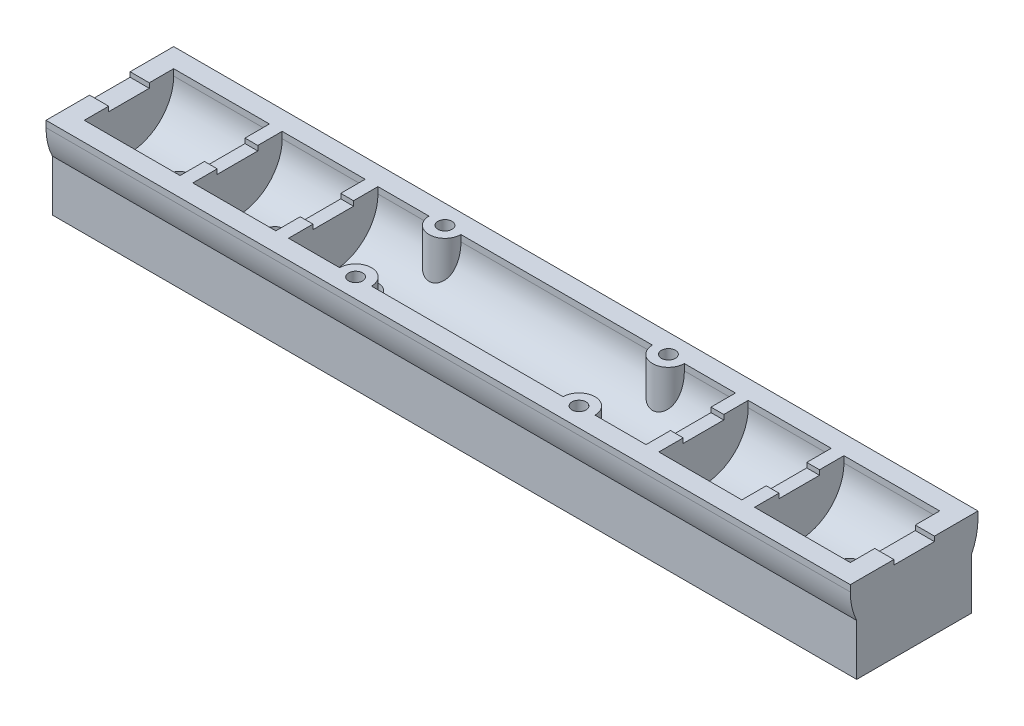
ISO-10303-21;
HEADER;
FILE_DESCRIPTION(('STEP AP214'),'2;1');
FILE_NAME('part.step','',(''),(''),'','','');
FILE_SCHEMA(('AUTOMOTIVE_DESIGN { 1 0 10303 214 1 1 1 1 }'));
ENDSEC;
DATA;
#1=APPLICATION_CONTEXT('core data for automotive mechanical design processes');
#2=APPLICATION_PROTOCOL_DEFINITION('international standard','automotive_design',2000,#1);
#3=PRODUCT_CONTEXT('',#1,'mechanical');
#4=PRODUCT('Part','Part','',(#3));
#5=PRODUCT_RELATED_PRODUCT_CATEGORY('part','',(#4));
#6=PRODUCT_DEFINITION_FORMATION('','',#4);
#7=PRODUCT_DEFINITION_CONTEXT('part definition',#1,'design');
#8=PRODUCT_DEFINITION('design','',#6,#7);
#9=PRODUCT_DEFINITION_SHAPE('','',#8);
#10=(LENGTH_UNIT() NAMED_UNIT(*) SI_UNIT(.MILLI.,.METRE.));
#11=(NAMED_UNIT(*) PLANE_ANGLE_UNIT() SI_UNIT($,.RADIAN.));
#12=(NAMED_UNIT(*) SI_UNIT($,.STERADIAN.) SOLID_ANGLE_UNIT());
#13=UNCERTAINTY_MEASURE_WITH_UNIT(LENGTH_MEASURE(1.E-05),#10,'distance_accuracy_value','');
#14=(GEOMETRIC_REPRESENTATION_CONTEXT(3) GLOBAL_UNCERTAINTY_ASSIGNED_CONTEXT((#13)) GLOBAL_UNIT_ASSIGNED_CONTEXT((#10,
#11,#12)) REPRESENTATION_CONTEXT('',''));
#15=CARTESIAN_POINT('',(0.,0.,0.));
#16=DIRECTION('',(0.,0.,1.));
#17=DIRECTION('',(1.,0.,0.));
#18=AXIS2_PLACEMENT_3D('',#15,#16,#17);
#19=CARTESIAN_POINT('',(0.,1.,0.));
#20=DIRECTION('',(0.,1.,0.));
#21=DIRECTION('',(0.,0.,1.));
#22=AXIS2_PLACEMENT_3D('',#19,#20,#21);
#23=PLANE('',#22);
#24=CARTESIAN_POINT('',(42.5,0.999999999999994,-7.));
#25=DIRECTION('',(0.,-1.,0.));
#26=DIRECTION('',(0.,0.,-1.));
#27=AXIS2_PLACEMENT_3D('',#24,#25,#26);
#28=CIRCLE('',#27,1.1);
#29=CARTESIAN_POINT('',(42.5,0.999999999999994,-8.1));
#30=VERTEX_POINT('',#29);
#31=EDGE_CURVE('E501',#30,#30,#28,.T.);
#32=ORIENTED_EDGE('',*,*,#31,.T.);
#33=EDGE_LOOP('',(#32));
#34=FACE_BOUND('',#33,.T.);
#35=DIRECTION('',(0.,0.,-1.));
#36=VECTOR('',#35,1.);
#37=CARTESIAN_POINT('',(120.,0.999999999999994,7.));
#38=LINE('',#37,#36);
#39=CARTESIAN_POINT('',(120.,1.,-3.175));
#40=VERTEX_POINT('',#39);
#41=CARTESIAN_POINT('',(120.,1.00000000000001,-7.));
#42=VERTEX_POINT('',#41);
#43=EDGE_CURVE('E847',#40,#42,#38,.T.);
#44=ORIENTED_EDGE('',*,*,#43,.F.);
#45=DIRECTION('',(1.,0.,0.));
#46=VECTOR('',#45,1.);
#47=CARTESIAN_POINT('',(-3.001,1.00000000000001,-3.175));
#48=LINE('',#47,#46);
#49=CARTESIAN_POINT('',(123.,1.00000000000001,-3.175));
#50=VERTEX_POINT('',#49);
#51=EDGE_CURVE('E585',#40,#50,#48,.T.);
#52=ORIENTED_EDGE('',*,*,#51,.T.);
#53=DIRECTION('',(0.,0.,-1.));
#54=VECTOR('',#53,1.);
#55=CARTESIAN_POINT('',(123.,0.999999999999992,10.));
#56=LINE('',#55,#54);
#57=CARTESIAN_POINT('',(123.,1.00000000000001,-10.));
#58=VERTEX_POINT('',#57);
#59=EDGE_CURVE('E864',#50,#58,#56,.T.);
#60=ORIENTED_EDGE('',*,*,#59,.T.);
#61=DIRECTION('',(-1.,0.,0.));
#62=VECTOR('',#61,1.);
#63=CARTESIAN_POINT('',(123.,1.00000000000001,-10.));
#64=LINE('',#63,#62);
#65=CARTESIAN_POINT('',(-3.,1.00000000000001,-10.));
#66=VERTEX_POINT('',#65);
#67=EDGE_CURVE('E854',#58,#66,#64,.T.);
#68=ORIENTED_EDGE('',*,*,#67,.T.);
#69=DIRECTION('',(0.,0.,1.));
#70=VECTOR('',#69,1.);
#71=CARTESIAN_POINT('',(-3.,1.00000000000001,-10.));
#72=LINE('',#71,#70);
#73=CARTESIAN_POINT('',(-3.,1.00000000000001,-3.175));
#74=VERTEX_POINT('',#73);
#75=EDGE_CURVE('E859',#66,#74,#72,.T.);
#76=ORIENTED_EDGE('',*,*,#75,.T.);
#77=DIRECTION('',(-1.,0.,0.));
#78=VECTOR('',#77,1.);
#79=CARTESIAN_POINT('',(123.001,1.00000000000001,-3.175));
#80=LINE('',#79,#78);
#81=CARTESIAN_POINT('',(0.,1.00000000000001,-3.175));
#82=VERTEX_POINT('',#81);
#83=EDGE_CURVE('E610',#82,#74,#80,.T.);
#84=ORIENTED_EDGE('',*,*,#83,.F.);
#85=DIRECTION('',(0.,0.,1.));
#86=VECTOR('',#85,1.);
#87=CARTESIAN_POINT('',(0.,1.00000000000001,-7.));
#88=LINE('',#87,#86);
#89=CARTESIAN_POINT('',(0.,1.00000000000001,-7.));
#90=VERTEX_POINT('',#89);
#91=EDGE_CURVE('E841',#90,#82,#88,.T.);
#92=ORIENTED_EDGE('',*,*,#91,.F.);
#93=DIRECTION('',(-1.,0.,0.));
#94=VECTOR('',#93,1.);
#95=CARTESIAN_POINT('',(120.,1.00000000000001,-7.));
#96=LINE('',#95,#94);
#97=CARTESIAN_POINT('',(15.,1.00000000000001,-7.));
#98=VERTEX_POINT('',#97);
#99=EDGE_CURVE('E840',#98,#90,#96,.T.);
#100=ORIENTED_EDGE('',*,*,#99,.F.);
#101=DIRECTION('',(0.,0.,1.));
#102=VECTOR('',#101,1.);
#103=CARTESIAN_POINT('',(15.,1.00000000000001,-9.));
#104=LINE('',#103,#102);
#105=CARTESIAN_POINT('',(15.,1.00000000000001,-3.175));
#106=VERTEX_POINT('',#105);
#107=EDGE_CURVE('E770',#98,#106,#104,.T.);
#108=ORIENTED_EDGE('',*,*,#107,.T.);
#109=DIRECTION('',(-1.,0.,0.));
#110=VECTOR('',#109,1.);
#111=CARTESIAN_POINT('',(17.,1.00000000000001,-3.175));
#112=LINE('',#111,#110);
#113=CARTESIAN_POINT('',(17.,1.00000000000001,-3.175));
#114=VERTEX_POINT('',#113);
#115=EDGE_CURVE('E801',#114,#106,#112,.T.);
#116=ORIENTED_EDGE('',*,*,#115,.F.);
#117=DIRECTION('',(0.,0.,1.));
#118=VECTOR('',#117,1.);
#119=CARTESIAN_POINT('',(17.,1.00000000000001,-9.));
#120=LINE('',#119,#118);
#121=CARTESIAN_POINT('',(17.,1.00000000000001,-7.));
#122=VERTEX_POINT('',#121);
#123=EDGE_CURVE('E771',#122,#114,#120,.T.);
#124=ORIENTED_EDGE('',*,*,#123,.F.);
#125=CARTESIAN_POINT('',(30.,1.00000000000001,-7.));
#126=VERTEX_POINT('',#125);
#127=EDGE_CURVE('E980',#126,#122,#96,.T.);
#128=ORIENTED_EDGE('',*,*,#127,.F.);
#129=DIRECTION('',(0.,0.,1.));
#130=VECTOR('',#129,1.);
#131=CARTESIAN_POINT('',(30.,1.00000000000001,-9.));
#132=LINE('',#131,#130);
#133=CARTESIAN_POINT('',(30.,1.00000000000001,-3.175));
#134=VERTEX_POINT('',#133);
#135=EDGE_CURVE('E719',#126,#134,#132,.T.);
#136=ORIENTED_EDGE('',*,*,#135,.T.);
#137=DIRECTION('',(-1.,0.,0.));
#138=VECTOR('',#137,1.);
#139=CARTESIAN_POINT('',(32.,1.00000000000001,-3.175));
#140=LINE('',#139,#138);
#141=CARTESIAN_POINT('',(32.,1.00000000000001,-3.175));
#142=VERTEX_POINT('',#141);
#143=EDGE_CURVE('E750',#142,#134,#140,.T.);
#144=ORIENTED_EDGE('',*,*,#143,.F.);
#145=DIRECTION('',(0.,0.,1.));
#146=VECTOR('',#145,1.);
#147=CARTESIAN_POINT('',(32.,1.00000000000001,-9.));
#148=LINE('',#147,#146);
#149=CARTESIAN_POINT('',(32.,1.00000000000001,-7.));
#150=VERTEX_POINT('',#149);
#151=EDGE_CURVE('E720',#150,#142,#148,.T.);
#152=ORIENTED_EDGE('',*,*,#151,.F.);
#153=CARTESIAN_POINT('',(40.,0.999999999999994,-7.));
#154=VERTEX_POINT('',#153);
#155=EDGE_CURVE('E979',#154,#150,#96,.T.);
#156=ORIENTED_EDGE('',*,*,#155,.F.);
#157=CARTESIAN_POINT('',(42.5,0.999999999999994,-7.));
#158=DIRECTION('',(0.,-1.,0.));
#159=DIRECTION('',(0.,0.,1.));
#160=AXIS2_PLACEMENT_3D('',#157,#158,#159);
#161=CIRCLE('',#160,2.5);
#162=CARTESIAN_POINT('',(45.,0.999999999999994,-7.));
#163=VERTEX_POINT('',#162);
#164=EDGE_CURVE('E517',#163,#154,#161,.T.);
#165=ORIENTED_EDGE('',*,*,#164,.F.);
#166=CARTESIAN_POINT('',(75.,0.999999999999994,-7.));
#167=VERTEX_POINT('',#166);
#168=EDGE_CURVE('E839',#167,#163,#96,.T.);
#169=ORIENTED_EDGE('',*,*,#168,.F.);
#170=CARTESIAN_POINT('',(77.5,0.999999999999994,-7.));
#171=DIRECTION('',(0.,-1.,0.));
#172=DIRECTION('',(0.,0.,1.));
#173=AXIS2_PLACEMENT_3D('',#170,#171,#172);
#174=CIRCLE('',#173,2.5);
#175=CARTESIAN_POINT('',(80.,0.999999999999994,-7.));
#176=VERTEX_POINT('',#175);
#177=EDGE_CURVE('E429',#176,#167,#174,.T.);
#178=ORIENTED_EDGE('',*,*,#177,.F.);
#179=CARTESIAN_POINT('',(88.,1.00000000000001,-7.));
#180=VERTEX_POINT('',#179);
#181=EDGE_CURVE('E428',#180,#176,#96,.T.);
#182=ORIENTED_EDGE('',*,*,#181,.F.);
#183=DIRECTION('',(0.,0.,1.));
#184=VECTOR('',#183,1.);
#185=CARTESIAN_POINT('',(88.,1.00000000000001,-9.));
#186=LINE('',#185,#184);
#187=CARTESIAN_POINT('',(88.,1.00000000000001,-3.175));
#188=VERTEX_POINT('',#187);
#189=EDGE_CURVE('E619',#180,#188,#186,.T.);
#190=ORIENTED_EDGE('',*,*,#189,.T.);
#191=DIRECTION('',(1.,0.,0.));
#192=VECTOR('',#191,1.);
#193=CARTESIAN_POINT('',(88.,1.00000000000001,-3.175));
#194=LINE('',#193,#192);
#195=CARTESIAN_POINT('',(90.,1.00000000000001,-3.175));
#196=VERTEX_POINT('',#195);
#197=EDGE_CURVE('E634',#188,#196,#194,.T.);
#198=ORIENTED_EDGE('',*,*,#197,.T.);
#199=DIRECTION('',(0.,0.,1.));
#200=VECTOR('',#199,1.);
#201=CARTESIAN_POINT('',(90.,1.00000000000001,-9.));
#202=LINE('',#201,#200);
#203=CARTESIAN_POINT('',(90.,1.00000000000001,-7.));
#204=VERTEX_POINT('',#203);
#205=EDGE_CURVE('E618',#204,#196,#202,.T.);
#206=ORIENTED_EDGE('',*,*,#205,.F.);
#207=CARTESIAN_POINT('',(103.,1.00000000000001,-7.));
#208=VERTEX_POINT('',#207);
#209=EDGE_CURVE('E838',#208,#204,#96,.T.);
#210=ORIENTED_EDGE('',*,*,#209,.F.);
#211=DIRECTION('',(0.,0.,1.));
#212=VECTOR('',#211,1.);
#213=CARTESIAN_POINT('',(103.,1.00000000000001,-9.));
#214=LINE('',#213,#212);
#215=CARTESIAN_POINT('',(103.,1.00000000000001,-3.175));
#216=VERTEX_POINT('',#215);
#217=EDGE_CURVE('E668',#208,#216,#214,.T.);
#218=ORIENTED_EDGE('',*,*,#217,.T.);
#219=DIRECTION('',(1.,0.,0.));
#220=VECTOR('',#219,1.);
#221=CARTESIAN_POINT('',(103.,1.00000000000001,-3.175));
#222=LINE('',#221,#220);
#223=CARTESIAN_POINT('',(105.,1.00000000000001,-3.175));
#224=VERTEX_POINT('',#223);
#225=EDGE_CURVE('E683',#216,#224,#222,.T.);
#226=ORIENTED_EDGE('',*,*,#225,.T.);
#227=DIRECTION('',(0.,0.,1.));
#228=VECTOR('',#227,1.);
#229=CARTESIAN_POINT('',(105.,1.00000000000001,-9.));
#230=LINE('',#229,#228);
#231=CARTESIAN_POINT('',(105.,1.00000000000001,-7.));
#232=VERTEX_POINT('',#231);
#233=EDGE_CURVE('E667',#232,#224,#230,.T.);
#234=ORIENTED_EDGE('',*,*,#233,.F.);
#235=EDGE_CURVE('E835',#42,#232,#96,.T.);
#236=ORIENTED_EDGE('',*,*,#235,.F.);
#237=EDGE_LOOP('',(#44,#52,#60,#68,#76,#84,#92,#100,#108,#116,#124,#128,#136,#144,#152,#156,
#165,#169,#178,#182,#190,#198,#206,#210,#218,#226,#234,#236));
#238=FACE_BOUND('',#237,.T.);
#239=CARTESIAN_POINT('',(77.5,0.999999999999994,-7.));
#240=DIRECTION('',(0.,-1.,0.));
#241=DIRECTION('',(0.,0.,-1.));
#242=AXIS2_PLACEMENT_3D('',#239,#240,#241);
#243=CIRCLE('',#242,1.1);
#244=CARTESIAN_POINT('',(77.5,0.999999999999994,-8.1));
#245=VERTEX_POINT('',#244);
#246=EDGE_CURVE('E1990',#245,#245,#243,.T.);
#247=ORIENTED_EDGE('',*,*,#246,.T.);
#248=EDGE_LOOP('',(#247));
#249=FACE_BOUND('',#248,.T.);
#250=ADVANCED_FACE('F34',(#34,#238,#249),#23,.T.);
#251=CARTESIAN_POINT('',(120.,1.00000000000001,-7.));
#252=DIRECTION('',(0.,0.,1.));
#253=DIRECTION('',(0.,-1.,0.));
#254=AXIS2_PLACEMENT_3D('',#251,#252,#253);
#255=PLANE('',#254);
#256=ORIENTED_EDGE('',*,*,#181,.T.);
#257=DIRECTION('',(0.,1.,0.));
#258=VECTOR('',#257,1.);
#259=CARTESIAN_POINT('',(80.,-12.3598989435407,-6.99999999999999));
#260=LINE('',#259,#258);
#261=CARTESIAN_POINT('',(80.,0.,-7.));
#262=VERTEX_POINT('',#261);
#263=EDGE_CURVE('E415',#262,#176,#260,.T.);
#264=ORIENTED_EDGE('',*,*,#263,.F.);
#265=DIRECTION('',(-1.,0.,0.));
#266=VECTOR('',#265,1.);
#267=CARTESIAN_POINT('',(120.,0.,-7.));
#268=LINE('',#267,#266);
#269=CARTESIAN_POINT('',(88.,0.,-7.));
#270=VERTEX_POINT('',#269);
#271=EDGE_CURVE('E425',#270,#262,#268,.T.);
#272=ORIENTED_EDGE('',*,*,#271,.F.);
#273=DIRECTION('',(0.,1.,0.));
#274=VECTOR('',#273,1.);
#275=CARTESIAN_POINT('',(88.,1.00000000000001,-7.));
#276=LINE('',#275,#274);
#277=EDGE_CURVE('E665',#270,#180,#276,.T.);
#278=ORIENTED_EDGE('',*,*,#277,.T.);
#279=EDGE_LOOP('',(#256,#264,#272,#278));
#280=FACE_BOUND('',#279,.T.);
#281=ADVANCED_FACE('F424',(#280),#255,.T.);
#282=CARTESIAN_POINT('',(75.,0.,-7.));
#283=VERTEX_POINT('',#282);
#284=CARTESIAN_POINT('',(45.,0.,-7.));
#285=VERTEX_POINT('',#284);
#286=EDGE_CURVE('E39',#283,#285,#268,.T.);
#287=ORIENTED_EDGE('',*,*,#286,.F.);
#288=DIRECTION('',(0.,1.,0.));
#289=VECTOR('',#288,1.);
#290=CARTESIAN_POINT('',(75.,-12.3598989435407,-6.99999999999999));
#291=LINE('',#290,#289);
#292=EDGE_CURVE('E53',#283,#167,#291,.T.);
#293=ORIENTED_EDGE('',*,*,#292,.T.);
#294=ORIENTED_EDGE('',*,*,#168,.T.);
#295=DIRECTION('',(0.,1.,0.));
#296=VECTOR('',#295,1.);
#297=CARTESIAN_POINT('',(45.,-12.3598989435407,-6.99999999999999));
#298=LINE('',#297,#296);
#299=EDGE_CURVE('E520',#285,#163,#298,.T.);
#300=ORIENTED_EDGE('',*,*,#299,.F.);
#301=EDGE_LOOP('',(#287,#293,#294,#300));
#302=FACE_BOUND('',#301,.T.);
#303=ADVANCED_FACE('F1230',(#302),#255,.T.);
#304=CARTESIAN_POINT('',(120.,0.,0.));
#305=DIRECTION('',(-1.,0.,0.));
#306=DIRECTION('',(0.,0.,1.));
#307=AXIS2_PLACEMENT_3D('',#304,#305,#306);
#308=CYLINDRICAL_SURFACE('',#307,7.);
#309=CARTESIAN_POINT('',(37.5,-6.79043444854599,-1.7));
#310=CARTESIAN_POINT('',(37.4060336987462,-6.79043628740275,-1.69999718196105));
#311=CARTESIAN_POINT('',(37.3120356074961,-6.79240620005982,-1.6921825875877));
#312=CARTESIAN_POINT('',(37.1267324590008,-6.80005425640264,-1.6611767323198));
#313=CARTESIAN_POINT('',(37.0354290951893,-6.80573468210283,-1.6379760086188));
#314=CARTESIAN_POINT('',(36.8582224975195,-6.82012333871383,-1.5769879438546));
#315=CARTESIAN_POINT('',(36.7723126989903,-6.82882780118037,-1.539218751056));
#316=CARTESIAN_POINT('',(36.6080412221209,-6.84827910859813,-1.45022042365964));
#317=CARTESIAN_POINT('',(36.5296797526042,-6.8590260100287,-1.39899091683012));
#318=CARTESIAN_POINT('',(36.3811010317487,-6.88160115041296,-1.2833897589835));
#319=CARTESIAN_POINT('',(36.3110636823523,-6.89344586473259,-1.21879005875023));
#320=CARTESIAN_POINT('',(36.1827039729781,-6.91673880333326,-1.07877374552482));
#321=CARTESIAN_POINT('',(36.1243826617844,-6.9281869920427,-1.00335616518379));
#322=CARTESIAN_POINT('',(36.0203803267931,-6.94957859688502,-0.842618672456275));
#323=CARTESIAN_POINT('',(35.974875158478,-6.95950030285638,-0.757181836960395));
#324=CARTESIAN_POINT('',(35.8989388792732,-6.976533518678,-0.579590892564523));
#325=CARTESIAN_POINT('',(35.8685056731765,-6.98364541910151,-0.487437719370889));
#326=CARTESIAN_POINT('',(35.8241509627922,-6.99414124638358,-0.300904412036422));
#327=CARTESIAN_POINT('',(35.8099241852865,-6.99759400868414,-0.206600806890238));
#328=CARTESIAN_POINT('',(35.797428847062,-7.000622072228,-0.0168864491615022));
#329=CARTESIAN_POINT('',(35.79915805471,-7.00019791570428,0.0785241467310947));
#330=CARTESIAN_POINT('',(35.8183041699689,-6.9955715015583,0.265629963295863));
#331=CARTESIAN_POINT('',(35.835391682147,-6.99144857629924,0.357361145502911));
#332=CARTESIAN_POINT('',(35.8842409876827,-6.97997976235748,0.536613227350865));
#333=CARTESIAN_POINT('',(35.9160035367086,-6.97263370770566,0.624133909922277));
#334=CARTESIAN_POINT('',(35.9935736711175,-6.95542118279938,0.793359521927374));
#335=CARTESIAN_POINT('',(36.0395002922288,-6.94553347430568,0.875007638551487));
#336=CARTESIAN_POINT('',(36.1440049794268,-6.92431304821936,1.02955463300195));
#337=CARTESIAN_POINT('',(36.2025851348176,-6.91298009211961,1.10245206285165));
#338=CARTESIAN_POINT('',(36.3325065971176,-6.88976494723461,1.2393918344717));
#339=CARTESIAN_POINT('',(36.4041358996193,-6.8778761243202,1.30316009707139));
#340=CARTESIAN_POINT('',(36.5571960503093,-6.85515585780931,1.41783835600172));
#341=CARTESIAN_POINT('',(36.638627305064,-6.8443244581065,1.46874781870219));
#342=CARTESIAN_POINT('',(36.8094945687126,-6.82492298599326,1.5564256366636));
#343=CARTESIAN_POINT('',(36.8989638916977,-6.81636296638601,1.59313144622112));
#344=CARTESIAN_POINT('',(37.0830606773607,-6.80260446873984,1.65089784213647));
#345=CARTESIAN_POINT('',(37.1776871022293,-6.79740531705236,1.67196156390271));
#346=CARTESIAN_POINT('',(37.3668791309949,-6.79109769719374,1.69739829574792));
#347=CARTESIAN_POINT('',(37.4613872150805,-6.78989029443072,1.70217506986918));
#348=CARTESIAN_POINT('',(37.6498498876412,-6.79143415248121,1.69600478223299));
#349=CARTESIAN_POINT('',(37.7438045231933,-6.79418507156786,1.68505907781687));
#350=CARTESIAN_POINT('',(37.9270166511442,-6.80324113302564,1.6481077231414));
#351=CARTESIAN_POINT('',(38.0163239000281,-6.80949148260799,1.62233407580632));
#352=CARTESIAN_POINT('',(38.1893509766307,-6.82479074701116,1.55671422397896));
#353=CARTESIAN_POINT('',(38.2730701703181,-6.83383997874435,1.51686642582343));
#354=CARTESIAN_POINT('',(38.4342641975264,-6.85392785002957,1.42337375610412));
#355=CARTESIAN_POINT('',(38.5115936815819,-6.86500040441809,1.36948572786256));
#356=CARTESIAN_POINT('',(38.6562606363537,-6.88780266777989,1.2497522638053));
#357=CARTESIAN_POINT('',(38.72359655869,-6.89953247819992,1.18390497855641));
#358=CARTESIAN_POINT('',(38.8479840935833,-6.92266071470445,1.04027525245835));
#359=CARTESIAN_POINT('',(38.9047573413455,-6.93404490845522,0.962249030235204));
#360=CARTESIAN_POINT('',(39.0043937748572,-6.95491330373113,0.79753498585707));
#361=CARTESIAN_POINT('',(39.0472576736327,-6.96439760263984,0.710847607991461));
#362=CARTESIAN_POINT('',(39.1174973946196,-6.98033884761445,0.531861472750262));
#363=CARTESIAN_POINT('',(39.1449821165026,-6.98681702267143,0.4396074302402));
#364=CARTESIAN_POINT('',(39.1840138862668,-6.9961087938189,0.251612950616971));
#365=CARTESIAN_POINT('',(39.1955638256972,-6.99892305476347,0.155873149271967));
#366=CARTESIAN_POINT('',(39.202243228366,-7.00054453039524,-0.0337537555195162));
#367=CARTESIAN_POINT('',(39.1977845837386,-6.99945226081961,-0.12762571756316));
#368=CARTESIAN_POINT('',(39.1735115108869,-6.99360449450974,-0.313240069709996));
#369=CARTESIAN_POINT('',(39.1536974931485,-6.98884909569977,-0.404982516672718));
#370=CARTESIAN_POINT('',(39.0994917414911,-6.97622305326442,-0.583329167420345));
#371=CARTESIAN_POINT('',(39.0651706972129,-6.96836752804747,-0.669955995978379));
#372=CARTESIAN_POINT('',(38.982990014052,-6.95037105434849,-0.836269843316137));
#373=CARTESIAN_POINT('',(38.9351287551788,-6.94022983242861,-0.915956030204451));
#374=CARTESIAN_POINT('',(38.8259492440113,-6.91846962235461,-1.06809355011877));
#375=CARTESIAN_POINT('',(38.7643490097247,-6.90682220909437,-1.14033846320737));
#376=CARTESIAN_POINT('',(38.6299928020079,-6.88349586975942,-1.27360587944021));
#377=CARTESIAN_POINT('',(38.5572340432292,-6.87181693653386,-1.3346255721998));
#378=CARTESIAN_POINT('',(38.4011074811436,-6.84952046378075,-1.44474507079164));
#379=CARTESIAN_POINT('',(38.3175775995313,-6.83892483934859,-1.49361984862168));
#380=CARTESIAN_POINT('',(38.143243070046,-6.82028439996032,-1.5765597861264));
#381=CARTESIAN_POINT('',(38.0524439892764,-6.81223765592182,-1.61063615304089));
#382=CARTESIAN_POINT('',(37.884782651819,-6.80091987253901,-1.65769279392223));
#383=CARTESIAN_POINT('',(37.8087507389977,-6.79701655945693,-1.67352445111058));
#384=CARTESIAN_POINT('',(37.6551530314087,-6.79177318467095,-1.69467882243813));
#385=CARTESIAN_POINT('',(37.5775873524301,-6.79043293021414,-1.70000232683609));
#386=CARTESIAN_POINT('',(37.5,-6.79043444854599,-1.7));
#387=B_SPLINE_CURVE_WITH_KNOTS('',3,(#309,#310,#311,#312,#313,#314,#315,#316,#317,#318,#319,
#320,#321,#322,#323,#324,#325,#326,#327,#328,#329,#330,#331,#332,#333,#334,#335,#336,#337,#338,
#339,#340,#341,#342,#343,#344,#345,#346,#347,#348,#349,#350,#351,#352,#353,#354,#355,#356,#357,
#358,#359,#360,#361,#362,#363,#364,#365,#366,#367,#368,#369,#370,#371,#372,#373,#374,#375,#376,
#377,#378,#379,#380,#381,#382,#383,#384,#385,#386),.UNSPECIFIED.,.T.,.F.,(4,2,2,2,2,2,2,2,2,2,2,
2,2,2,2,2,2,2,2,2,2,2,2,2,2,2,2,2,2,2,2,2,2,2,2,2,2,2,4),(0.,0.281614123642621,
0.563401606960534,0.844839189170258,1.12628455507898,1.41299810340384,1.69973730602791,
1.99023803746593,2.28069837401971,2.56559195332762,2.85044568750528,3.12933211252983,
3.40823289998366,3.68954458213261,3.97090274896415,4.25945507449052,4.54801937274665,
4.83784028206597,5.12760308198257,5.41012809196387,5.69262871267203,5.97082499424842,
6.24905278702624,6.53246277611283,6.81591663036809,7.10602105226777,7.39611060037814,
7.6841191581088,7.9720754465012,8.25267647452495,8.53327000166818,8.81251173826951,
9.09178689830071,9.37743059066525,9.66314570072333,9.95381490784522,10.2442635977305,
10.4768080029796,10.7093349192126),.UNSPECIFIED.);
#388=CARTESIAN_POINT('',(37.5,-6.79043444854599,-1.7));
#389=VERTEX_POINT('',#388);
#390=EDGE_CURVE('E818',#389,#389,#387,.T.);
#391=ORIENTED_EDGE('',*,*,#390,.F.);
#392=EDGE_LOOP('',(#391));
#393=FACE_BOUND('',#392,.T.);
#394=ORIENTED_EDGE('',*,*,#271,.T.);
#395=CARTESIAN_POINT('',(75.,0.,-7.));
#396=CARTESIAN_POINT('',(75.0000106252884,-0.097829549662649,-7.00000115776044));
#397=CARTESIAN_POINT('',(75.0000002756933,-0.195658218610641,-6.99794915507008));
#398=CARTESIAN_POINT('',(75.0000148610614,-0.391144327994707,-6.98974768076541));
#399=CARTESIAN_POINT('',(75.000039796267,-0.488801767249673,-6.983598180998));
#400=CARTESIAN_POINT('',(75.00020224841,-0.683847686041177,-6.96720442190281));
#401=CARTESIAN_POINT('',(75.000339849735,-0.781235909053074,-6.95695709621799));
#402=CARTESIAN_POINT('',(75.0008847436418,-0.975489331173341,-6.93238833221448));
#403=CARTESIAN_POINT('',(75.0012920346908,-1.072354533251,-6.91806691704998));
#404=CARTESIAN_POINT('',(75.0032245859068,-1.36356935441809,-6.86874445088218));
#405=CARTESIAN_POINT('',(75.0054654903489,-1.55689932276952,-6.82752254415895));
#406=CARTESIAN_POINT('',(75.014247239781,-1.93920253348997,-6.72892506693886));
#407=CARTESIAN_POINT('',(75.0207857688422,-2.12817806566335,-6.67155820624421));
#408=CARTESIAN_POINT('',(75.0382091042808,-2.44002360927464,-6.56232215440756));
#409=CARTESIAN_POINT('',(75.0470034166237,-2.56450072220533,-6.51467878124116));
#410=CARTESIAN_POINT('',(75.0694402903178,-2.81018402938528,-6.41253142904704));
#411=CARTESIAN_POINT('',(75.0830828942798,-2.93139019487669,-6.35802738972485));
#412=CARTESIAN_POINT('',(75.1166794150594,-3.16938494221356,-6.24278778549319));
#413=CARTESIAN_POINT('',(75.1366100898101,-3.28618804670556,-6.18207571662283));
#414=CARTESIAN_POINT('',(75.1845011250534,-3.51488952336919,-6.05497228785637));
#415=CARTESIAN_POINT('',(75.2124581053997,-3.62678993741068,-5.98858332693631));
#416=CARTESIAN_POINT('',(75.2896812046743,-3.88216889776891,-5.82739769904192));
#417=CARTESIAN_POINT('',(75.3429673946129,-4.02331064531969,-5.73066896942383));
#418=CARTESIAN_POINT('',(75.4399618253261,-4.22425130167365,-5.58235564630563));
#419=CARTESIAN_POINT('',(75.4751323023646,-4.28942909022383,-5.53238729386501));
#420=CARTESIAN_POINT('',(75.5517329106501,-4.41571433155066,-5.43212263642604));
#421=CARTESIAN_POINT('',(75.5931614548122,-4.47682281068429,-5.38182641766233));
#422=CARTESIAN_POINT('',(75.7077096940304,-4.62710612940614,-5.25397522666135));
#423=CARTESIAN_POINT('',(75.78565338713,-4.71302495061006,-5.17679125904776));
#424=CARTESIAN_POINT('',(75.9589239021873,-4.87125945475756,-5.02818264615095));
#425=CARTESIAN_POINT('',(76.0542324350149,-4.943589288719,-4.95675205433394));
#426=CARTESIAN_POINT('',(76.246151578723,-5.06285295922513,-4.83463656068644));
#427=CARTESIAN_POINT('',(76.3404415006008,-5.111966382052,-4.78244658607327));
#428=CARTESIAN_POINT('',(76.5396831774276,-5.19765107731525,-4.68918410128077));
#429=CARTESIAN_POINT('',(76.6446321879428,-5.23422556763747,-4.64810873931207));
#430=CARTESIAN_POINT('',(76.8630612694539,-5.29411818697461,-4.57978256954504));
#431=CARTESIAN_POINT('',(76.976574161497,-5.31738204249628,-4.5525884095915));
#432=CARTESIAN_POINT('',(77.2082459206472,-5.34992012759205,-4.51431097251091));
#433=CARTESIAN_POINT('',(77.3264038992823,-5.35919701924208,-4.50322462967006));
#434=CARTESIAN_POINT('',(77.5543404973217,-5.36342102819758,-4.49818994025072));
#435=CARTESIAN_POINT('',(77.6640756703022,-5.35940064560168,-4.50300670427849));
#436=CARTESIAN_POINT('',(77.8808540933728,-5.33933802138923,-4.52677684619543));
#437=CARTESIAN_POINT('',(77.9878979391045,-5.32329846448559,-4.54572706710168));
#438=CARTESIAN_POINT('',(78.1952761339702,-5.27970659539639,-4.59627950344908));
#439=CARTESIAN_POINT('',(78.2956675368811,-5.2522727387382,-4.62775140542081));
#440=CARTESIAN_POINT('',(78.4885590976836,-5.18642221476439,-4.70143118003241));
#441=CARTESIAN_POINT('',(78.5810583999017,-5.14800435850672,-4.74364021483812));
#442=CARTESIAN_POINT('',(78.7618191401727,-5.05829021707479,-4.83923842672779));
#443=CARTESIAN_POINT('',(78.849484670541,-5.00635490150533,-4.89314987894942));
#444=CARTESIAN_POINT('',(79.0130633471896,-4.89212494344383,-5.00736004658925));
#445=CARTESIAN_POINT('',(79.0889702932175,-4.8298248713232,-5.06766210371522));
#446=CARTESIAN_POINT('',(79.2595271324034,-4.66686310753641,-5.21895229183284));
#447=CARTESIAN_POINT('',(79.3478621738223,-4.56133803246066,-5.31182995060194));
#448=CARTESIAN_POINT('',(79.5021082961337,-4.33525770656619,-5.49791493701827));
#449=CARTESIAN_POINT('',(79.5679757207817,-4.21467380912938,-5.59112255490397));
#450=CARTESIAN_POINT('',(79.6655917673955,-3.99600438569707,-5.74847467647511));
#451=CARTESIAN_POINT('',(79.7017522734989,-3.90058722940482,-5.81369511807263));
#452=CARTESIAN_POINT('',(79.7655101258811,-3.70457651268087,-5.94051623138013));
#453=CARTESIAN_POINT('',(79.7931033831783,-3.60398050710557,-6.00211516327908));
#454=CARTESIAN_POINT('',(79.8412190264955,-3.39833328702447,-6.12090432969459));
#455=CARTESIAN_POINT('',(79.8617268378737,-3.29327338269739,-6.1780852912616));
#456=CARTESIAN_POINT('',(79.8969576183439,-3.07957482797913,-6.2873391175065));
#457=CARTESIAN_POINT('',(79.9116787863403,-2.97093507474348,-6.33941038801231));
#458=CARTESIAN_POINT('',(79.9427287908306,-2.69600599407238,-6.46251713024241));
#459=CARTESIAN_POINT('',(79.9562303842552,-2.52786118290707,-6.53014092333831));
#460=CARTESIAN_POINT('',(79.9764683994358,-2.18642975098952,-6.65225115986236));
#461=CARTESIAN_POINT('',(79.9832010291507,-2.01314030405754,-6.70673022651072));
#462=CARTESIAN_POINT('',(79.9926099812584,-1.66287312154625,-6.80204193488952));
#463=CARTESIAN_POINT('',(79.9952888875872,-1.48589780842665,-6.84288325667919));
#464=CARTESIAN_POINT('',(79.9986339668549,-1.12938241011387,-6.91067298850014));
#465=CARTESIAN_POINT('',(79.9993012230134,-0.949843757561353,-6.93762886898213));
#466=CARTESIAN_POINT('',(79.9998801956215,-0.641655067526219,-6.9717171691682));
#467=CARTESIAN_POINT('',(79.9999551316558,-0.513379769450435,-6.98233400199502));
#468=CARTESIAN_POINT('',(79.9999999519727,-0.256739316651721,-6.99646840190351));
#469=CARTESIAN_POINT('',(79.9999700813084,-0.128375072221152,-7.00000249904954));
#470=CARTESIAN_POINT('',(80.,0.,-7.));
#471=B_SPLINE_CURVE_WITH_KNOTS('',3,(#395,#396,#397,#398,#399,#400,#401,#402,#403,#404,#405,
#406,#407,#408,#409,#410,#411,#412,#413,#414,#415,#416,#417,#418,#419,#420,#421,#422,#423,#424,
#425,#426,#427,#428,#429,#430,#431,#432,#433,#434,#435,#436,#437,#438,#439,#440,#441,#442,#443,
#444,#445,#446,#447,#448,#449,#450,#451,#452,#453,#454,#455,#456,#457,#458,#459,#460,#461,#462,
#463,#464,#465,#466,#467,#468,#469,#470),.UNSPECIFIED.,.F.,.F.,(4,2,2,2,2,2,2,2,2,2,2,2,2,2,2,2,
2,2,2,2,2,2,2,2,2,2,2,2,2,2,2,2,2,2,2,2,2,4),(0.,0.293465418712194,0.586932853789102,
0.880620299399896,1.17430607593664,1.76659559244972,2.35856619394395,2.75902039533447,
3.15947811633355,3.55847266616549,3.95729943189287,4.49295136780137,4.76071373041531,
5.02840830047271,5.44474004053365,5.86063579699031,6.21441296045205,6.56809926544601,
6.92321761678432,7.2782683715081,7.60641713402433,7.9344926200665,8.25923956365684,
8.5840216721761,8.92847300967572,9.27310536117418,9.76841186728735,10.2646753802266,
10.6275042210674,10.9905059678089,11.354250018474,11.7181071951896,12.2625216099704,
12.8072408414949,13.3516127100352,13.8956913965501,14.2816483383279,14.6667034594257),.UNSPECIFIED.);
#472=EDGE_CURVE('E412',#283,#262,#471,.T.);
#473=ORIENTED_EDGE('',*,*,#472,.F.);
#474=ORIENTED_EDGE('',*,*,#286,.T.);
#475=CARTESIAN_POINT('',(40.,0.,-7.));
#476=CARTESIAN_POINT('',(40.0000106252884,-0.0978295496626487,-7.00000115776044));
#477=CARTESIAN_POINT('',(40.0000002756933,-0.19565821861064,-6.99794915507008));
#478=CARTESIAN_POINT('',(40.0000148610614,-0.391144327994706,-6.98974768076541));
#479=CARTESIAN_POINT('',(40.000039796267,-0.488801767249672,-6.983598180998));
#480=CARTESIAN_POINT('',(40.00020224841,-0.683847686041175,-6.96720442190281));
#481=CARTESIAN_POINT('',(40.000339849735,-0.781235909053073,-6.95695709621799));
#482=CARTESIAN_POINT('',(40.0008847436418,-0.975489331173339,-6.93238833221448));
#483=CARTESIAN_POINT('',(40.0012920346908,-1.07235453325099,-6.91806691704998));
#484=CARTESIAN_POINT('',(40.0032245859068,-1.36356935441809,-6.86874445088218));
#485=CARTESIAN_POINT('',(40.0054654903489,-1.55689932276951,-6.82752254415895));
#486=CARTESIAN_POINT('',(40.014247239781,-1.93920253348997,-6.72892506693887));
#487=CARTESIAN_POINT('',(40.0207857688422,-2.12817806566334,-6.67155820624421));
#488=CARTESIAN_POINT('',(40.0382091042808,-2.44002360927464,-6.56232215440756));
#489=CARTESIAN_POINT('',(40.0470034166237,-2.56450072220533,-6.51467878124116));
#490=CARTESIAN_POINT('',(40.0694402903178,-2.81018402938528,-6.41253142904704));
#491=CARTESIAN_POINT('',(40.0830828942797,-2.93139019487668,-6.35802738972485));
#492=CARTESIAN_POINT('',(40.1166794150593,-3.16938494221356,-6.24278778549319));
#493=CARTESIAN_POINT('',(40.1366100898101,-3.28618804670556,-6.18207571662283));
#494=CARTESIAN_POINT('',(40.1845011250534,-3.51488952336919,-6.05497228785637));
#495=CARTESIAN_POINT('',(40.2124581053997,-3.62678993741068,-5.98858332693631));
#496=CARTESIAN_POINT('',(40.2896812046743,-3.8821688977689,-5.82739769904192));
#497=CARTESIAN_POINT('',(40.3429673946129,-4.02331064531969,-5.73066896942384));
#498=CARTESIAN_POINT('',(40.4399618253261,-4.22425130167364,-5.58235564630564));
#499=CARTESIAN_POINT('',(40.4751323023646,-4.28942909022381,-5.53238729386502));
#500=CARTESIAN_POINT('',(40.5517329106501,-4.41571433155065,-5.43212263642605));
#501=CARTESIAN_POINT('',(40.5931614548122,-4.47682281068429,-5.38182641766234));
#502=CARTESIAN_POINT('',(40.7077096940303,-4.62710612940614,-5.25397522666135));
#503=CARTESIAN_POINT('',(40.78565338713,-4.71302495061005,-5.17679125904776));
#504=CARTESIAN_POINT('',(40.9589239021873,-4.87125945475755,-5.02818264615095));
#505=CARTESIAN_POINT('',(41.0542324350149,-4.94358928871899,-4.95675205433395));
#506=CARTESIAN_POINT('',(41.246151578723,-5.06285295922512,-4.83463656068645));
#507=CARTESIAN_POINT('',(41.3404415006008,-5.11196638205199,-4.78244658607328));
#508=CARTESIAN_POINT('',(41.5396831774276,-5.19765107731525,-4.68918410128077));
#509=CARTESIAN_POINT('',(41.6446321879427,-5.23422556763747,-4.64810873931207));
#510=CARTESIAN_POINT('',(41.8630612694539,-5.29411818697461,-4.57978256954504));
#511=CARTESIAN_POINT('',(41.9765741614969,-5.31738204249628,-4.5525884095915));
#512=CARTESIAN_POINT('',(42.2082459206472,-5.34992012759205,-4.51431097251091));
#513=CARTESIAN_POINT('',(42.3264038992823,-5.35919701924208,-4.50322462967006));
#514=CARTESIAN_POINT('',(42.5543404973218,-5.36342102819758,-4.49818994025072));
#515=CARTESIAN_POINT('',(42.6640756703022,-5.35940064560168,-4.50300670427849));
#516=CARTESIAN_POINT('',(42.8808540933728,-5.33933802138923,-4.52677684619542));
#517=CARTESIAN_POINT('',(42.9878979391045,-5.3232984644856,-4.54572706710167));
#518=CARTESIAN_POINT('',(43.1952761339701,-5.2797065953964,-4.59627950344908));
#519=CARTESIAN_POINT('',(43.2956675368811,-5.25227273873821,-4.62775140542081));
#520=CARTESIAN_POINT('',(43.4885590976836,-5.18642221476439,-4.7014311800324));
#521=CARTESIAN_POINT('',(43.5810583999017,-5.14800435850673,-4.74364021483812));
#522=CARTESIAN_POINT('',(43.7618191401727,-5.05829021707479,-4.83923842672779));
#523=CARTESIAN_POINT('',(43.8494846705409,-5.00635490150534,-4.89314987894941));
#524=CARTESIAN_POINT('',(44.0130633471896,-4.89212494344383,-5.00736004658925));
#525=CARTESIAN_POINT('',(44.0889702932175,-4.82982487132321,-5.06766210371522));
#526=CARTESIAN_POINT('',(44.2595271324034,-4.66686310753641,-5.21895229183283));
#527=CARTESIAN_POINT('',(44.3478621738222,-4.56133803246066,-5.31182995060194));
#528=CARTESIAN_POINT('',(44.5021082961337,-4.3352577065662,-5.49791493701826));
#529=CARTESIAN_POINT('',(44.5679757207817,-4.21467380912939,-5.59112255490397));
#530=CARTESIAN_POINT('',(44.6655917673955,-3.99600438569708,-5.74847467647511));
#531=CARTESIAN_POINT('',(44.7017522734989,-3.90058722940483,-5.81369511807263));
#532=CARTESIAN_POINT('',(44.7655101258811,-3.70457651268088,-5.94051623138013));
#533=CARTESIAN_POINT('',(44.7931033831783,-3.60398050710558,-6.00211516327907));
#534=CARTESIAN_POINT('',(44.8412190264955,-3.39833328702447,-6.12090432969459));
#535=CARTESIAN_POINT('',(44.8617268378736,-3.2932733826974,-6.1780852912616));
#536=CARTESIAN_POINT('',(44.8969576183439,-3.07957482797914,-6.28733911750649));
#537=CARTESIAN_POINT('',(44.9116787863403,-2.97093507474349,-6.3394103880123));
#538=CARTESIAN_POINT('',(44.9427287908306,-2.69600599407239,-6.46251713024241));
#539=CARTESIAN_POINT('',(44.9562303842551,-2.52786118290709,-6.5301409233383));
#540=CARTESIAN_POINT('',(44.9764683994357,-2.18642975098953,-6.65225115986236));
#541=CARTESIAN_POINT('',(44.9832010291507,-2.01314030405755,-6.70673022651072));
#542=CARTESIAN_POINT('',(44.9926099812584,-1.66287312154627,-6.80204193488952));
#543=CARTESIAN_POINT('',(44.9952888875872,-1.48589780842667,-6.84288325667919));
#544=CARTESIAN_POINT('',(44.9986339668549,-1.12938241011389,-6.91067298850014));
#545=CARTESIAN_POINT('',(44.9993012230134,-0.94984375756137,-6.93762886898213));
#546=CARTESIAN_POINT('',(44.9998801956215,-0.641655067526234,-6.9717171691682));
#547=CARTESIAN_POINT('',(44.9999551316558,-0.513379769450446,-6.98233400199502));
#548=CARTESIAN_POINT('',(44.9999999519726,-0.256739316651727,-6.99646840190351));
#549=CARTESIAN_POINT('',(44.9999700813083,-0.128375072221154,-7.00000249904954));
#550=CARTESIAN_POINT('',(45.,0.,-7.));
#551=B_SPLINE_CURVE_WITH_KNOTS('',3,(#475,#476,#477,#478,#479,#480,#481,#482,#483,#484,#485,
#486,#487,#488,#489,#490,#491,#492,#493,#494,#495,#496,#497,#498,#499,#500,#501,#502,#503,#504,
#505,#506,#507,#508,#509,#510,#511,#512,#513,#514,#515,#516,#517,#518,#519,#520,#521,#522,#523,
#524,#525,#526,#527,#528,#529,#530,#531,#532,#533,#534,#535,#536,#537,#538,#539,#540,#541,#542,
#543,#544,#545,#546,#547,#548,#549,#550),.UNSPECIFIED.,.F.,.F.,(4,2,2,2,2,2,2,2,2,2,2,2,2,2,2,2,
2,2,2,2,2,2,2,2,2,2,2,2,2,2,2,2,2,2,2,2,2,4),(0.,0.293465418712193,0.586932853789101,
0.880620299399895,1.17430607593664,1.76659559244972,2.35856619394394,2.75902039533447,
3.15947811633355,3.55847266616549,3.95729943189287,4.49295136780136,4.7607137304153,
5.0284083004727,5.44474004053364,5.86063579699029,6.21441296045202,6.568099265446,
6.92321761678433,7.27826837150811,7.60641713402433,7.93449262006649,8.25923956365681,
8.58402167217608,8.92847300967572,9.27310536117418,9.76841186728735,10.2646753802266,
10.6275042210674,10.9905059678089,11.354250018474,11.7181071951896,12.2625216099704,
12.8072408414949,13.3516127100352,13.8956913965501,14.2816483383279,14.6667034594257),.UNSPECIFIED.);
#552=CARTESIAN_POINT('',(40.,0.,-7.));
#553=VERTEX_POINT('',#552);
#554=EDGE_CURVE('E523',#553,#285,#551,.T.);
#555=ORIENTED_EDGE('',*,*,#554,.F.);
#556=CARTESIAN_POINT('',(32.,0.,-7.));
#557=VERTEX_POINT('',#556);
#558=EDGE_CURVE('E439',#553,#557,#268,.T.);
#559=ORIENTED_EDGE('',*,*,#558,.T.);
#560=CARTESIAN_POINT('',(32.,0.,0.));
#561=DIRECTION('',(-1.,0.,0.));
#562=DIRECTION('',(0.,0.,1.));
#563=AXIS2_PLACEMENT_3D('',#560,#561,#562);
#564=CIRCLE('',#563,7.);
#565=CARTESIAN_POINT('',(32.,0.,7.));
#566=VERTEX_POINT('',#565);
#567=EDGE_CURVE('E762',#557,#566,#564,.T.);
#568=ORIENTED_EDGE('',*,*,#567,.T.);
#569=DIRECTION('',(-1.,0.,0.));
#570=VECTOR('',#569,1.);
#571=CARTESIAN_POINT('',(120.,0.,7.));
#572=LINE('',#571,#570);
#573=CARTESIAN_POINT('',(40.,0.,7.));
#574=VERTEX_POINT('',#573);
#575=EDGE_CURVE('E445',#574,#566,#572,.T.);
#576=ORIENTED_EDGE('',*,*,#575,.F.);
#577=CARTESIAN_POINT('',(40.,0.,7.));
#578=CARTESIAN_POINT('',(40.0000106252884,-0.0978295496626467,7.00000115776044));
#579=CARTESIAN_POINT('',(40.0000002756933,-0.195658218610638,6.99794915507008));
#580=CARTESIAN_POINT('',(40.0000148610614,-0.391144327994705,6.98974768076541));
#581=CARTESIAN_POINT('',(40.000039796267,-0.488801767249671,6.983598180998));
#582=CARTESIAN_POINT('',(40.00020224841,-0.683847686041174,6.96720442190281));
#583=CARTESIAN_POINT('',(40.000339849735,-0.781235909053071,6.95695709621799));
#584=CARTESIAN_POINT('',(40.0008847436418,-0.975489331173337,6.93238833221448));
#585=CARTESIAN_POINT('',(40.0012920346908,-1.07235453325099,6.91806691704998));
#586=CARTESIAN_POINT('',(40.0032245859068,-1.36356935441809,6.86874445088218));
#587=CARTESIAN_POINT('',(40.0054654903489,-1.55689932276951,6.82752254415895));
#588=CARTESIAN_POINT('',(40.014247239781,-1.93920253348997,6.72892506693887));
#589=CARTESIAN_POINT('',(40.0207857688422,-2.12817806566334,6.67155820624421));
#590=CARTESIAN_POINT('',(40.0382091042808,-2.44002360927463,6.56232215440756));
#591=CARTESIAN_POINT('',(40.0470034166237,-2.56450072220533,6.51467878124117));
#592=CARTESIAN_POINT('',(40.0694402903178,-2.81018402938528,6.41253142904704));
#593=CARTESIAN_POINT('',(40.0830828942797,-2.93139019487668,6.35802738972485));
#594=CARTESIAN_POINT('',(40.1166794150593,-3.16938494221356,6.24278778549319));
#595=CARTESIAN_POINT('',(40.1366100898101,-3.28618804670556,6.18207571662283));
#596=CARTESIAN_POINT('',(40.1845011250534,-3.51488952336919,6.05497228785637));
#597=CARTESIAN_POINT('',(40.2124581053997,-3.62678993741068,5.98858332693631));
#598=CARTESIAN_POINT('',(40.2896812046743,-3.8821688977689,5.82739769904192));
#599=CARTESIAN_POINT('',(40.3429673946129,-4.02331064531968,5.73066896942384));
#600=CARTESIAN_POINT('',(40.4399618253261,-4.22425130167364,5.58235564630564));
#601=CARTESIAN_POINT('',(40.4751323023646,-4.28942909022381,5.53238729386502));
#602=CARTESIAN_POINT('',(40.5517329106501,-4.41571433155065,5.43212263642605));
#603=CARTESIAN_POINT('',(40.5931614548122,-4.47682281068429,5.38182641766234));
#604=CARTESIAN_POINT('',(40.7077096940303,-4.62710612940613,5.25397522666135));
#605=CARTESIAN_POINT('',(40.78565338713,-4.71302495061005,5.17679125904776));
#606=CARTESIAN_POINT('',(40.9589239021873,-4.87125945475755,5.02818264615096));
#607=CARTESIAN_POINT('',(41.0542324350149,-4.94358928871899,4.95675205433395));
#608=CARTESIAN_POINT('',(41.246151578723,-5.06285295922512,4.83463656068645));
#609=CARTESIAN_POINT('',(41.3404415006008,-5.11196638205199,4.78244658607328));
#610=CARTESIAN_POINT('',(41.5396831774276,-5.19765107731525,4.68918410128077));
#611=CARTESIAN_POINT('',(41.6446321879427,-5.23422556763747,4.64810873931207));
#612=CARTESIAN_POINT('',(41.8630612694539,-5.29411818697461,4.57978256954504));
#613=CARTESIAN_POINT('',(41.9765741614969,-5.31738204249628,4.5525884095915));
#614=CARTESIAN_POINT('',(42.2082459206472,-5.34992012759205,4.51431097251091));
#615=CARTESIAN_POINT('',(42.3264038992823,-5.35919701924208,4.50322462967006));
#616=CARTESIAN_POINT('',(42.5543404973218,-5.36342102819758,4.49818994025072));
#617=CARTESIAN_POINT('',(42.6640756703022,-5.35940064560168,4.50300670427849));
#618=CARTESIAN_POINT('',(42.8808540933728,-5.33933802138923,4.52677684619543));
#619=CARTESIAN_POINT('',(42.9878979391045,-5.32329846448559,4.54572706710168));
#620=CARTESIAN_POINT('',(43.1952761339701,-5.27970659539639,4.59627950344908));
#621=CARTESIAN_POINT('',(43.2956675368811,-5.25227273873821,4.62775140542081));
#622=CARTESIAN_POINT('',(43.4885590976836,-5.18642221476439,4.7014311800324));
#623=CARTESIAN_POINT('',(43.5810583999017,-5.14800435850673,4.74364021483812));
#624=CARTESIAN_POINT('',(43.7618191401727,-5.05829021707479,4.83923842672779));
#625=CARTESIAN_POINT('',(43.8494846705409,-5.00635490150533,4.89314987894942));
#626=CARTESIAN_POINT('',(44.0130633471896,-4.89212494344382,5.00736004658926));
#627=CARTESIAN_POINT('',(44.0889702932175,-4.8298248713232,5.06766210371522));
#628=CARTESIAN_POINT('',(44.2595271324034,-4.66686310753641,5.21895229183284));
#629=CARTESIAN_POINT('',(44.3478621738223,-4.56133803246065,5.31182995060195));
#630=CARTESIAN_POINT('',(44.5021082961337,-4.33525770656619,5.49791493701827));
#631=CARTESIAN_POINT('',(44.5679757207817,-4.21467380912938,5.59112255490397));
#632=CARTESIAN_POINT('',(44.6655917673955,-3.99600438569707,5.74847467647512));
#633=CARTESIAN_POINT('',(44.7017522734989,-3.90058722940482,5.81369511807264));
#634=CARTESIAN_POINT('',(44.7655101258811,-3.70457651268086,5.94051623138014));
#635=CARTESIAN_POINT('',(44.7931033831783,-3.60398050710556,6.00211516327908));
#636=CARTESIAN_POINT('',(44.8412190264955,-3.39833328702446,6.1209043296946));
#637=CARTESIAN_POINT('',(44.8617268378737,-3.29327338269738,6.1780852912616));
#638=CARTESIAN_POINT('',(44.8969576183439,-3.07957482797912,6.2873391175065));
#639=CARTESIAN_POINT('',(44.9116787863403,-2.97093507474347,6.33941038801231));
#640=CARTESIAN_POINT('',(44.9427287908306,-2.69600599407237,6.46251713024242));
#641=CARTESIAN_POINT('',(44.9562303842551,-2.52786118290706,6.53014092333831));
#642=CARTESIAN_POINT('',(44.9764683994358,-2.18642975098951,6.65225115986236));
#643=CARTESIAN_POINT('',(44.9832010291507,-2.01314030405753,6.70673022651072));
#644=CARTESIAN_POINT('',(44.9926099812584,-1.66287312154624,6.80204193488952));
#645=CARTESIAN_POINT('',(44.9952888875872,-1.48589780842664,6.8428832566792));
#646=CARTESIAN_POINT('',(44.9986339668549,-1.12938241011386,6.91067298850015));
#647=CARTESIAN_POINT('',(44.9993012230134,-0.94984375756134,6.93762886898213));
#648=CARTESIAN_POINT('',(44.9998801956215,-0.641655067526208,6.9717171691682));
#649=CARTESIAN_POINT('',(44.9999551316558,-0.513379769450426,6.98233400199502));
#650=CARTESIAN_POINT('',(44.9999999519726,-0.256739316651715,6.99646840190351));
#651=CARTESIAN_POINT('',(44.9999700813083,-0.128375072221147,7.00000249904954));
#652=CARTESIAN_POINT('',(45.,0.,7.));
#653=B_SPLINE_CURVE_WITH_KNOTS('',3,(#577,#578,#579,#580,#581,#582,#583,#584,#585,#586,#587,
#588,#589,#590,#591,#592,#593,#594,#595,#596,#597,#598,#599,#600,#601,#602,#603,#604,#605,#606,
#607,#608,#609,#610,#611,#612,#613,#614,#615,#616,#617,#618,#619,#620,#621,#622,#623,#624,#625,
#626,#627,#628,#629,#630,#631,#632,#633,#634,#635,#636,#637,#638,#639,#640,#641,#642,#643,#644,
#645,#646,#647,#648,#649,#650,#651,#652),.UNSPECIFIED.,.F.,.F.,(4,2,2,2,2,2,2,2,2,2,2,2,2,2,2,2,
2,2,2,2,2,2,2,2,2,2,2,2,2,2,2,2,2,2,2,2,2,4),(0.,0.293465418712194,0.586932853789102,
0.880620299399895,1.17430607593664,1.76659559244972,2.35856619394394,2.75902039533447,
3.15947811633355,3.55847266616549,3.95729943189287,4.49295136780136,4.7607137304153,
5.0284083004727,5.44474004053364,5.86063579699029,6.21441296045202,6.568099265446,
6.92321761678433,7.27826837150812,7.60641713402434,7.93449262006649,8.25923956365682,
8.58402167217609,8.92847300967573,9.27310536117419,9.76841186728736,10.2646753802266,
10.6275042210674,10.9905059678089,11.354250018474,11.7181071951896,12.2625216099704,
12.8072408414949,13.3516127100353,13.8956913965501,14.2816483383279,14.6667034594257),.UNSPECIFIED.);
#654=CARTESIAN_POINT('',(45.,0.,7.));
#655=VERTEX_POINT('',#654);
#656=EDGE_CURVE('E554',#574,#655,#653,.T.);
#657=ORIENTED_EDGE('',*,*,#656,.T.);
#658=CARTESIAN_POINT('',(75.,0.,7.));
#659=VERTEX_POINT('',#658);
#660=EDGE_CURVE('E467',#659,#655,#572,.T.);
#661=ORIENTED_EDGE('',*,*,#660,.F.);
#662=CARTESIAN_POINT('',(75.,0.,7.));
#663=CARTESIAN_POINT('',(75.0000106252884,-0.0978295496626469,7.00000115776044));
#664=CARTESIAN_POINT('',(75.0000002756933,-0.195658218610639,6.99794915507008));
#665=CARTESIAN_POINT('',(75.0000148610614,-0.391144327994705,6.98974768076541));
#666=CARTESIAN_POINT('',(75.000039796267,-0.488801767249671,6.983598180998));
#667=CARTESIAN_POINT('',(75.00020224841,-0.683847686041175,6.96720442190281));
#668=CARTESIAN_POINT('',(75.000339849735,-0.781235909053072,6.95695709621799));
#669=CARTESIAN_POINT('',(75.0008847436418,-0.975489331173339,6.93238833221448));
#670=CARTESIAN_POINT('',(75.0012920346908,-1.07235453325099,6.91806691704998));
#671=CARTESIAN_POINT('',(75.0032245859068,-1.36356935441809,6.86874445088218));
#672=CARTESIAN_POINT('',(75.0054654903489,-1.55689932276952,6.82752254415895));
#673=CARTESIAN_POINT('',(75.014247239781,-1.93920253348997,6.72892506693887));
#674=CARTESIAN_POINT('',(75.0207857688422,-2.12817806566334,6.67155820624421));
#675=CARTESIAN_POINT('',(75.0382091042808,-2.44002360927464,6.56232215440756));
#676=CARTESIAN_POINT('',(75.0470034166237,-2.56450072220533,6.51467878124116));
#677=CARTESIAN_POINT('',(75.0694402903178,-2.81018402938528,6.41253142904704));
#678=CARTESIAN_POINT('',(75.0830828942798,-2.93139019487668,6.35802738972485));
#679=CARTESIAN_POINT('',(75.1166794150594,-3.16938494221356,6.24278778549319));
#680=CARTESIAN_POINT('',(75.1366100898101,-3.28618804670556,6.18207571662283));
#681=CARTESIAN_POINT('',(75.1845011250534,-3.51488952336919,6.05497228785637));
#682=CARTESIAN_POINT('',(75.2124581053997,-3.62678993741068,5.98858332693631));
#683=CARTESIAN_POINT('',(75.2896812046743,-3.88216889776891,5.82739769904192));
#684=CARTESIAN_POINT('',(75.3429673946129,-4.02331064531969,5.73066896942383));
#685=CARTESIAN_POINT('',(75.4399618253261,-4.22425130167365,5.58235564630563));
#686=CARTESIAN_POINT('',(75.4751323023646,-4.28942909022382,5.53238729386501));
#687=CARTESIAN_POINT('',(75.5517329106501,-4.41571433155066,5.43212263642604));
#688=CARTESIAN_POINT('',(75.5931614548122,-4.47682281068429,5.38182641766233));
#689=CARTESIAN_POINT('',(75.7077096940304,-4.62710612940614,5.25397522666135));
#690=CARTESIAN_POINT('',(75.78565338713,-4.71302495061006,5.17679125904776));
#691=CARTESIAN_POINT('',(75.9589239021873,-4.87125945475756,5.02818264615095));
#692=CARTESIAN_POINT('',(76.0542324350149,-4.94358928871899,4.95675205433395));
#693=CARTESIAN_POINT('',(76.246151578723,-5.06285295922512,4.83463656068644));
#694=CARTESIAN_POINT('',(76.3404415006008,-5.111966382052,4.78244658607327));
#695=CARTESIAN_POINT('',(76.5396831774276,-5.19765107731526,4.68918410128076));
#696=CARTESIAN_POINT('',(76.6446321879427,-5.23422556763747,4.64810873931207));
#697=CARTESIAN_POINT('',(76.8630612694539,-5.29411818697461,4.57978256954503));
#698=CARTESIAN_POINT('',(76.976574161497,-5.31738204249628,4.5525884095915));
#699=CARTESIAN_POINT('',(77.2082459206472,-5.34992012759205,4.51431097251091));
#700=CARTESIAN_POINT('',(77.3264038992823,-5.35919701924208,4.50322462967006));
#701=CARTESIAN_POINT('',(77.5543404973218,-5.36342102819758,4.49818994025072));
#702=CARTESIAN_POINT('',(77.6640756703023,-5.35940064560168,4.50300670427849));
#703=CARTESIAN_POINT('',(77.8808540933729,-5.33933802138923,4.52677684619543));
#704=CARTESIAN_POINT('',(77.9878979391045,-5.32329846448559,4.54572706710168));
#705=CARTESIAN_POINT('',(78.1952761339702,-5.27970659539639,4.59627950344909));
#706=CARTESIAN_POINT('',(78.2956675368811,-5.2522727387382,4.62775140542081));
#707=CARTESIAN_POINT('',(78.4885590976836,-5.18642221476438,4.70143118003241));
#708=CARTESIAN_POINT('',(78.5810583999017,-5.14800435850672,4.74364021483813));
#709=CARTESIAN_POINT('',(78.7618191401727,-5.05829021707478,4.8392384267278));
#710=CARTESIAN_POINT('',(78.849484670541,-5.00635490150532,4.89314987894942));
#711=CARTESIAN_POINT('',(79.0130633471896,-4.89212494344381,5.00736004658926));
#712=CARTESIAN_POINT('',(79.0889702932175,-4.82982487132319,5.06766210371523));
#713=CARTESIAN_POINT('',(79.2595271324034,-4.6668631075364,5.21895229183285));
#714=CARTESIAN_POINT('',(79.3478621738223,-4.56133803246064,5.31182995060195));
#715=CARTESIAN_POINT('',(79.5021082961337,-4.33525770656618,5.49791493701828));
#716=CARTESIAN_POINT('',(79.5679757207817,-4.21467380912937,5.59112255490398));
#717=CARTESIAN_POINT('',(79.6655917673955,-3.99600438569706,5.74847467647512));
#718=CARTESIAN_POINT('',(79.7017522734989,-3.9005872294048,5.81369511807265));
#719=CARTESIAN_POINT('',(79.7655101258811,-3.70457651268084,5.94051623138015));
#720=CARTESIAN_POINT('',(79.7931033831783,-3.60398050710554,6.00211516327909));
#721=CARTESIAN_POINT('',(79.8412190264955,-3.39833328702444,6.12090432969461));
#722=CARTESIAN_POINT('',(79.8617268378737,-3.29327338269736,6.17808529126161));
#723=CARTESIAN_POINT('',(79.8969576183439,-3.0795748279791,6.28733911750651));
#724=CARTESIAN_POINT('',(79.9116787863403,-2.97093507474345,6.33941038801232));
#725=CARTESIAN_POINT('',(79.9427287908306,-2.69600599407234,6.46251713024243));
#726=CARTESIAN_POINT('',(79.9562303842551,-2.52786118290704,6.53014092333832));
#727=CARTESIAN_POINT('',(79.9764683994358,-2.18642975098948,6.65225115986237));
#728=CARTESIAN_POINT('',(79.9832010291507,-2.0131403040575,6.70673022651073));
#729=CARTESIAN_POINT('',(79.9926099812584,-1.66287312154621,6.80204193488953));
#730=CARTESIAN_POINT('',(79.9952888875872,-1.48589780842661,6.8428832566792));
#731=CARTESIAN_POINT('',(79.9986339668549,-1.12938241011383,6.91067298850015));
#732=CARTESIAN_POINT('',(79.9993012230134,-0.949843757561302,6.93762886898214));
#733=CARTESIAN_POINT('',(79.9998801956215,-0.641655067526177,6.9717171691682));
#734=CARTESIAN_POINT('',(79.9999551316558,-0.5133797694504,6.98233400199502));
#735=CARTESIAN_POINT('',(79.9999999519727,-0.256739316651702,6.99646840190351));
#736=CARTESIAN_POINT('',(79.9999700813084,-0.128375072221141,7.00000249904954));
#737=CARTESIAN_POINT('',(80.,0.,7.));
#738=B_SPLINE_CURVE_WITH_KNOTS('',3,(#662,#663,#664,#665,#666,#667,#668,#669,#670,#671,#672,
#673,#674,#675,#676,#677,#678,#679,#680,#681,#682,#683,#684,#685,#686,#687,#688,#689,#690,#691,
#692,#693,#694,#695,#696,#697,#698,#699,#700,#701,#702,#703,#704,#705,#706,#707,#708,#709,#710,
#711,#712,#713,#714,#715,#716,#717,#718,#719,#720,#721,#722,#723,#724,#725,#726,#727,#728,#729,
#730,#731,#732,#733,#734,#735,#736,#737),.UNSPECIFIED.,.F.,.F.,(4,2,2,2,2,2,2,2,2,2,2,2,2,2,2,2,
2,2,2,2,2,2,2,2,2,2,2,2,2,2,2,2,2,2,2,2,2,4),(0.,0.293465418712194,0.586932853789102,
0.880620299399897,1.17430607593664,1.76659559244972,2.35856619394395,2.75902039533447,
3.15947811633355,3.55847266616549,3.95729943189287,4.49295136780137,4.76071373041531,
5.02840830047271,5.44474004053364,5.8606357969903,6.21441296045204,6.56809926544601,
6.92321761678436,7.27826837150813,7.60641713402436,7.93449262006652,8.25923956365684,
8.5840216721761,8.92847300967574,9.27310536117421,9.76841186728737,10.2646753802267,
10.6275042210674,10.9905059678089,11.3542500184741,11.7181071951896,12.2625216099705,
12.807240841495,13.3516127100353,13.8956913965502,14.2816483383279,14.6667034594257),.UNSPECIFIED.);
#739=CARTESIAN_POINT('',(80.,0.,7.));
#740=VERTEX_POINT('',#739);
#741=EDGE_CURVE('E498',#659,#740,#738,.T.);
#742=ORIENTED_EDGE('',*,*,#741,.T.);
#743=CARTESIAN_POINT('',(88.,0.,7.));
#744=VERTEX_POINT('',#743);
#745=EDGE_CURVE('E442',#744,#740,#572,.T.);
#746=ORIENTED_EDGE('',*,*,#745,.F.);
#747=CARTESIAN_POINT('',(88.,0.,0.));
#748=DIRECTION('',(1.,0.,0.));
#749=DIRECTION('',(0.,0.,-1.));
#750=AXIS2_PLACEMENT_3D('',#747,#748,#749);
#751=CIRCLE('',#750,7.);
#752=EDGE_CURVE('E434',#744,#270,#751,.T.);
#753=ORIENTED_EDGE('',*,*,#752,.T.);
#754=EDGE_LOOP('',(#394,#473,#474,#555,#559,#568,#576,#657,#661,#742,#746,#753));
#755=FACE_BOUND('',#754,.T.);
#756=ADVANCED_FACE('F431',(#393,#755),#308,.F.);
#757=CARTESIAN_POINT('',(0.,0.999999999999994,7.));
#758=DIRECTION('',(0.,0.,-1.));
#759=DIRECTION('',(0.,1.,0.));
#760=AXIS2_PLACEMENT_3D('',#757,#758,#759);
#761=PLANE('',#760);
#762=DIRECTION('',(0.,1.,0.));
#763=VECTOR('',#762,1.);
#764=CARTESIAN_POINT('',(75.,-12.3598989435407,6.99999999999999));
#765=LINE('',#764,#763);
#766=CARTESIAN_POINT('',(75.,0.999999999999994,7.));
#767=VERTEX_POINT('',#766);
#768=EDGE_CURVE('E61',#659,#767,#765,.T.);
#769=ORIENTED_EDGE('',*,*,#768,.F.);
#770=ORIENTED_EDGE('',*,*,#660,.T.);
#771=DIRECTION('',(0.,1.,0.));
#772=VECTOR('',#771,1.);
#773=CARTESIAN_POINT('',(45.,-12.3598989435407,6.99999999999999));
#774=LINE('',#773,#772);
#775=CARTESIAN_POINT('',(45.,0.999999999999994,7.));
#776=VERTEX_POINT('',#775);
#777=EDGE_CURVE('E560',#655,#776,#774,.T.);
#778=ORIENTED_EDGE('',*,*,#777,.T.);
#779=DIRECTION('',(1.,0.,0.));
#780=VECTOR('',#779,1.);
#781=CARTESIAN_POINT('',(0.,0.999999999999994,7.));
#782=LINE('',#781,#780);
#783=EDGE_CURVE('E949',#776,#767,#782,.T.);
#784=ORIENTED_EDGE('',*,*,#783,.T.);
#785=EDGE_LOOP('',(#769,#770,#778,#784));
#786=FACE_BOUND('',#785,.T.);
#787=ADVANCED_FACE('F1017',(#786),#761,.T.);
#788=ORIENTED_EDGE('',*,*,#558,.F.);
#789=DIRECTION('',(0.,1.,0.));
#790=VECTOR('',#789,1.);
#791=CARTESIAN_POINT('',(40.,-12.3598989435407,-6.99999999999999));
#792=LINE('',#791,#790);
#793=EDGE_CURVE('E514',#553,#154,#792,.T.);
#794=ORIENTED_EDGE('',*,*,#793,.T.);
#795=ORIENTED_EDGE('',*,*,#155,.T.);
#796=DIRECTION('',(0.,-1.,0.));
#797=VECTOR('',#796,1.);
#798=CARTESIAN_POINT('',(32.,1.00000000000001,-7.));
#799=LINE('',#798,#797);
#800=EDGE_CURVE('E767',#150,#557,#799,.T.);
#801=ORIENTED_EDGE('',*,*,#800,.T.);
#802=EDGE_LOOP('',(#788,#794,#795,#801));
#803=FACE_BOUND('',#802,.T.);
#804=ADVANCED_FACE('F1283',(#803),#255,.T.);
#805=DIRECTION('',(0.,1.,0.));
#806=VECTOR('',#805,1.);
#807=CARTESIAN_POINT('',(40.,-12.3598989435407,6.99999999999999));
#808=LINE('',#807,#806);
#809=CARTESIAN_POINT('',(40.,0.999999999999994,7.));
#810=VERTEX_POINT('',#809);
#811=EDGE_CURVE('E564',#574,#810,#808,.T.);
#812=ORIENTED_EDGE('',*,*,#811,.F.);
#813=ORIENTED_EDGE('',*,*,#575,.T.);
#814=DIRECTION('',(0.,1.,0.));
#815=VECTOR('',#814,1.);
#816=CARTESIAN_POINT('',(32.,0.999999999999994,7.));
#817=LINE('',#816,#815);
#818=CARTESIAN_POINT('',(32.,0.999999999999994,7.));
#819=VERTEX_POINT('',#818);
#820=EDGE_CURVE('E765',#566,#819,#817,.T.);
#821=ORIENTED_EDGE('',*,*,#820,.T.);
#822=EDGE_CURVE('E946',#819,#810,#782,.T.);
#823=ORIENTED_EDGE('',*,*,#822,.T.);
#824=EDGE_LOOP('',(#812,#813,#821,#823));
#825=FACE_BOUND('',#824,.T.);
#826=ADVANCED_FACE('F930',(#825),#761,.T.);
#827=CARTESIAN_POINT('',(123.,0.,0.));
#828=DIRECTION('',(1.,0.,0.));
#829=DIRECTION('',(0.,0.,-1.));
#830=AXIS2_PLACEMENT_3D('',#827,#828,#829);
#831=PLANE('',#830);
#832=ORIENTED_EDGE('',*,*,#59,.F.);
#833=DIRECTION('',(0.,-1.,0.));
#834=VECTOR('',#833,1.);
#835=CARTESIAN_POINT('',(123.,1.00000000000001,-3.175));
#836=LINE('',#835,#834);
#837=CARTESIAN_POINT('',(123.,0.250000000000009,-3.175));
#838=VERTEX_POINT('',#837);
#839=EDGE_CURVE('E576',#50,#838,#836,.T.);
#840=ORIENTED_EDGE('',*,*,#839,.T.);
#841=DIRECTION('',(0.,0.,1.));
#842=VECTOR('',#841,1.);
#843=CARTESIAN_POINT('',(123.,0.250000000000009,-3.175));
#844=LINE('',#843,#842);
#845=CARTESIAN_POINT('',(123.,0.250000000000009,3.175));
#846=VERTEX_POINT('',#845);
#847=EDGE_CURVE('E582',#838,#846,#844,.T.);
#848=ORIENTED_EDGE('',*,*,#847,.T.);
#849=DIRECTION('',(0.,1.,0.));
#850=VECTOR('',#849,1.);
#851=CARTESIAN_POINT('',(123.,1.00000000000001,3.175));
#852=LINE('',#851,#850);
#853=CARTESIAN_POINT('',(123.,1.00000000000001,3.175));
#854=VERTEX_POINT('',#853);
#855=EDGE_CURVE('E579',#846,#854,#852,.T.);
#856=ORIENTED_EDGE('',*,*,#855,.T.);
#857=CARTESIAN_POINT('',(123.,0.999999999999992,10.));
#858=VERTEX_POINT('',#857);
#859=EDGE_CURVE('E865',#858,#854,#56,.T.);
#860=ORIENTED_EDGE('',*,*,#859,.F.);
#861=DIRECTION('',(0.,-1.,0.));
#862=VECTOR('',#861,1.);
#863=CARTESIAN_POINT('',(123.,0.999999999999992,10.));
#864=LINE('',#863,#862);
#865=CARTESIAN_POINT('',(123.,0.,10.));
#866=VERTEX_POINT('',#865);
#867=EDGE_CURVE('E871',#858,#866,#864,.T.);
#868=ORIENTED_EDGE('',*,*,#867,.T.);
#869=CARTESIAN_POINT('',(123.,0.,0.));
#870=DIRECTION('',(1.,0.,0.));
#871=DIRECTION('',(0.,0.,-1.));
#872=AXIS2_PLACEMENT_3D('',#869,#870,#871);
#873=CIRCLE('',#872,10.);
#874=CARTESIAN_POINT('',(123.,-4.35889894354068,9.));
#875=VERTEX_POINT('',#874);
#876=EDGE_CURVE('E899',#866,#875,#873,.T.);
#877=ORIENTED_EDGE('',*,*,#876,.T.);
#878=DIRECTION('',(0.,-1.,0.));
#879=VECTOR('',#878,1.);
#880=CARTESIAN_POINT('',(123.,0.,9.));
#881=LINE('',#880,#879);
#882=CARTESIAN_POINT('',(123.,-12.3588989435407,9.));
#883=VERTEX_POINT('',#882);
#884=EDGE_CURVE('E900',#875,#883,#881,.T.);
#885=ORIENTED_EDGE('',*,*,#884,.T.);
#886=DIRECTION('',(0.,0.,-1.));
#887=VECTOR('',#886,1.);
#888=CARTESIAN_POINT('',(123.,-12.3588989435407,0.));
#889=LINE('',#888,#887);
#890=CARTESIAN_POINT('',(123.,-12.3588989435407,-9.));
#891=VERTEX_POINT('',#890);
#892=EDGE_CURVE('E903',#883,#891,#889,.T.);
#893=ORIENTED_EDGE('',*,*,#892,.T.);
#894=DIRECTION('',(0.,1.,0.));
#895=VECTOR('',#894,1.);
#896=CARTESIAN_POINT('',(123.,0.,-9.));
#897=LINE('',#896,#895);
#898=CARTESIAN_POINT('',(123.,-4.35889894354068,-9.));
#899=VERTEX_POINT('',#898);
#900=EDGE_CURVE('E893',#891,#899,#897,.T.);
#901=ORIENTED_EDGE('',*,*,#900,.T.);
#902=CARTESIAN_POINT('',(123.,0.,-10.));
#903=VERTEX_POINT('',#902);
#904=EDGE_CURVE('E896',#899,#903,#873,.T.);
#905=ORIENTED_EDGE('',*,*,#904,.T.);
#906=DIRECTION('',(0.,-1.,0.));
#907=VECTOR('',#906,1.);
#908=CARTESIAN_POINT('',(123.,1.00000000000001,-10.));
#909=LINE('',#908,#907);
#910=EDGE_CURVE('E868',#58,#903,#909,.T.);
#911=ORIENTED_EDGE('',*,*,#910,.F.);
#912=EDGE_LOOP('',(#832,#840,#848,#856,#860,#868,#877,#885,#893,#901,#905,#911));
#913=FACE_BOUND('',#912,.T.);
#914=ADVANCED_FACE('F1041',(#913),#831,.T.);
#915=CARTESIAN_POINT('',(77.5,0.999999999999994,7.));
#916=DIRECTION('',(0.,1.,0.));
#917=DIRECTION('',(0.,0.,1.));
#918=AXIS2_PLACEMENT_3D('',#915,#916,#917);
#919=CIRCLE('',#918,1.1);
#920=CARTESIAN_POINT('',(77.5,0.999999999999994,8.1));
#921=VERTEX_POINT('',#920);
#922=EDGE_CURVE('E1980',#921,#921,#919,.T.);
#923=ORIENTED_EDGE('',*,*,#922,.F.);
#924=EDGE_LOOP('',(#923));
#925=FACE_BOUND('',#924,.T.);
#926=CARTESIAN_POINT('',(42.5,0.999999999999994,7.));
#927=DIRECTION('',(0.,1.,0.));
#928=DIRECTION('',(0.,0.,1.));
#929=AXIS2_PLACEMENT_3D('',#926,#927,#928);
#930=CIRCLE('',#929,1.1);
#931=CARTESIAN_POINT('',(42.5,0.999999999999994,8.1));
#932=VERTEX_POINT('',#931);
#933=EDGE_CURVE('E519',#932,#932,#930,.T.);
#934=ORIENTED_EDGE('',*,*,#933,.F.);
#935=EDGE_LOOP('',(#934));
#936=FACE_BOUND('',#935,.T.);
#937=ORIENTED_EDGE('',*,*,#859,.T.);
#938=DIRECTION('',(1.,0.,0.));
#939=VECTOR('',#938,1.);
#940=CARTESIAN_POINT('',(-3.001,1.00000000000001,3.175));
#941=LINE('',#940,#939);
#942=CARTESIAN_POINT('',(120.,1.00000000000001,3.175));
#943=VERTEX_POINT('',#942);
#944=EDGE_CURVE('E591',#943,#854,#941,.T.);
#945=ORIENTED_EDGE('',*,*,#944,.F.);
#946=CARTESIAN_POINT('',(120.,0.999999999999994,7.));
#947=VERTEX_POINT('',#946);
#948=EDGE_CURVE('E850',#947,#943,#38,.T.);
#949=ORIENTED_EDGE('',*,*,#948,.F.);
#950=CARTESIAN_POINT('',(105.,0.999999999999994,7.));
#951=VERTEX_POINT('',#950);
#952=EDGE_CURVE('E844',#951,#947,#782,.T.);
#953=ORIENTED_EDGE('',*,*,#952,.F.);
#954=DIRECTION('',(0.,0.,1.));
#955=VECTOR('',#954,1.);
#956=CARTESIAN_POINT('',(105.,1.00000000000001,3.175));
#957=LINE('',#956,#955);
#958=CARTESIAN_POINT('',(105.,1.00000000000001,3.175));
#959=VERTEX_POINT('',#958);
#960=EDGE_CURVE('E685',#959,#951,#957,.T.);
#961=ORIENTED_EDGE('',*,*,#960,.F.);
#962=DIRECTION('',(1.,0.,0.));
#963=VECTOR('',#962,1.);
#964=CARTESIAN_POINT('',(103.,1.00000000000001,3.175));
#965=LINE('',#964,#963);
#966=CARTESIAN_POINT('',(103.,1.00000000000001,3.175));
#967=VERTEX_POINT('',#966);
#968=EDGE_CURVE('E702',#967,#959,#965,.T.);
#969=ORIENTED_EDGE('',*,*,#968,.F.);
#970=DIRECTION('',(0.,0.,1.));
#971=VECTOR('',#970,1.);
#972=CARTESIAN_POINT('',(103.,1.00000000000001,3.175));
#973=LINE('',#972,#971);
#974=CARTESIAN_POINT('',(103.,0.999999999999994,7.));
#975=VERTEX_POINT('',#974);
#976=EDGE_CURVE('E670',#967,#975,#973,.T.);
#977=ORIENTED_EDGE('',*,*,#976,.T.);
#978=CARTESIAN_POINT('',(90.,0.999999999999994,7.));
#979=VERTEX_POINT('',#978);
#980=EDGE_CURVE('E950',#979,#975,#782,.T.);
#981=ORIENTED_EDGE('',*,*,#980,.F.);
#982=DIRECTION('',(0.,0.,1.));
#983=VECTOR('',#982,1.);
#984=CARTESIAN_POINT('',(90.,1.00000000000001,3.175));
#985=LINE('',#984,#983);
#986=CARTESIAN_POINT('',(90.,1.00000000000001,3.175));
#987=VERTEX_POINT('',#986);
#988=EDGE_CURVE('E636',#987,#979,#985,.T.);
#989=ORIENTED_EDGE('',*,*,#988,.F.);
#990=DIRECTION('',(1.,0.,0.));
#991=VECTOR('',#990,1.);
#992=CARTESIAN_POINT('',(88.,1.00000000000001,3.175));
#993=LINE('',#992,#991);
#994=CARTESIAN_POINT('',(88.,1.00000000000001,3.175));
#995=VERTEX_POINT('',#994);
#996=EDGE_CURVE('E653',#995,#987,#993,.T.);
#997=ORIENTED_EDGE('',*,*,#996,.F.);
#998=DIRECTION('',(0.,0.,1.));
#999=VECTOR('',#998,1.);
#1000=CARTESIAN_POINT('',(88.,1.00000000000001,3.175));
#1001=LINE('',#1000,#999);
#1002=CARTESIAN_POINT('',(88.,0.999999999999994,7.));
#1003=VERTEX_POINT('',#1002);
#1004=EDGE_CURVE('E621',#995,#1003,#1001,.T.);
#1005=ORIENTED_EDGE('',*,*,#1004,.T.);
#1006=CARTESIAN_POINT('',(80.,0.999999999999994,7.));
#1007=VERTEX_POINT('',#1006);
#1008=EDGE_CURVE('E849',#1007,#1003,#782,.T.);
#1009=ORIENTED_EDGE('',*,*,#1008,.F.);
#1010=CARTESIAN_POINT('',(77.5,0.999999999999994,7.));
#1011=DIRECTION('',(0.,1.,0.));
#1012=DIRECTION('',(0.,0.,-1.));
#1013=AXIS2_PLACEMENT_3D('',#1010,#1011,#1012);
#1014=CIRCLE('',#1013,2.5);
#1015=EDGE_CURVE('E506',#1007,#767,#1014,.T.);
#1016=ORIENTED_EDGE('',*,*,#1015,.T.);
#1017=ORIENTED_EDGE('',*,*,#783,.F.);
#1018=CARTESIAN_POINT('',(42.5,0.999999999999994,7.));
#1019=DIRECTION('',(0.,1.,0.));
#1020=DIRECTION('',(0.,0.,-1.));
#1021=AXIS2_PLACEMENT_3D('',#1018,#1019,#1020);
#1022=CIRCLE('',#1021,2.5);
#1023=EDGE_CURVE('E561',#776,#810,#1022,.T.);
#1024=ORIENTED_EDGE('',*,*,#1023,.T.);
#1025=ORIENTED_EDGE('',*,*,#822,.F.);
#1026=DIRECTION('',(0.,0.,1.));
#1027=VECTOR('',#1026,1.);
#1028=CARTESIAN_POINT('',(32.,1.00000000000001,3.175));
#1029=LINE('',#1028,#1027);
#1030=CARTESIAN_POINT('',(32.,1.00000000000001,3.175));
#1031=VERTEX_POINT('',#1030);
#1032=EDGE_CURVE('E729',#1031,#819,#1029,.T.);
#1033=ORIENTED_EDGE('',*,*,#1032,.F.);
#1034=DIRECTION('',(-1.,0.,0.));
#1035=VECTOR('',#1034,1.);
#1036=CARTESIAN_POINT('',(32.,1.00000000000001,3.175));
#1037=LINE('',#1036,#1035);
#1038=CARTESIAN_POINT('',(30.,1.00000000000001,3.175));
#1039=VERTEX_POINT('',#1038);
#1040=EDGE_CURVE('E732',#1031,#1039,#1037,.T.);
#1041=ORIENTED_EDGE('',*,*,#1040,.T.);
#1042=DIRECTION('',(0.,0.,1.));
#1043=VECTOR('',#1042,1.);
#1044=CARTESIAN_POINT('',(30.,1.00000000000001,3.175));
#1045=LINE('',#1044,#1043);
#1046=CARTESIAN_POINT('',(30.,0.999999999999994,7.));
#1047=VERTEX_POINT('',#1046);
#1048=EDGE_CURVE('E723',#1039,#1047,#1045,.T.);
#1049=ORIENTED_EDGE('',*,*,#1048,.T.);
#1050=CARTESIAN_POINT('',(17.,0.999999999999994,7.));
#1051=VERTEX_POINT('',#1050);
#1052=EDGE_CURVE('E848',#1051,#1047,#782,.T.);
#1053=ORIENTED_EDGE('',*,*,#1052,.F.);
#1054=DIRECTION('',(0.,0.,1.));
#1055=VECTOR('',#1054,1.);
#1056=CARTESIAN_POINT('',(17.,1.00000000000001,3.175));
#1057=LINE('',#1056,#1055);
#1058=CARTESIAN_POINT('',(17.,1.00000000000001,3.175));
#1059=VERTEX_POINT('',#1058);
#1060=EDGE_CURVE('E780',#1059,#1051,#1057,.T.);
#1061=ORIENTED_EDGE('',*,*,#1060,.F.);
#1062=DIRECTION('',(-1.,0.,0.));
#1063=VECTOR('',#1062,1.);
#1064=CARTESIAN_POINT('',(17.,1.00000000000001,3.175));
#1065=LINE('',#1064,#1063);
#1066=CARTESIAN_POINT('',(15.,1.00000000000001,3.175));
#1067=VERTEX_POINT('',#1066);
#1068=EDGE_CURVE('E783',#1059,#1067,#1065,.T.);
#1069=ORIENTED_EDGE('',*,*,#1068,.T.);
#1070=DIRECTION('',(0.,0.,1.));
#1071=VECTOR('',#1070,1.);
#1072=CARTESIAN_POINT('',(15.,1.00000000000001,3.175));
#1073=LINE('',#1072,#1071);
#1074=CARTESIAN_POINT('',(15.,0.999999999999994,7.));
#1075=VERTEX_POINT('',#1074);
#1076=EDGE_CURVE('E774',#1067,#1075,#1073,.T.);
#1077=ORIENTED_EDGE('',*,*,#1076,.T.);
#1078=CARTESIAN_POINT('',(0.,0.999999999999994,7.));
#1079=VERTEX_POINT('',#1078);
#1080=EDGE_CURVE('E845',#1079,#1075,#782,.T.);
#1081=ORIENTED_EDGE('',*,*,#1080,.F.);
#1082=CARTESIAN_POINT('',(0.,1.00000000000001,3.175));
#1083=VERTEX_POINT('',#1082);
#1084=EDGE_CURVE('E837',#1083,#1079,#88,.T.);
#1085=ORIENTED_EDGE('',*,*,#1084,.F.);
#1086=DIRECTION('',(-1.,0.,0.));
#1087=VECTOR('',#1086,1.);
#1088=CARTESIAN_POINT('',(123.001,1.00000000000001,3.175));
#1089=LINE('',#1088,#1087);
#1090=CARTESIAN_POINT('',(-3.,1.00000000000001,3.175));
#1091=VERTEX_POINT('',#1090);
#1092=EDGE_CURVE('E613',#1083,#1091,#1089,.T.);
#1093=ORIENTED_EDGE('',*,*,#1092,.T.);
#1094=CARTESIAN_POINT('',(-3.,0.999999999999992,10.));
#1095=VERTEX_POINT('',#1094);
#1096=EDGE_CURVE('E857',#1091,#1095,#72,.T.);
#1097=ORIENTED_EDGE('',*,*,#1096,.T.);
#1098=DIRECTION('',(1.,0.,0.));
#1099=VECTOR('',#1098,1.);
#1100=CARTESIAN_POINT('',(-3.,0.999999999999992,10.));
#1101=LINE('',#1100,#1099);
#1102=EDGE_CURVE('E862',#1095,#858,#1101,.T.);
#1103=ORIENTED_EDGE('',*,*,#1102,.T.);
#1104=EDGE_LOOP('',(#937,#945,#949,#953,#961,#969,#977,#981,#989,#997,#1005,#1009,#1016,#1017,
#1024,#1025,#1033,#1041,#1049,#1053,#1061,#1069,#1077,#1081,#1085,#1093,#1097,#1103));
#1105=FACE_BOUND('',#1104,.T.);
#1106=ADVANCED_FACE('F944',(#925,#936,#1105),#23,.T.);
#1107=CARTESIAN_POINT('',(120.,0.,0.));
#1108=DIRECTION('',(1.,0.,0.));
#1109=DIRECTION('',(0.,0.,-1.));
#1110=AXIS2_PLACEMENT_3D('',#1107,#1108,#1109);
#1111=PLANE('',#1110);
#1112=DIRECTION('',(0.,1.,0.));
#1113=VECTOR('',#1112,1.);
#1114=CARTESIAN_POINT('',(120.,1.00000000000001,-3.175));
#1115=LINE('',#1114,#1113);
#1116=CARTESIAN_POINT('',(120.,0.250000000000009,-3.175));
#1117=VERTEX_POINT('',#1116);
#1118=EDGE_CURVE('E573',#1117,#40,#1115,.T.);
#1119=ORIENTED_EDGE('',*,*,#1118,.T.);
#1120=ORIENTED_EDGE('',*,*,#43,.T.);
#1121=DIRECTION('',(0.,-1.,0.));
#1122=VECTOR('',#1121,1.);
#1123=CARTESIAN_POINT('',(120.,1.00000000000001,-7.));
#1124=LINE('',#1123,#1122);
#1125=CARTESIAN_POINT('',(120.,0.,-7.));
#1126=VERTEX_POINT('',#1125);
#1127=EDGE_CURVE('E853',#42,#1126,#1124,.T.);
#1128=ORIENTED_EDGE('',*,*,#1127,.T.);
#1129=CARTESIAN_POINT('',(120.,0.,0.));
#1130=DIRECTION('',(1.,0.,0.));
#1131=DIRECTION('',(0.,0.,-1.));
#1132=AXIS2_PLACEMENT_3D('',#1129,#1130,#1131);
#1133=CIRCLE('',#1132,7.);
#1134=CARTESIAN_POINT('',(120.,0.,7.));
#1135=VERTEX_POINT('',#1134);
#1136=EDGE_CURVE('E451',#1135,#1126,#1133,.T.);
#1137=ORIENTED_EDGE('',*,*,#1136,.F.);
#1138=DIRECTION('',(0.,-1.,0.));
#1139=VECTOR('',#1138,1.);
#1140=CARTESIAN_POINT('',(120.,0.999999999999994,7.));
#1141=LINE('',#1140,#1139);
#1142=EDGE_CURVE('E1116',#947,#1135,#1141,.T.);
#1143=ORIENTED_EDGE('',*,*,#1142,.F.);
#1144=ORIENTED_EDGE('',*,*,#948,.T.);
#1145=DIRECTION('',(0.,-1.,0.));
#1146=VECTOR('',#1145,1.);
#1147=CARTESIAN_POINT('',(120.,1.00000000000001,3.175));
#1148=LINE('',#1147,#1146);
#1149=CARTESIAN_POINT('',(120.,0.250000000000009,3.175));
#1150=VERTEX_POINT('',#1149);
#1151=EDGE_CURVE('E559',#943,#1150,#1148,.T.);
#1152=ORIENTED_EDGE('',*,*,#1151,.T.);
#1153=DIRECTION('',(0.,0.,-1.));
#1154=VECTOR('',#1153,1.);
#1155=CARTESIAN_POINT('',(120.,0.250000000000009,-3.175));
#1156=LINE('',#1155,#1154);
#1157=EDGE_CURVE('E570',#1150,#1117,#1156,.T.);
#1158=ORIENTED_EDGE('',*,*,#1157,.T.);
#1159=EDGE_LOOP('',(#1119,#1120,#1128,#1137,#1143,#1144,#1152,#1158));
#1160=FACE_BOUND('',#1159,.T.);
#1161=ADVANCED_FACE('F1045',(#1160),#1111,.F.);
#1162=DIRECTION('',(0.,1.,0.));
#1163=VECTOR('',#1162,1.);
#1164=CARTESIAN_POINT('',(80.,-12.3598989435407,6.99999999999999));
#1165=LINE('',#1164,#1163);
#1166=EDGE_CURVE('E493',#740,#1007,#1165,.T.);
#1167=ORIENTED_EDGE('',*,*,#1166,.T.);
#1168=ORIENTED_EDGE('',*,*,#1008,.T.);
#1169=DIRECTION('',(0.,-1.,0.));
#1170=VECTOR('',#1169,1.);
#1171=CARTESIAN_POINT('',(88.,0.999999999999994,7.));
#1172=LINE('',#1171,#1170);
#1173=EDGE_CURVE('E496',#1003,#744,#1172,.T.);
#1174=ORIENTED_EDGE('',*,*,#1173,.T.);
#1175=ORIENTED_EDGE('',*,*,#745,.T.);
#1176=EDGE_LOOP('',(#1167,#1168,#1174,#1175));
#1177=FACE_BOUND('',#1176,.T.);
#1178=ADVANCED_FACE('F491',(#1177),#761,.T.);
#1179=DIRECTION('',(0.,1.,0.));
#1180=VECTOR('',#1179,1.);
#1181=CARTESIAN_POINT('',(90.,1.00000000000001,-7.));
#1182=LINE('',#1181,#1180);
#1183=CARTESIAN_POINT('',(90.,0.,-7.));
#1184=VERTEX_POINT('',#1183);
#1185=EDGE_CURVE('E660',#1184,#204,#1182,.T.);
#1186=ORIENTED_EDGE('',*,*,#1185,.F.);
#1187=CARTESIAN_POINT('',(103.,0.,-7.));
#1188=VERTEX_POINT('',#1187);
#1189=EDGE_CURVE('E435',#1188,#1184,#268,.T.);
#1190=ORIENTED_EDGE('',*,*,#1189,.F.);
#1191=DIRECTION('',(0.,1.,0.));
#1192=VECTOR('',#1191,1.);
#1193=CARTESIAN_POINT('',(103.,1.00000000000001,-7.));
#1194=LINE('',#1193,#1192);
#1195=EDGE_CURVE('E717',#1188,#208,#1194,.T.);
#1196=ORIENTED_EDGE('',*,*,#1195,.T.);
#1197=ORIENTED_EDGE('',*,*,#209,.T.);
#1198=EDGE_LOOP('',(#1186,#1190,#1196,#1197));
#1199=FACE_BOUND('',#1198,.T.);
#1200=ADVANCED_FACE('F1252',(#1199),#255,.T.);
#1201=DIRECTION('',(0.,-1.,0.));
#1202=VECTOR('',#1201,1.);
#1203=CARTESIAN_POINT('',(90.,0.999999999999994,7.));
#1204=LINE('',#1203,#1202);
#1205=CARTESIAN_POINT('',(90.,0.,7.));
#1206=VERTEX_POINT('',#1205);
#1207=EDGE_CURVE('E658',#979,#1206,#1204,.T.);
#1208=ORIENTED_EDGE('',*,*,#1207,.F.);
#1209=ORIENTED_EDGE('',*,*,#980,.T.);
#1210=DIRECTION('',(0.,-1.,0.));
#1211=VECTOR('',#1210,1.);
#1212=CARTESIAN_POINT('',(103.,0.999999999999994,7.));
#1213=LINE('',#1212,#1211);
#1214=CARTESIAN_POINT('',(103.,0.,7.));
#1215=VERTEX_POINT('',#1214);
#1216=EDGE_CURVE('E715',#975,#1215,#1213,.T.);
#1217=ORIENTED_EDGE('',*,*,#1216,.T.);
#1218=EDGE_CURVE('E483',#1215,#1206,#572,.T.);
#1219=ORIENTED_EDGE('',*,*,#1218,.T.);
#1220=EDGE_LOOP('',(#1208,#1209,#1217,#1219));
#1221=FACE_BOUND('',#1220,.T.);
#1222=ADVANCED_FACE('F1244',(#1221),#761,.T.);
#1223=CARTESIAN_POINT('',(90.,0.,0.));
#1224=DIRECTION('',(1.,0.,0.));
#1225=DIRECTION('',(0.,0.,-1.));
#1226=AXIS2_PLACEMENT_3D('',#1223,#1224,#1225);
#1227=CIRCLE('',#1226,7.);
#1228=EDGE_CURVE('E655',#1206,#1184,#1227,.T.);
#1229=ORIENTED_EDGE('',*,*,#1228,.F.);
#1230=ORIENTED_EDGE('',*,*,#1218,.F.);
#1231=CARTESIAN_POINT('',(103.,0.,0.));
#1232=DIRECTION('',(1.,0.,0.));
#1233=DIRECTION('',(0.,0.,-1.));
#1234=AXIS2_PLACEMENT_3D('',#1231,#1232,#1233);
#1235=CIRCLE('',#1234,7.);
#1236=EDGE_CURVE('E713',#1215,#1188,#1235,.T.);
#1237=ORIENTED_EDGE('',*,*,#1236,.T.);
#1238=ORIENTED_EDGE('',*,*,#1189,.T.);
#1239=EDGE_LOOP('',(#1229,#1230,#1237,#1238));
#1240=FACE_BOUND('',#1239,.T.);
#1241=CARTESIAN_POINT('',(97.5,-6.79043444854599,-1.7));
#1242=CARTESIAN_POINT('',(97.4060336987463,-6.79043628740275,-1.69999718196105));
#1243=CARTESIAN_POINT('',(97.3120356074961,-6.79240620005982,-1.6921825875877));
#1244=CARTESIAN_POINT('',(97.1267324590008,-6.80005425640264,-1.6611767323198));
#1245=CARTESIAN_POINT('',(97.0354290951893,-6.80573468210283,-1.6379760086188));
#1246=CARTESIAN_POINT('',(96.8582224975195,-6.82012333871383,-1.5769879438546));
#1247=CARTESIAN_POINT('',(96.7723126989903,-6.82882780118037,-1.539218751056));
#1248=CARTESIAN_POINT('',(96.6080412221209,-6.84827910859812,-1.45022042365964));
#1249=CARTESIAN_POINT('',(96.5296797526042,-6.8590260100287,-1.39899091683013));
#1250=CARTESIAN_POINT('',(96.3811010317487,-6.88160115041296,-1.28338975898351));
#1251=CARTESIAN_POINT('',(96.3110636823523,-6.89344586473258,-1.21879005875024));
#1252=CARTESIAN_POINT('',(96.1827039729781,-6.91673880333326,-1.07877374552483));
#1253=CARTESIAN_POINT('',(96.1243826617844,-6.9281869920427,-1.00335616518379));
#1254=CARTESIAN_POINT('',(96.0203803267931,-6.94957859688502,-0.842618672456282));
#1255=CARTESIAN_POINT('',(95.974875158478,-6.95950030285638,-0.757181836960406));
#1256=CARTESIAN_POINT('',(95.8989388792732,-6.976533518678,-0.579590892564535));
#1257=CARTESIAN_POINT('',(95.8685056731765,-6.98364541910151,-0.487437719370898));
#1258=CARTESIAN_POINT('',(95.8241509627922,-6.99414124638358,-0.300904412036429));
#1259=CARTESIAN_POINT('',(95.8099241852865,-6.99759400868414,-0.206600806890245));
#1260=CARTESIAN_POINT('',(95.797428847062,-7.000622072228,-0.0168864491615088));
#1261=CARTESIAN_POINT('',(95.79915805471,-7.00019791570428,0.0785241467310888));
#1262=CARTESIAN_POINT('',(95.8183041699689,-6.9955715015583,0.26562996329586));
#1263=CARTESIAN_POINT('',(95.8353916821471,-6.99144857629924,0.357361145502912));
#1264=CARTESIAN_POINT('',(95.8842409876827,-6.97997976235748,0.536613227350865));
#1265=CARTESIAN_POINT('',(95.9160035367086,-6.97263370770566,0.624133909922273));
#1266=CARTESIAN_POINT('',(95.9935736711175,-6.95542118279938,0.793359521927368));
#1267=CARTESIAN_POINT('',(96.0395002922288,-6.94553347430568,0.875007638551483));
#1268=CARTESIAN_POINT('',(96.1440049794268,-6.92431304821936,1.02955463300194));
#1269=CARTESIAN_POINT('',(96.2025851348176,-6.91298009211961,1.10245206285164));
#1270=CARTESIAN_POINT('',(96.3325065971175,-6.88976494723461,1.23939183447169));
#1271=CARTESIAN_POINT('',(96.4041358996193,-6.8778761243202,1.30316009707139));
#1272=CARTESIAN_POINT('',(96.5571960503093,-6.85515585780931,1.41783835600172));
#1273=CARTESIAN_POINT('',(96.638627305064,-6.8443244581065,1.46874781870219));
#1274=CARTESIAN_POINT('',(96.8094945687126,-6.82492298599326,1.5564256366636));
#1275=CARTESIAN_POINT('',(96.8989638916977,-6.81636296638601,1.59313144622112));
#1276=CARTESIAN_POINT('',(97.0830606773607,-6.80260446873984,1.65089784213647));
#1277=CARTESIAN_POINT('',(97.1776871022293,-6.79740531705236,1.67196156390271));
#1278=CARTESIAN_POINT('',(97.3668791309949,-6.79109769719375,1.69739829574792));
#1279=CARTESIAN_POINT('',(97.4613872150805,-6.78989029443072,1.70217506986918));
#1280=CARTESIAN_POINT('',(97.6498498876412,-6.79143415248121,1.69600478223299));
#1281=CARTESIAN_POINT('',(97.7438045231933,-6.79418507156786,1.68505907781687));
#1282=CARTESIAN_POINT('',(97.9270166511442,-6.80324113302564,1.64810772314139));
#1283=CARTESIAN_POINT('',(98.0163239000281,-6.80949148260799,1.62233407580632));
#1284=CARTESIAN_POINT('',(98.1893509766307,-6.82479074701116,1.55671422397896));
#1285=CARTESIAN_POINT('',(98.2730701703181,-6.83383997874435,1.51686642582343));
#1286=CARTESIAN_POINT('',(98.4342641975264,-6.85392785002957,1.42337375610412));
#1287=CARTESIAN_POINT('',(98.5115936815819,-6.86500040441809,1.36948572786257));
#1288=CARTESIAN_POINT('',(98.6562606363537,-6.88780266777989,1.24975226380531));
#1289=CARTESIAN_POINT('',(98.72359655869,-6.89953247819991,1.18390497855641));
#1290=CARTESIAN_POINT('',(98.8479840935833,-6.92266071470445,1.04027525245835));
#1291=CARTESIAN_POINT('',(98.9047573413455,-6.93404490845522,0.962249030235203));
#1292=CARTESIAN_POINT('',(99.0043937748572,-6.95491330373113,0.797534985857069));
#1293=CARTESIAN_POINT('',(99.0472576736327,-6.96439760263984,0.710847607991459));
#1294=CARTESIAN_POINT('',(99.1174973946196,-6.98033884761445,0.53186147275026));
#1295=CARTESIAN_POINT('',(99.1449821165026,-6.98681702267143,0.439607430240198));
#1296=CARTESIAN_POINT('',(99.1840138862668,-6.9961087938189,0.251612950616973));
#1297=CARTESIAN_POINT('',(99.1955638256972,-6.99892305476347,0.155873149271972));
#1298=CARTESIAN_POINT('',(99.202243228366,-7.00054453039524,-0.033753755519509));
#1299=CARTESIAN_POINT('',(99.1977845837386,-6.99945226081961,-0.127625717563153));
#1300=CARTESIAN_POINT('',(99.1735115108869,-6.99360449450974,-0.313240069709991));
#1301=CARTESIAN_POINT('',(99.1536974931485,-6.98884909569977,-0.404982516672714));
#1302=CARTESIAN_POINT('',(99.0994917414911,-6.97622305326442,-0.583329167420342));
#1303=CARTESIAN_POINT('',(99.0651706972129,-6.96836752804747,-0.669955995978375));
#1304=CARTESIAN_POINT('',(98.982990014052,-6.95037105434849,-0.836269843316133));
#1305=CARTESIAN_POINT('',(98.9351287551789,-6.94022983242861,-0.915956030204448));
#1306=CARTESIAN_POINT('',(98.8259492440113,-6.91846962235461,-1.06809355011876));
#1307=CARTESIAN_POINT('',(98.7643490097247,-6.90682220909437,-1.14033846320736));
#1308=CARTESIAN_POINT('',(98.6299928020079,-6.88349586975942,-1.2736058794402));
#1309=CARTESIAN_POINT('',(98.5572340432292,-6.87181693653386,-1.33462557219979));
#1310=CARTESIAN_POINT('',(98.4011074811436,-6.84952046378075,-1.44474507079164));
#1311=CARTESIAN_POINT('',(98.3175775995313,-6.83892483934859,-1.49361984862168));
#1312=CARTESIAN_POINT('',(98.143243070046,-6.82028439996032,-1.5765597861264));
#1313=CARTESIAN_POINT('',(98.0524439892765,-6.81223765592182,-1.61063615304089));
#1314=CARTESIAN_POINT('',(97.884782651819,-6.80091987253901,-1.65769279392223));
#1315=CARTESIAN_POINT('',(97.8087507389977,-6.79701655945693,-1.67352445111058));
#1316=CARTESIAN_POINT('',(97.6551530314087,-6.79177318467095,-1.69467882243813));
#1317=CARTESIAN_POINT('',(97.5775873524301,-6.79043293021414,-1.70000232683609));
#1318=CARTESIAN_POINT('',(97.5,-6.79043444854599,-1.7));
#1319=B_SPLINE_CURVE_WITH_KNOTS('',3,(#1241,#1242,#1243,#1244,#1245,#1246,#1247,#1248,#1249,
#1250,#1251,#1252,#1253,#1254,#1255,#1256,#1257,#1258,#1259,#1260,#1261,#1262,#1263,#1264,#1265,
#1266,#1267,#1268,#1269,#1270,#1271,#1272,#1273,#1274,#1275,#1276,#1277,#1278,#1279,#1280,#1281,
#1282,#1283,#1284,#1285,#1286,#1287,#1288,#1289,#1290,#1291,#1292,#1293,#1294,#1295,#1296,#1297,
#1298,#1299,#1300,#1301,#1302,#1303,#1304,#1305,#1306,#1307,#1308,#1309,#1310,#1311,#1312,#1313,
#1314,#1315,#1316,#1317,#1318),.UNSPECIFIED.,.T.,.F.,(4,2,2,2,2,2,2,2,2,2,2,2,2,2,2,2,2,2,2,2,2,
2,2,2,2,2,2,2,2,2,2,2,2,2,2,2,2,2,4),(0.,0.281614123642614,0.563401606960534,0.844839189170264,
1.12628455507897,1.41299810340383,1.6997373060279,1.99023803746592,2.28069837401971,
2.56559195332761,2.85044568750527,3.12933211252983,3.40823289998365,3.6895445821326,
3.97090274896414,4.25945507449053,4.54801937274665,4.83784028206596,5.12760308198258,
5.41012809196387,5.69262871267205,5.97082499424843,6.24905278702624,6.53246277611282,
6.81591663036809,7.10602105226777,7.39611060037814,7.68411915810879,7.9720754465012,
8.25267647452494,8.53327000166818,8.8125117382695,9.09178689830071,9.37743059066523,
9.66314570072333,9.95381490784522,10.2442635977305,10.4768080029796,10.7093349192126),.UNSPECIFIED.);
#1320=CARTESIAN_POINT('',(97.5,-6.79043444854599,-1.7));
#1321=VERTEX_POINT('',#1320);
#1322=EDGE_CURVE('E830',#1321,#1321,#1319,.T.);
#1323=ORIENTED_EDGE('',*,*,#1322,.F.);
#1324=EDGE_LOOP('',(#1323));
#1325=FACE_BOUND('',#1324,.T.);
#1326=ADVANCED_FACE('F1232',(#1240,#1325),#308,.F.);
#1327=DIRECTION('',(0.,1.,0.));
#1328=VECTOR('',#1327,1.);
#1329=CARTESIAN_POINT('',(105.,1.00000000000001,-7.));
#1330=LINE('',#1329,#1328);
#1331=CARTESIAN_POINT('',(105.,0.,-7.));
#1332=VERTEX_POINT('',#1331);
#1333=EDGE_CURVE('E710',#1332,#232,#1330,.T.);
#1334=ORIENTED_EDGE('',*,*,#1333,.F.);
#1335=EDGE_CURVE('E437',#1126,#1332,#268,.T.);
#1336=ORIENTED_EDGE('',*,*,#1335,.F.);
#1337=ORIENTED_EDGE('',*,*,#1127,.F.);
#1338=ORIENTED_EDGE('',*,*,#235,.T.);
#1339=EDGE_LOOP('',(#1334,#1336,#1337,#1338));
#1340=FACE_BOUND('',#1339,.T.);
#1341=ADVANCED_FACE('F1115',(#1340),#255,.T.);
#1342=DIRECTION('',(0.,-1.,0.));
#1343=VECTOR('',#1342,1.);
#1344=CARTESIAN_POINT('',(105.,0.999999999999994,7.));
#1345=LINE('',#1344,#1343);
#1346=CARTESIAN_POINT('',(105.,0.,7.));
#1347=VERTEX_POINT('',#1346);
#1348=EDGE_CURVE('E707',#951,#1347,#1345,.T.);
#1349=ORIENTED_EDGE('',*,*,#1348,.F.);
#1350=ORIENTED_EDGE('',*,*,#952,.T.);
#1351=ORIENTED_EDGE('',*,*,#1142,.T.);
#1352=EDGE_CURVE('E470',#1135,#1347,#572,.T.);
#1353=ORIENTED_EDGE('',*,*,#1352,.T.);
#1354=EDGE_LOOP('',(#1349,#1350,#1351,#1353));
#1355=FACE_BOUND('',#1354,.T.);
#1356=ADVANCED_FACE('F1238',(#1355),#761,.T.);
#1357=CARTESIAN_POINT('',(105.,0.,0.));
#1358=DIRECTION('',(1.,0.,0.));
#1359=DIRECTION('',(0.,0.,-1.));
#1360=AXIS2_PLACEMENT_3D('',#1357,#1358,#1359);
#1361=CIRCLE('',#1360,7.);
#1362=EDGE_CURVE('E704',#1347,#1332,#1361,.T.);
#1363=ORIENTED_EDGE('',*,*,#1362,.F.);
#1364=ORIENTED_EDGE('',*,*,#1352,.F.);
#1365=ORIENTED_EDGE('',*,*,#1136,.T.);
#1366=ORIENTED_EDGE('',*,*,#1335,.T.);
#1367=EDGE_LOOP('',(#1363,#1364,#1365,#1366));
#1368=FACE_BOUND('',#1367,.T.);
#1369=CARTESIAN_POINT('',(112.5,-6.79043444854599,-1.7));
#1370=CARTESIAN_POINT('',(112.406033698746,-6.79043628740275,-1.69999718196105));
#1371=CARTESIAN_POINT('',(112.312035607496,-6.79240620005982,-1.6921825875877));
#1372=CARTESIAN_POINT('',(112.126732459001,-6.80005425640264,-1.6611767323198));
#1373=CARTESIAN_POINT('',(112.035429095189,-6.80573468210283,-1.6379760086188));
#1374=CARTESIAN_POINT('',(111.858222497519,-6.82012333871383,-1.5769879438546));
#1375=CARTESIAN_POINT('',(111.77231269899,-6.82882780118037,-1.539218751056));
#1376=CARTESIAN_POINT('',(111.608041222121,-6.84827910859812,-1.45022042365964));
#1377=CARTESIAN_POINT('',(111.529679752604,-6.8590260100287,-1.39899091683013));
#1378=CARTESIAN_POINT('',(111.381101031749,-6.88160115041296,-1.28338975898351));
#1379=CARTESIAN_POINT('',(111.311063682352,-6.89344586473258,-1.21879005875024));
#1380=CARTESIAN_POINT('',(111.182703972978,-6.91673880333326,-1.07877374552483));
#1381=CARTESIAN_POINT('',(111.124382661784,-6.9281869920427,-1.00335616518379));
#1382=CARTESIAN_POINT('',(111.020380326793,-6.94957859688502,-0.842618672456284));
#1383=CARTESIAN_POINT('',(110.974875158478,-6.95950030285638,-0.75718183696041));
#1384=CARTESIAN_POINT('',(110.898938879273,-6.976533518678,-0.579590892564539));
#1385=CARTESIAN_POINT('',(110.868505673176,-6.98364541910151,-0.4874377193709));
#1386=CARTESIAN_POINT('',(110.824150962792,-6.99414124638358,-0.300904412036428));
#1387=CARTESIAN_POINT('',(110.809924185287,-6.99759400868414,-0.206600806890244));
#1388=CARTESIAN_POINT('',(110.797428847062,-7.000622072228,-0.0168864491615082));
#1389=CARTESIAN_POINT('',(110.79915805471,-7.00019791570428,0.0785241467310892));
#1390=CARTESIAN_POINT('',(110.818304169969,-6.9955715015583,0.265629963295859));
#1391=CARTESIAN_POINT('',(110.835391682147,-6.99144857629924,0.357361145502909));
#1392=CARTESIAN_POINT('',(110.884240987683,-6.97997976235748,0.536613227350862));
#1393=CARTESIAN_POINT('',(110.916003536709,-6.97263370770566,0.624133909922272));
#1394=CARTESIAN_POINT('',(110.993573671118,-6.95542118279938,0.793359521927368));
#1395=CARTESIAN_POINT('',(111.039500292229,-6.94553347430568,0.875007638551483));
#1396=CARTESIAN_POINT('',(111.144004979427,-6.92431304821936,1.02955463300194));
#1397=CARTESIAN_POINT('',(111.202585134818,-6.91298009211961,1.10245206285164));
#1398=CARTESIAN_POINT('',(111.332506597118,-6.88976494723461,1.23939183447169));
#1399=CARTESIAN_POINT('',(111.404135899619,-6.8778761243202,1.30316009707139));
#1400=CARTESIAN_POINT('',(111.557196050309,-6.85515585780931,1.41783835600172));
#1401=CARTESIAN_POINT('',(111.638627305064,-6.8443244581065,1.46874781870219));
#1402=CARTESIAN_POINT('',(111.809494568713,-6.82492298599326,1.5564256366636));
#1403=CARTESIAN_POINT('',(111.898963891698,-6.81636296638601,1.59313144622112));
#1404=CARTESIAN_POINT('',(112.083060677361,-6.80260446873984,1.65089784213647));
#1405=CARTESIAN_POINT('',(112.177687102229,-6.79740531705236,1.67196156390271));
#1406=CARTESIAN_POINT('',(112.366879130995,-6.79109769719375,1.69739829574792));
#1407=CARTESIAN_POINT('',(112.46138721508,-6.78989029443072,1.70217506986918));
#1408=CARTESIAN_POINT('',(112.649849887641,-6.79143415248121,1.69600478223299));
#1409=CARTESIAN_POINT('',(112.743804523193,-6.79418507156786,1.68505907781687));
#1410=CARTESIAN_POINT('',(112.927016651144,-6.80324113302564,1.6481077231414));
#1411=CARTESIAN_POINT('',(113.016323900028,-6.80949148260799,1.62233407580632));
#1412=CARTESIAN_POINT('',(113.189350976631,-6.82479074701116,1.55671422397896));
#1413=CARTESIAN_POINT('',(113.273070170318,-6.83383997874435,1.51686642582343));
#1414=CARTESIAN_POINT('',(113.434264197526,-6.85392785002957,1.42337375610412));
#1415=CARTESIAN_POINT('',(113.511593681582,-6.86500040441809,1.36948572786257));
#1416=CARTESIAN_POINT('',(113.656260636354,-6.88780266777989,1.2497522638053));
#1417=CARTESIAN_POINT('',(113.72359655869,-6.89953247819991,1.18390497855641));
#1418=CARTESIAN_POINT('',(113.847984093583,-6.92266071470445,1.04027525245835));
#1419=CARTESIAN_POINT('',(113.904757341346,-6.93404490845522,0.962249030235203));
#1420=CARTESIAN_POINT('',(114.004393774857,-6.95491330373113,0.797534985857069));
#1421=CARTESIAN_POINT('',(114.047257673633,-6.96439760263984,0.710847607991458));
#1422=CARTESIAN_POINT('',(114.11749739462,-6.98033884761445,0.531861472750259));
#1423=CARTESIAN_POINT('',(114.144982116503,-6.98681702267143,0.439607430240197));
#1424=CARTESIAN_POINT('',(114.184013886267,-6.9961087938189,0.251612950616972));
#1425=CARTESIAN_POINT('',(114.195563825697,-6.99892305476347,0.155873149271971));
#1426=CARTESIAN_POINT('',(114.202243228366,-7.00054453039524,-0.0337537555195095));
#1427=CARTESIAN_POINT('',(114.197784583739,-6.99945226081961,-0.127625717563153));
#1428=CARTESIAN_POINT('',(114.173511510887,-6.99360449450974,-0.313240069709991));
#1429=CARTESIAN_POINT('',(114.153697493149,-6.98884909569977,-0.404982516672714));
#1430=CARTESIAN_POINT('',(114.099491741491,-6.97622305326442,-0.583329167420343));
#1431=CARTESIAN_POINT('',(114.065170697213,-6.96836752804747,-0.669955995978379));
#1432=CARTESIAN_POINT('',(113.982990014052,-6.95037105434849,-0.836269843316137));
#1433=CARTESIAN_POINT('',(113.935128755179,-6.94022983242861,-0.915956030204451));
#1434=CARTESIAN_POINT('',(113.825949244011,-6.91846962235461,-1.06809355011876));
#1435=CARTESIAN_POINT('',(113.764349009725,-6.90682220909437,-1.14033846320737));
#1436=CARTESIAN_POINT('',(113.629992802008,-6.88349586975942,-1.27360587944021));
#1437=CARTESIAN_POINT('',(113.557234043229,-6.87181693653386,-1.3346255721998));
#1438=CARTESIAN_POINT('',(113.401107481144,-6.84952046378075,-1.44474507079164));
#1439=CARTESIAN_POINT('',(113.317577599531,-6.83892483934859,-1.49361984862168));
#1440=CARTESIAN_POINT('',(113.143243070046,-6.82028439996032,-1.5765597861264));
#1441=CARTESIAN_POINT('',(113.052443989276,-6.81223765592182,-1.61063615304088));
#1442=CARTESIAN_POINT('',(112.884782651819,-6.80091987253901,-1.65769279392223));
#1443=CARTESIAN_POINT('',(112.808750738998,-6.79701655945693,-1.67352445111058));
#1444=CARTESIAN_POINT('',(112.655153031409,-6.79177318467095,-1.69467882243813));
#1445=CARTESIAN_POINT('',(112.57758735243,-6.79043293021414,-1.70000232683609));
#1446=CARTESIAN_POINT('',(112.5,-6.79043444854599,-1.7));
#1447=B_SPLINE_CURVE_WITH_KNOTS('',3,(#1369,#1370,#1371,#1372,#1373,#1374,#1375,#1376,#1377,
#1378,#1379,#1380,#1381,#1382,#1383,#1384,#1385,#1386,#1387,#1388,#1389,#1390,#1391,#1392,#1393,
#1394,#1395,#1396,#1397,#1398,#1399,#1400,#1401,#1402,#1403,#1404,#1405,#1406,#1407,#1408,#1409,
#1410,#1411,#1412,#1413,#1414,#1415,#1416,#1417,#1418,#1419,#1420,#1421,#1422,#1423,#1424,#1425,
#1426,#1427,#1428,#1429,#1430,#1431,#1432,#1433,#1434,#1435,#1436,#1437,#1438,#1439,#1440,#1441,
#1442,#1443,#1444,#1445,#1446),.UNSPECIFIED.,.T.,.F.,(4,2,2,2,2,2,2,2,2,2,2,2,2,2,2,2,2,2,2,2,2,
2,2,2,2,2,2,2,2,2,2,2,2,2,2,2,2,2,4),(0.,0.281614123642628,0.563401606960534,0.844839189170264,
1.12628455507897,1.41299810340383,1.6997373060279,1.99023803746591,2.28069837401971,
2.56559195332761,2.85044568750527,3.12933211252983,3.40823289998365,3.6895445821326,
3.97090274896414,4.25945507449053,4.54801937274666,4.83784028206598,5.12760308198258,
5.41012809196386,5.69262871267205,5.97082499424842,6.24905278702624,6.53246277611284,
6.81591663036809,7.10602105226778,7.39611060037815,7.68411915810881,7.9720754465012,
8.25267647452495,8.53327000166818,8.81251173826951,9.09178689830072,9.37743059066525,
9.66314570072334,9.95381490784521,10.2442635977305,10.4768080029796,10.7093349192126),.UNSPECIFIED.);
#1448=CARTESIAN_POINT('',(112.5,-6.79043444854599,-1.7));
#1449=VERTEX_POINT('',#1448);
#1450=EDGE_CURVE('E834',#1449,#1449,#1447,.T.);
#1451=ORIENTED_EDGE('',*,*,#1450,.F.);
#1452=EDGE_LOOP('',(#1451));
#1453=FACE_BOUND('',#1452,.T.);
#1454=ADVANCED_FACE('F1234',(#1368,#1453),#308,.F.);
#1455=DIRECTION('',(0.,-1.,0.));
#1456=VECTOR('',#1455,1.);
#1457=CARTESIAN_POINT('',(30.,1.00000000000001,-7.));
#1458=LINE('',#1457,#1456);
#1459=CARTESIAN_POINT('',(30.,0.,-7.));
#1460=VERTEX_POINT('',#1459);
#1461=EDGE_CURVE('E759',#126,#1460,#1458,.T.);
#1462=ORIENTED_EDGE('',*,*,#1461,.F.);
#1463=ORIENTED_EDGE('',*,*,#127,.T.);
#1464=DIRECTION('',(0.,-1.,0.));
#1465=VECTOR('',#1464,1.);
#1466=CARTESIAN_POINT('',(17.,1.00000000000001,-7.));
#1467=LINE('',#1466,#1465);
#1468=CARTESIAN_POINT('',(17.,0.,-7.));
#1469=VERTEX_POINT('',#1468);
#1470=EDGE_CURVE('E812',#122,#1469,#1467,.T.);
#1471=ORIENTED_EDGE('',*,*,#1470,.T.);
#1472=EDGE_CURVE('E464',#1460,#1469,#268,.T.);
#1473=ORIENTED_EDGE('',*,*,#1472,.F.);
#1474=EDGE_LOOP('',(#1462,#1463,#1471,#1473));
#1475=FACE_BOUND('',#1474,.T.);
#1476=ADVANCED_FACE('F1022',(#1475),#255,.T.);
#1477=DIRECTION('',(0.,1.,0.));
#1478=VECTOR('',#1477,1.);
#1479=CARTESIAN_POINT('',(30.,0.999999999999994,7.));
#1480=LINE('',#1479,#1478);
#1481=CARTESIAN_POINT('',(30.,0.,7.));
#1482=VERTEX_POINT('',#1481);
#1483=EDGE_CURVE('E756',#1482,#1047,#1480,.T.);
#1484=ORIENTED_EDGE('',*,*,#1483,.F.);
#1485=CARTESIAN_POINT('',(17.,0.,7.));
#1486=VERTEX_POINT('',#1485);
#1487=EDGE_CURVE('E481',#1482,#1486,#572,.T.);
#1488=ORIENTED_EDGE('',*,*,#1487,.T.);
#1489=DIRECTION('',(0.,1.,0.));
#1490=VECTOR('',#1489,1.);
#1491=CARTESIAN_POINT('',(17.,0.999999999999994,7.));
#1492=LINE('',#1491,#1490);
#1493=EDGE_CURVE('E810',#1486,#1051,#1492,.T.);
#1494=ORIENTED_EDGE('',*,*,#1493,.T.);
#1495=ORIENTED_EDGE('',*,*,#1052,.T.);
#1496=EDGE_LOOP('',(#1484,#1488,#1494,#1495));
#1497=FACE_BOUND('',#1496,.T.);
#1498=ADVANCED_FACE('F1018',(#1497),#761,.T.);
#1499=CARTESIAN_POINT('',(30.,0.,0.));
#1500=DIRECTION('',(-1.,0.,0.));
#1501=DIRECTION('',(0.,0.,1.));
#1502=AXIS2_PLACEMENT_3D('',#1499,#1500,#1501);
#1503=CIRCLE('',#1502,7.);
#1504=EDGE_CURVE('E753',#1460,#1482,#1503,.T.);
#1505=ORIENTED_EDGE('',*,*,#1504,.F.);
#1506=ORIENTED_EDGE('',*,*,#1472,.T.);
#1507=CARTESIAN_POINT('',(17.,0.,0.));
#1508=DIRECTION('',(-1.,0.,0.));
#1509=DIRECTION('',(0.,0.,1.));
#1510=AXIS2_PLACEMENT_3D('',#1507,#1508,#1509);
#1511=CIRCLE('',#1510,7.);
#1512=EDGE_CURVE('E11',#1469,#1486,#1511,.T.);
#1513=ORIENTED_EDGE('',*,*,#1512,.T.);
#1514=ORIENTED_EDGE('',*,*,#1487,.F.);
#1515=EDGE_LOOP('',(#1505,#1506,#1513,#1514));
#1516=FACE_BOUND('',#1515,.T.);
#1517=CARTESIAN_POINT('',(22.5,-6.79043444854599,-1.7));
#1518=CARTESIAN_POINT('',(22.4060336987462,-6.79043628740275,-1.69999718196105));
#1519=CARTESIAN_POINT('',(22.3120356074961,-6.79240620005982,-1.69218258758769));
#1520=CARTESIAN_POINT('',(22.1267324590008,-6.80005425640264,-1.6611767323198));
#1521=CARTESIAN_POINT('',(22.0354290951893,-6.80573468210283,-1.6379760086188));
#1522=CARTESIAN_POINT('',(21.8582224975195,-6.82012333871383,-1.5769879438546));
#1523=CARTESIAN_POINT('',(21.7723126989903,-6.82882780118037,-1.539218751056));
#1524=CARTESIAN_POINT('',(21.6080412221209,-6.84827910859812,-1.45022042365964));
#1525=CARTESIAN_POINT('',(21.5296797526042,-6.8590260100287,-1.39899091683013));
#1526=CARTESIAN_POINT('',(21.3811010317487,-6.88160115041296,-1.2833897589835));
#1527=CARTESIAN_POINT('',(21.3110636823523,-6.89344586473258,-1.21879005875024));
#1528=CARTESIAN_POINT('',(21.1827039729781,-6.91673880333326,-1.07877374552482));
#1529=CARTESIAN_POINT('',(21.1243826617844,-6.9281869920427,-1.00335616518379));
#1530=CARTESIAN_POINT('',(21.0203803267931,-6.94957859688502,-0.842618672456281));
#1531=CARTESIAN_POINT('',(20.974875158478,-6.95950030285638,-0.757181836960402));
#1532=CARTESIAN_POINT('',(20.8989388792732,-6.976533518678,-0.57959089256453));
#1533=CARTESIAN_POINT('',(20.8685056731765,-6.98364541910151,-0.487437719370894));
#1534=CARTESIAN_POINT('',(20.8241509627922,-6.99414124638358,-0.300904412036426));
#1535=CARTESIAN_POINT('',(20.8099241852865,-6.99759400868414,-0.206600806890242));
#1536=CARTESIAN_POINT('',(20.797428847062,-7.000622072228,-0.016886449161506));
#1537=CARTESIAN_POINT('',(20.79915805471,-7.00019791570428,0.0785241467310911));
#1538=CARTESIAN_POINT('',(20.8183041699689,-6.9955715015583,0.26562996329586));
#1539=CARTESIAN_POINT('',(20.8353916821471,-6.99144857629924,0.357361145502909));
#1540=CARTESIAN_POINT('',(20.8842409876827,-6.97997976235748,0.536613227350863));
#1541=CARTESIAN_POINT('',(20.9160035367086,-6.97263370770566,0.624133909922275));
#1542=CARTESIAN_POINT('',(20.9935736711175,-6.95542118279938,0.793359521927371));
#1543=CARTESIAN_POINT('',(21.0395002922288,-6.94553347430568,0.875007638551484));
#1544=CARTESIAN_POINT('',(21.1440049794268,-6.92431304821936,1.02955463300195));
#1545=CARTESIAN_POINT('',(21.2025851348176,-6.91298009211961,1.10245206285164));
#1546=CARTESIAN_POINT('',(21.3325065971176,-6.88976494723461,1.23939183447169));
#1547=CARTESIAN_POINT('',(21.4041358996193,-6.8778761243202,1.30316009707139));
#1548=CARTESIAN_POINT('',(21.5571960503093,-6.8551558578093,1.41783835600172));
#1549=CARTESIAN_POINT('',(21.638627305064,-6.8443244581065,1.46874781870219));
#1550=CARTESIAN_POINT('',(21.8094945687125,-6.82492298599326,1.5564256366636));
#1551=CARTESIAN_POINT('',(21.8989638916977,-6.81636296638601,1.59313144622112));
#1552=CARTESIAN_POINT('',(22.0830606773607,-6.80260446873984,1.65089784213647));
#1553=CARTESIAN_POINT('',(22.1776871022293,-6.79740531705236,1.67196156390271));
#1554=CARTESIAN_POINT('',(22.3668791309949,-6.79109769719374,1.69739829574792));
#1555=CARTESIAN_POINT('',(22.4613872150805,-6.78989029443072,1.70217506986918));
#1556=CARTESIAN_POINT('',(22.6498498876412,-6.79143415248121,1.69600478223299));
#1557=CARTESIAN_POINT('',(22.7438045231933,-6.79418507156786,1.68505907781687));
#1558=CARTESIAN_POINT('',(22.9270166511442,-6.80324113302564,1.6481077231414));
#1559=CARTESIAN_POINT('',(23.0163239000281,-6.80949148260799,1.62233407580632));
#1560=CARTESIAN_POINT('',(23.1893509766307,-6.82479074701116,1.55671422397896));
#1561=CARTESIAN_POINT('',(23.2730701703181,-6.83383997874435,1.51686642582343));
#1562=CARTESIAN_POINT('',(23.4342641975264,-6.85392785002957,1.42337375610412));
#1563=CARTESIAN_POINT('',(23.5115936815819,-6.86500040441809,1.36948572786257));
#1564=CARTESIAN_POINT('',(23.6562606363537,-6.88780266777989,1.2497522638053));
#1565=CARTESIAN_POINT('',(23.72359655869,-6.89953247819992,1.18390497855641));
#1566=CARTESIAN_POINT('',(23.8479840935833,-6.92266071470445,1.04027525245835));
#1567=CARTESIAN_POINT('',(23.9047573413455,-6.93404490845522,0.962249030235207));
#1568=CARTESIAN_POINT('',(24.0043937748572,-6.95491330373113,0.797534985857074));
#1569=CARTESIAN_POINT('',(24.0472576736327,-6.96439760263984,0.710847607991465));
#1570=CARTESIAN_POINT('',(24.1174973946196,-6.98033884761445,0.531861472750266));
#1571=CARTESIAN_POINT('',(24.1449821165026,-6.98681702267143,0.439607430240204));
#1572=CARTESIAN_POINT('',(24.1840138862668,-6.9961087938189,0.251612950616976));
#1573=CARTESIAN_POINT('',(24.1955638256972,-6.99892305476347,0.155873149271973));
#1574=CARTESIAN_POINT('',(24.202243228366,-7.00054453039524,-0.0337537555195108));
#1575=CARTESIAN_POINT('',(24.1977845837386,-6.99945226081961,-0.127625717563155));
#1576=CARTESIAN_POINT('',(24.1735115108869,-6.99360449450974,-0.313240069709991));
#1577=CARTESIAN_POINT('',(24.1536974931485,-6.98884909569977,-0.404982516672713));
#1578=CARTESIAN_POINT('',(24.0994917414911,-6.97622305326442,-0.583329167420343));
#1579=CARTESIAN_POINT('',(24.0651706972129,-6.96836752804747,-0.669955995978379));
#1580=CARTESIAN_POINT('',(23.982990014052,-6.95037105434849,-0.836269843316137));
#1581=CARTESIAN_POINT('',(23.9351287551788,-6.94022983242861,-0.915956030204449));
#1582=CARTESIAN_POINT('',(23.8259492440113,-6.91846962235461,-1.06809355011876));
#1583=CARTESIAN_POINT('',(23.7643490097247,-6.90682220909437,-1.14033846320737));
#1584=CARTESIAN_POINT('',(23.6299928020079,-6.88349586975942,-1.27360587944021));
#1585=CARTESIAN_POINT('',(23.5572340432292,-6.87181693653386,-1.3346255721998));
#1586=CARTESIAN_POINT('',(23.4011074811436,-6.84952046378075,-1.44474507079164));
#1587=CARTESIAN_POINT('',(23.3175775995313,-6.83892483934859,-1.49361984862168));
#1588=CARTESIAN_POINT('',(23.143243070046,-6.82028439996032,-1.5765597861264));
#1589=CARTESIAN_POINT('',(23.0524439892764,-6.81223765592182,-1.61063615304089));
#1590=CARTESIAN_POINT('',(22.884782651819,-6.80091987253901,-1.65769279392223));
#1591=CARTESIAN_POINT('',(22.8087507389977,-6.79701655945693,-1.67352445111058));
#1592=CARTESIAN_POINT('',(22.6551530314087,-6.79177318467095,-1.69467882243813));
#1593=CARTESIAN_POINT('',(22.5775873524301,-6.79043293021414,-1.70000232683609));
#1594=CARTESIAN_POINT('',(22.5,-6.79043444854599,-1.7));
#1595=B_SPLINE_CURVE_WITH_KNOTS('',3,(#1517,#1518,#1519,#1520,#1521,#1522,#1523,#1524,#1525,
#1526,#1527,#1528,#1529,#1530,#1531,#1532,#1533,#1534,#1535,#1536,#1537,#1538,#1539,#1540,#1541,
#1542,#1543,#1544,#1545,#1546,#1547,#1548,#1549,#1550,#1551,#1552,#1553,#1554,#1555,#1556,#1557,
#1558,#1559,#1560,#1561,#1562,#1563,#1564,#1565,#1566,#1567,#1568,#1569,#1570,#1571,#1572,#1573,
#1574,#1575,#1576,#1577,#1578,#1579,#1580,#1581,#1582,#1583,#1584,#1585,#1586,#1587,#1588,#1589,
#1590,#1591,#1592,#1593,#1594),.UNSPECIFIED.,.T.,.F.,(4,2,2,2,2,2,2,2,2,2,2,2,2,2,2,2,2,2,2,2,2,
2,2,2,2,2,2,2,2,2,2,2,2,2,2,2,2,2,4),(0.,0.281614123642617,0.563401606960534,0.844839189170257,
1.12628455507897,1.41299810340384,1.69973730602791,1.99023803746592,2.28069837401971,
2.56559195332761,2.85044568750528,3.12933211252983,3.40823289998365,3.68954458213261,
3.97090274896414,4.25945507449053,4.54801937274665,4.83784028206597,5.12760308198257,
5.41012809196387,5.69262871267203,5.97082499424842,6.24905278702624,6.53246277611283,
6.81591663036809,7.10602105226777,7.39611060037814,7.6841191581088,7.9720754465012,
8.25267647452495,8.53327000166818,8.81251173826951,9.09178689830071,9.37743059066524,
9.66314570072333,9.95381490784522,10.2442635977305,10.4768080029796,10.7093349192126),.UNSPECIFIED.);
#1596=CARTESIAN_POINT('',(22.5,-6.79043444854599,-1.7));
#1597=VERTEX_POINT('',#1596);
#1598=EDGE_CURVE('E822',#1597,#1597,#1595,.T.);
#1599=ORIENTED_EDGE('',*,*,#1598,.F.);
#1600=EDGE_LOOP('',(#1599));
#1601=FACE_BOUND('',#1600,.T.);
#1602=ADVANCED_FACE('F1066',(#1516,#1601),#308,.F.);
#1603=CARTESIAN_POINT('',(120.,0.,0.));
#1604=DIRECTION('',(-1.,0.,0.));
#1605=DIRECTION('',(0.,0.,1.));
#1606=AXIS2_PLACEMENT_3D('',#1603,#1604,#1605);
#1607=CYLINDRICAL_SURFACE('',#1606,10.);
#1608=DIRECTION('',(-1.,0.,0.));
#1609=VECTOR('',#1608,1.);
#1610=CARTESIAN_POINT('',(120.,0.,10.));
#1611=LINE('',#1610,#1609);
#1612=CARTESIAN_POINT('',(-3.,0.,10.));
#1613=VERTEX_POINT('',#1612);
#1614=EDGE_CURVE('E918',#866,#1613,#1611,.T.);
#1615=ORIENTED_EDGE('',*,*,#1614,.T.);
#1616=CARTESIAN_POINT('',(-3.,0.,0.));
#1617=DIRECTION('',(1.,0.,0.));
#1618=DIRECTION('',(0.,0.,-1.));
#1619=AXIS2_PLACEMENT_3D('',#1616,#1617,#1618);
#1620=CIRCLE('',#1619,10.);
#1621=CARTESIAN_POINT('',(-3.,-4.35889894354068,9.));
#1622=VERTEX_POINT('',#1621);
#1623=EDGE_CURVE('E889',#1613,#1622,#1620,.T.);
#1624=ORIENTED_EDGE('',*,*,#1623,.T.);
#1625=DIRECTION('',(-1.,0.,0.));
#1626=VECTOR('',#1625,1.);
#1627=CARTESIAN_POINT('',(120.,-4.35889894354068,9.));
#1628=LINE('',#1627,#1626);
#1629=EDGE_CURVE('E917',#875,#1622,#1628,.T.);
#1630=ORIENTED_EDGE('',*,*,#1629,.F.);
#1631=ORIENTED_EDGE('',*,*,#876,.F.);
#1632=EDGE_LOOP('',(#1615,#1624,#1630,#1631));
#1633=FACE_BOUND('',#1632,.T.);
#1634=ADVANCED_FACE('F1053',(#1633),#1607,.T.);
#1635=CARTESIAN_POINT('',(120.,0.,9.));
#1636=DIRECTION('',(0.,0.,1.));
#1637=DIRECTION('',(1.,0.,0.));
#1638=AXIS2_PLACEMENT_3D('',#1635,#1636,#1637);
#1639=PLANE('',#1638);
#1640=ORIENTED_EDGE('',*,*,#1629,.T.);
#1641=DIRECTION('',(0.,-1.,0.));
#1642=VECTOR('',#1641,1.);
#1643=CARTESIAN_POINT('',(-3.,0.,9.));
#1644=LINE('',#1643,#1642);
#1645=CARTESIAN_POINT('',(-3.,-12.3588989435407,9.));
#1646=VERTEX_POINT('',#1645);
#1647=EDGE_CURVE('E886',#1622,#1646,#1644,.T.);
#1648=ORIENTED_EDGE('',*,*,#1647,.T.);
#1649=DIRECTION('',(-1.,0.,0.));
#1650=VECTOR('',#1649,1.);
#1651=CARTESIAN_POINT('',(120.,-12.3588989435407,9.));
#1652=LINE('',#1651,#1650);
#1653=EDGE_CURVE('E915',#883,#1646,#1652,.T.);
#1654=ORIENTED_EDGE('',*,*,#1653,.F.);
#1655=ORIENTED_EDGE('',*,*,#884,.F.);
#1656=EDGE_LOOP('',(#1640,#1648,#1654,#1655));
#1657=FACE_BOUND('',#1656,.T.);
#1658=ADVANCED_FACE('F1059',(#1657),#1639,.T.);
#1659=CARTESIAN_POINT('',(120.,-12.3588989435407,0.));
#1660=DIRECTION('',(0.,-1.,0.));
#1661=DIRECTION('',(0.,0.,-1.));
#1662=AXIS2_PLACEMENT_3D('',#1659,#1660,#1661);
#1663=PLANE('',#1662);
#1664=CARTESIAN_POINT('',(37.5,-12.3588989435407,0.));
#1665=DIRECTION('',(0.,-1.,0.));
#1666=DIRECTION('',(0.,0.,-1.));
#1667=AXIS2_PLACEMENT_3D('',#1664,#1665,#1666);
#1668=CIRCLE('',#1667,1.7);
#1669=CARTESIAN_POINT('',(37.5,-12.3588989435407,-1.7));
#1670=VERTEX_POINT('',#1669);
#1671=EDGE_CURVE('E815',#1670,#1670,#1668,.T.);
#1672=ORIENTED_EDGE('',*,*,#1671,.F.);
#1673=EDGE_LOOP('',(#1672));
#1674=FACE_BOUND('',#1673,.T.);
#1675=CARTESIAN_POINT('',(22.5,-12.3588989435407,0.));
#1676=DIRECTION('',(0.,-1.,0.));
#1677=DIRECTION('',(0.,0.,-1.));
#1678=AXIS2_PLACEMENT_3D('',#1675,#1676,#1677);
#1679=CIRCLE('',#1678,1.7);
#1680=CARTESIAN_POINT('',(22.5,-12.3588989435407,-1.7));
#1681=VERTEX_POINT('',#1680);
#1682=EDGE_CURVE('E819',#1681,#1681,#1679,.T.);
#1683=ORIENTED_EDGE('',*,*,#1682,.F.);
#1684=EDGE_LOOP('',(#1683));
#1685=FACE_BOUND('',#1684,.T.);
#1686=CARTESIAN_POINT('',(7.5,-12.3588989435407,0.));
#1687=DIRECTION('',(0.,-1.,0.));
#1688=DIRECTION('',(0.,0.,-1.));
#1689=AXIS2_PLACEMENT_3D('',#1686,#1687,#1688);
#1690=CIRCLE('',#1689,1.7);
#1691=CARTESIAN_POINT('',(7.5,-12.3588989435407,-1.7));
#1692=VERTEX_POINT('',#1691);
#1693=EDGE_CURVE('E823',#1692,#1692,#1690,.T.);
#1694=ORIENTED_EDGE('',*,*,#1693,.F.);
#1695=EDGE_LOOP('',(#1694));
#1696=FACE_BOUND('',#1695,.T.);
#1697=CARTESIAN_POINT('',(97.5,-12.3588989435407,0.));
#1698=DIRECTION('',(0.,-1.,0.));
#1699=DIRECTION('',(0.,0.,-1.));
#1700=AXIS2_PLACEMENT_3D('',#1697,#1698,#1699);
#1701=CIRCLE('',#1700,1.7);
#1702=CARTESIAN_POINT('',(97.5,-12.3588989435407,-1.7));
#1703=VERTEX_POINT('',#1702);
#1704=EDGE_CURVE('E827',#1703,#1703,#1701,.T.);
#1705=ORIENTED_EDGE('',*,*,#1704,.F.);
#1706=EDGE_LOOP('',(#1705));
#1707=FACE_BOUND('',#1706,.T.);
#1708=CARTESIAN_POINT('',(112.5,-12.3588989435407,0.));
#1709=DIRECTION('',(0.,-1.,0.));
#1710=DIRECTION('',(0.,0.,-1.));
#1711=AXIS2_PLACEMENT_3D('',#1708,#1709,#1710);
#1712=CIRCLE('',#1711,1.7);
#1713=CARTESIAN_POINT('',(112.5,-12.3588989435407,-1.7));
#1714=VERTEX_POINT('',#1713);
#1715=EDGE_CURVE('E831',#1714,#1714,#1712,.T.);
#1716=ORIENTED_EDGE('',*,*,#1715,.F.);
#1717=EDGE_LOOP('',(#1716));
#1718=FACE_BOUND('',#1717,.T.);
#1719=ORIENTED_EDGE('',*,*,#1653,.T.);
#1720=DIRECTION('',(0.,0.,-1.));
#1721=VECTOR('',#1720,1.);
#1722=CARTESIAN_POINT('',(-3.,-12.3588989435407,0.));
#1723=LINE('',#1722,#1721);
#1724=CARTESIAN_POINT('',(-3.,-12.3588989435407,-9.));
#1725=VERTEX_POINT('',#1724);
#1726=EDGE_CURVE('E883',#1646,#1725,#1723,.T.);
#1727=ORIENTED_EDGE('',*,*,#1726,.T.);
#1728=DIRECTION('',(-1.,0.,0.));
#1729=VECTOR('',#1728,1.);
#1730=CARTESIAN_POINT('',(120.,-12.3588989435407,-9.));
#1731=LINE('',#1730,#1729);
#1732=EDGE_CURVE('E913',#891,#1725,#1731,.T.);
#1733=ORIENTED_EDGE('',*,*,#1732,.F.);
#1734=ORIENTED_EDGE('',*,*,#892,.F.);
#1735=EDGE_LOOP('',(#1719,#1727,#1733,#1734));
#1736=FACE_BOUND('',#1735,.T.);
#1737=ADVANCED_FACE('F1056',(#1674,#1685,#1696,#1707,#1718,#1736),#1663,.T.);
#1738=CARTESIAN_POINT('',(120.,0.,-9.));
#1739=DIRECTION('',(0.,0.,-1.));
#1740=DIRECTION('',(-1.,0.,0.));
#1741=AXIS2_PLACEMENT_3D('',#1738,#1739,#1740);
#1742=PLANE('',#1741);
#1743=ORIENTED_EDGE('',*,*,#1732,.T.);
#1744=DIRECTION('',(0.,1.,0.));
#1745=VECTOR('',#1744,1.);
#1746=CARTESIAN_POINT('',(-3.,0.,-9.));
#1747=LINE('',#1746,#1745);
#1748=CARTESIAN_POINT('',(-3.,-4.35889894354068,-9.));
#1749=VERTEX_POINT('',#1748);
#1750=EDGE_CURVE('E880',#1725,#1749,#1747,.T.);
#1751=ORIENTED_EDGE('',*,*,#1750,.T.);
#1752=DIRECTION('',(-1.,0.,0.));
#1753=VECTOR('',#1752,1.);
#1754=CARTESIAN_POINT('',(120.,-4.35889894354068,-9.));
#1755=LINE('',#1754,#1753);
#1756=EDGE_CURVE('E911',#899,#1749,#1755,.T.);
#1757=ORIENTED_EDGE('',*,*,#1756,.F.);
#1758=ORIENTED_EDGE('',*,*,#900,.F.);
#1759=EDGE_LOOP('',(#1743,#1751,#1757,#1758));
#1760=FACE_BOUND('',#1759,.T.);
#1761=ADVANCED_FACE('F1051',(#1760),#1742,.T.);
#1762=ORIENTED_EDGE('',*,*,#1756,.T.);
#1763=CARTESIAN_POINT('',(-3.,0.,-10.));
#1764=VERTEX_POINT('',#1763);
#1765=EDGE_CURVE('E892',#1749,#1764,#1620,.T.);
#1766=ORIENTED_EDGE('',*,*,#1765,.T.);
#1767=DIRECTION('',(-1.,0.,0.));
#1768=VECTOR('',#1767,1.);
#1769=CARTESIAN_POINT('',(120.,0.,-10.));
#1770=LINE('',#1769,#1768);
#1771=EDGE_CURVE('E908',#903,#1764,#1770,.T.);
#1772=ORIENTED_EDGE('',*,*,#1771,.F.);
#1773=ORIENTED_EDGE('',*,*,#904,.F.);
#1774=EDGE_LOOP('',(#1762,#1766,#1772,#1773));
#1775=FACE_BOUND('',#1774,.T.);
#1776=ADVANCED_FACE('F1036',(#1775),#1607,.T.);
#1777=CARTESIAN_POINT('',(-3.,0.,0.));
#1778=DIRECTION('',(-1.,0.,0.));
#1779=DIRECTION('',(0.,0.,-1.));
#1780=AXIS2_PLACEMENT_3D('',#1777,#1778,#1779);
#1781=PLANE('',#1780);
#1782=DIRECTION('',(0.,1.,0.));
#1783=VECTOR('',#1782,1.);
#1784=CARTESIAN_POINT('',(-3.,1.00000000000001,3.175));
#1785=LINE('',#1784,#1783);
#1786=CARTESIAN_POINT('',(-3.,0.250000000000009,3.175));
#1787=VERTEX_POINT('',#1786);
#1788=EDGE_CURVE('E597',#1787,#1091,#1785,.T.);
#1789=ORIENTED_EDGE('',*,*,#1788,.F.);
#1790=DIRECTION('',(0.,0.,1.));
#1791=VECTOR('',#1790,1.);
#1792=CARTESIAN_POINT('',(-3.,0.250000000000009,-3.175));
#1793=LINE('',#1792,#1791);
#1794=CARTESIAN_POINT('',(-3.,0.250000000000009,-3.175));
#1795=VERTEX_POINT('',#1794);
#1796=EDGE_CURVE('E600',#1795,#1787,#1793,.T.);
#1797=ORIENTED_EDGE('',*,*,#1796,.F.);
#1798=DIRECTION('',(0.,-1.,0.));
#1799=VECTOR('',#1798,1.);
#1800=CARTESIAN_POINT('',(-3.,1.00000000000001,-3.175));
#1801=LINE('',#1800,#1799);
#1802=EDGE_CURVE('E603',#74,#1795,#1801,.T.);
#1803=ORIENTED_EDGE('',*,*,#1802,.F.);
#1804=ORIENTED_EDGE('',*,*,#75,.F.);
#1805=DIRECTION('',(0.,-1.,0.));
#1806=VECTOR('',#1805,1.);
#1807=CARTESIAN_POINT('',(-3.,1.00000000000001,-10.));
#1808=LINE('',#1807,#1806);
#1809=EDGE_CURVE('E877',#66,#1764,#1808,.T.);
#1810=ORIENTED_EDGE('',*,*,#1809,.T.);
#1811=ORIENTED_EDGE('',*,*,#1765,.F.);
#1812=ORIENTED_EDGE('',*,*,#1750,.F.);
#1813=ORIENTED_EDGE('',*,*,#1726,.F.);
#1814=ORIENTED_EDGE('',*,*,#1647,.F.);
#1815=ORIENTED_EDGE('',*,*,#1623,.F.);
#1816=DIRECTION('',(0.,-1.,0.));
#1817=VECTOR('',#1816,1.);
#1818=CARTESIAN_POINT('',(-3.,0.999999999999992,10.));
#1819=LINE('',#1818,#1817);
#1820=EDGE_CURVE('E874',#1095,#1613,#1819,.T.);
#1821=ORIENTED_EDGE('',*,*,#1820,.F.);
#1822=ORIENTED_EDGE('',*,*,#1096,.F.);
#1823=EDGE_LOOP('',(#1789,#1797,#1803,#1804,#1810,#1811,#1812,#1813,#1814,#1815,#1821,#1822));
#1824=FACE_BOUND('',#1823,.T.);
#1825=ADVANCED_FACE('F1032',(#1824),#1781,.T.);
#1826=CARTESIAN_POINT('',(123.,1.00000000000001,-10.));
#1827=DIRECTION('',(0.,0.,1.));
#1828=DIRECTION('',(0.,-1.,0.));
#1829=AXIS2_PLACEMENT_3D('',#1826,#1827,#1828);
#1830=PLANE('',#1829);
#1831=ORIENTED_EDGE('',*,*,#1771,.T.);
#1832=ORIENTED_EDGE('',*,*,#1809,.F.);
#1833=ORIENTED_EDGE('',*,*,#67,.F.);
#1834=ORIENTED_EDGE('',*,*,#910,.T.);
#1835=EDGE_LOOP('',(#1831,#1832,#1833,#1834));
#1836=FACE_BOUND('',#1835,.T.);
#1837=ADVANCED_FACE('F1028',(#1836),#1830,.F.);
#1838=CARTESIAN_POINT('',(-3.,0.999999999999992,10.));
#1839=DIRECTION('',(0.,0.,-1.));
#1840=DIRECTION('',(0.,1.,0.));
#1841=AXIS2_PLACEMENT_3D('',#1838,#1839,#1840);
#1842=PLANE('',#1841);
#1843=ORIENTED_EDGE('',*,*,#1614,.F.);
#1844=ORIENTED_EDGE('',*,*,#867,.F.);
#1845=ORIENTED_EDGE('',*,*,#1102,.F.);
#1846=ORIENTED_EDGE('',*,*,#1820,.T.);
#1847=EDGE_LOOP('',(#1843,#1844,#1845,#1846));
#1848=FACE_BOUND('',#1847,.T.);
#1849=ADVANCED_FACE('F1021',(#1848),#1842,.F.);
#1850=DIRECTION('',(0.,-1.,0.));
#1851=VECTOR('',#1850,1.);
#1852=CARTESIAN_POINT('',(15.,1.00000000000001,-7.));
#1853=LINE('',#1852,#1851);
#1854=CARTESIAN_POINT('',(15.,0.,-7.));
#1855=VERTEX_POINT('',#1854);
#1856=EDGE_CURVE('E807',#98,#1855,#1853,.T.);
#1857=ORIENTED_EDGE('',*,*,#1856,.F.);
#1858=ORIENTED_EDGE('',*,*,#99,.T.);
#1859=DIRECTION('',(0.,-1.,0.));
#1860=VECTOR('',#1859,1.);
#1861=CARTESIAN_POINT('',(0.,1.00000000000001,-7.));
#1862=LINE('',#1861,#1860);
#1863=CARTESIAN_POINT('',(0.,0.,-7.));
#1864=VERTEX_POINT('',#1863);
#1865=EDGE_CURVE('E858',#90,#1864,#1862,.T.);
#1866=ORIENTED_EDGE('',*,*,#1865,.T.);
#1867=EDGE_CURVE('E459',#1855,#1864,#268,.T.);
#1868=ORIENTED_EDGE('',*,*,#1867,.F.);
#1869=EDGE_LOOP('',(#1857,#1858,#1866,#1868));
#1870=FACE_BOUND('',#1869,.T.);
#1871=ADVANCED_FACE('F1016',(#1870),#255,.T.);
#1872=DIRECTION('',(0.,1.,0.));
#1873=VECTOR('',#1872,1.);
#1874=CARTESIAN_POINT('',(15.,0.999999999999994,7.));
#1875=LINE('',#1874,#1873);
#1876=CARTESIAN_POINT('',(15.,0.,7.));
#1877=VERTEX_POINT('',#1876);
#1878=EDGE_CURVE('E804',#1877,#1075,#1875,.T.);
#1879=ORIENTED_EDGE('',*,*,#1878,.F.);
#1880=CARTESIAN_POINT('',(0.,0.,7.));
#1881=VERTEX_POINT('',#1880);
#1882=EDGE_CURVE('E478',#1877,#1881,#572,.T.);
#1883=ORIENTED_EDGE('',*,*,#1882,.T.);
#1884=DIRECTION('',(0.,-1.,0.));
#1885=VECTOR('',#1884,1.);
#1886=CARTESIAN_POINT('',(0.,0.999999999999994,7.));
#1887=LINE('',#1886,#1885);
#1888=EDGE_CURVE('E1118',#1079,#1881,#1887,.T.);
#1889=ORIENTED_EDGE('',*,*,#1888,.F.);
#1890=ORIENTED_EDGE('',*,*,#1080,.T.);
#1891=EDGE_LOOP('',(#1879,#1883,#1889,#1890));
#1892=FACE_BOUND('',#1891,.T.);
#1893=ADVANCED_FACE('F1012',(#1892),#761,.T.);
#1894=CARTESIAN_POINT('',(0.,0.,0.));
#1895=DIRECTION('',(-1.,0.,0.));
#1896=DIRECTION('',(0.,0.,-1.));
#1897=AXIS2_PLACEMENT_3D('',#1894,#1895,#1896);
#1898=PLANE('',#1897);
#1899=DIRECTION('',(0.,0.,-1.));
#1900=VECTOR('',#1899,1.);
#1901=CARTESIAN_POINT('',(0.,0.250000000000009,-3.175));
#1902=LINE('',#1901,#1900);
#1903=CARTESIAN_POINT('',(0.,0.250000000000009,3.175));
#1904=VERTEX_POINT('',#1903);
#1905=CARTESIAN_POINT('',(0.,0.250000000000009,-3.175));
#1906=VERTEX_POINT('',#1905);
#1907=EDGE_CURVE('E588',#1904,#1906,#1902,.T.);
#1908=ORIENTED_EDGE('',*,*,#1907,.F.);
#1909=DIRECTION('',(0.,-1.,0.));
#1910=VECTOR('',#1909,1.);
#1911=CARTESIAN_POINT('',(0.,1.00000000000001,3.175));
#1912=LINE('',#1911,#1910);
#1913=EDGE_CURVE('E606',#1083,#1904,#1912,.T.);
#1914=ORIENTED_EDGE('',*,*,#1913,.F.);
#1915=ORIENTED_EDGE('',*,*,#1084,.T.);
#1916=ORIENTED_EDGE('',*,*,#1888,.T.);
#1917=CARTESIAN_POINT('',(0.,0.,0.));
#1918=DIRECTION('',(1.,0.,0.));
#1919=DIRECTION('',(0.,0.,-1.));
#1920=AXIS2_PLACEMENT_3D('',#1917,#1918,#1919);
#1921=CIRCLE('',#1920,7.);
#1922=EDGE_CURVE('E471',#1881,#1864,#1921,.T.);
#1923=ORIENTED_EDGE('',*,*,#1922,.T.);
#1924=ORIENTED_EDGE('',*,*,#1865,.F.);
#1925=ORIENTED_EDGE('',*,*,#91,.T.);
#1926=DIRECTION('',(0.,1.,0.));
#1927=VECTOR('',#1926,1.);
#1928=CARTESIAN_POINT('',(0.,1.00000000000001,-3.175));
#1929=LINE('',#1928,#1927);
#1930=EDGE_CURVE('E596',#1906,#82,#1929,.T.);
#1931=ORIENTED_EDGE('',*,*,#1930,.F.);
#1932=EDGE_LOOP('',(#1908,#1914,#1915,#1916,#1923,#1924,#1925,#1931));
#1933=FACE_BOUND('',#1932,.T.);
#1934=ADVANCED_FACE('F1015',(#1933),#1898,.F.);
#1935=CARTESIAN_POINT('',(15.,0.,0.));
#1936=DIRECTION('',(-1.,0.,0.));
#1937=DIRECTION('',(0.,0.,1.));
#1938=AXIS2_PLACEMENT_3D('',#1935,#1936,#1937);
#1939=CIRCLE('',#1938,7.);
#1940=EDGE_CURVE('E45',#1855,#1877,#1939,.T.);
#1941=ORIENTED_EDGE('',*,*,#1940,.F.);
#1942=ORIENTED_EDGE('',*,*,#1867,.T.);
#1943=ORIENTED_EDGE('',*,*,#1922,.F.);
#1944=ORIENTED_EDGE('',*,*,#1882,.F.);
#1945=EDGE_LOOP('',(#1941,#1942,#1943,#1944));
#1946=FACE_BOUND('',#1945,.T.);
#1947=CARTESIAN_POINT('',(7.5,-6.79043444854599,-1.7));
#1948=CARTESIAN_POINT('',(7.40603369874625,-6.79043628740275,-1.69999718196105));
#1949=CARTESIAN_POINT('',(7.31203560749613,-6.79240620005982,-1.69218258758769));
#1950=CARTESIAN_POINT('',(7.12673245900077,-6.80005425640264,-1.6611767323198));
#1951=CARTESIAN_POINT('',(7.03542909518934,-6.80573468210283,-1.6379760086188));
#1952=CARTESIAN_POINT('',(6.85822249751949,-6.82012333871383,-1.5769879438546));
#1953=CARTESIAN_POINT('',(6.77231269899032,-6.82882780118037,-1.539218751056));
#1954=CARTESIAN_POINT('',(6.6080412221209,-6.84827910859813,-1.45022042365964));
#1955=CARTESIAN_POINT('',(6.52967975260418,-6.8590260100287,-1.39899091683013));
#1956=CARTESIAN_POINT('',(6.38110103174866,-6.88160115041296,-1.2833897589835));
#1957=CARTESIAN_POINT('',(6.31106368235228,-6.89344586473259,-1.21879005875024));
#1958=CARTESIAN_POINT('',(6.1827039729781,-6.91673880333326,-1.07877374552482));
#1959=CARTESIAN_POINT('',(6.12438266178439,-6.9281869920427,-1.00335616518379));
#1960=CARTESIAN_POINT('',(6.02038032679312,-6.94957859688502,-0.842618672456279));
#1961=CARTESIAN_POINT('',(5.97487515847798,-6.95950030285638,-0.7571818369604));
#1962=CARTESIAN_POINT('',(5.89893887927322,-6.976533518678,-0.579590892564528));
#1963=CARTESIAN_POINT('',(5.86850567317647,-6.98364541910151,-0.487437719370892));
#1964=CARTESIAN_POINT('',(5.82415096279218,-6.99414124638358,-0.300904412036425));
#1965=CARTESIAN_POINT('',(5.80992418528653,-6.99759400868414,-0.206600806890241));
#1966=CARTESIAN_POINT('',(5.79742884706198,-7.000622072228,-0.0168864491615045));
#1967=CARTESIAN_POINT('',(5.79915805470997,-7.00019791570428,0.0785241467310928));
#1968=CARTESIAN_POINT('',(5.8183041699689,-6.9955715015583,0.265629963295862));
#1969=CARTESIAN_POINT('',(5.83539168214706,-6.99144857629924,0.357361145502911));
#1970=CARTESIAN_POINT('',(5.88424098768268,-6.97997976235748,0.536613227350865));
#1971=CARTESIAN_POINT('',(5.91600353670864,-6.97263370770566,0.624133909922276));
#1972=CARTESIAN_POINT('',(5.99357367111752,-6.95542118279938,0.793359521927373));
#1973=CARTESIAN_POINT('',(6.03950029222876,-6.94553347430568,0.875007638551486));
#1974=CARTESIAN_POINT('',(6.14400497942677,-6.92431304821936,1.02955463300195));
#1975=CARTESIAN_POINT('',(6.20258513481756,-6.91298009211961,1.10245206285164));
#1976=CARTESIAN_POINT('',(6.33250659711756,-6.88976494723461,1.2393918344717));
#1977=CARTESIAN_POINT('',(6.40413589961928,-6.8778761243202,1.30316009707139));
#1978=CARTESIAN_POINT('',(6.55719605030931,-6.8551558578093,1.41783835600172));
#1979=CARTESIAN_POINT('',(6.63862730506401,-6.8443244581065,1.46874781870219));
#1980=CARTESIAN_POINT('',(6.80949456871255,-6.82492298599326,1.55642563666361));
#1981=CARTESIAN_POINT('',(6.89896389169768,-6.81636296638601,1.59313144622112));
#1982=CARTESIAN_POINT('',(7.08306067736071,-6.80260446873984,1.65089784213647));
#1983=CARTESIAN_POINT('',(7.17768710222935,-6.79740531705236,1.67196156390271));
#1984=CARTESIAN_POINT('',(7.36687913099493,-6.79109769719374,1.69739829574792));
#1985=CARTESIAN_POINT('',(7.46138721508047,-6.78989029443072,1.70217506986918));
#1986=CARTESIAN_POINT('',(7.64984988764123,-6.79143415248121,1.69600478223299));
#1987=CARTESIAN_POINT('',(7.74380452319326,-6.79418507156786,1.68505907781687));
#1988=CARTESIAN_POINT('',(7.92701665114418,-6.80324113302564,1.6481077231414));
#1989=CARTESIAN_POINT('',(8.01632390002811,-6.80949148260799,1.62233407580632));
#1990=CARTESIAN_POINT('',(8.18935097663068,-6.82479074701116,1.55671422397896));
#1991=CARTESIAN_POINT('',(8.27307017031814,-6.83383997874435,1.51686642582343));
#1992=CARTESIAN_POINT('',(8.43426419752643,-6.85392785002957,1.42337375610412));
#1993=CARTESIAN_POINT('',(8.51159368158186,-6.86500040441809,1.36948572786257));
#1994=CARTESIAN_POINT('',(8.65626063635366,-6.88780266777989,1.2497522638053));
#1995=CARTESIAN_POINT('',(8.72359655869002,-6.89953247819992,1.18390497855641));
#1996=CARTESIAN_POINT('',(8.84798409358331,-6.92266071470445,1.04027525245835));
#1997=CARTESIAN_POINT('',(8.90475734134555,-6.93404490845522,0.962249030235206));
#1998=CARTESIAN_POINT('',(9.00439377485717,-6.95491330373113,0.797534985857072));
#1999=CARTESIAN_POINT('',(9.04725767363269,-6.96439760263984,0.710847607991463));
#2000=CARTESIAN_POINT('',(9.11749739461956,-6.98033884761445,0.531861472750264));
#2001=CARTESIAN_POINT('',(9.14498211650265,-6.98681702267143,0.439607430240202));
#2002=CARTESIAN_POINT('',(9.18401388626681,-6.9961087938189,0.251612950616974));
#2003=CARTESIAN_POINT('',(9.19556382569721,-6.99892305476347,0.15587314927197));
#2004=CARTESIAN_POINT('',(9.20224322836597,-7.00054453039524,-0.0337537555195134));
#2005=CARTESIAN_POINT('',(9.19778458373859,-6.99945226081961,-0.127625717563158));
#2006=CARTESIAN_POINT('',(9.17351151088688,-6.99360449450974,-0.313240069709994));
#2007=CARTESIAN_POINT('',(9.15369749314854,-6.98884909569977,-0.404982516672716));
#2008=CARTESIAN_POINT('',(9.09949174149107,-6.97622305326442,-0.583329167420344));
#2009=CARTESIAN_POINT('',(9.06517069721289,-6.96836752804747,-0.669955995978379));
#2010=CARTESIAN_POINT('',(8.98299001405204,-6.95037105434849,-0.836269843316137));
#2011=CARTESIAN_POINT('',(8.93512875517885,-6.94022983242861,-0.91595603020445));
#2012=CARTESIAN_POINT('',(8.82594924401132,-6.91846962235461,-1.06809355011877));
#2013=CARTESIAN_POINT('',(8.7643490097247,-6.90682220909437,-1.14033846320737));
#2014=CARTESIAN_POINT('',(8.62999280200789,-6.88349586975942,-1.27360587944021));
#2015=CARTESIAN_POINT('',(8.55723404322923,-6.87181693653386,-1.3346255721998));
#2016=CARTESIAN_POINT('',(8.4011074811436,-6.84952046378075,-1.44474507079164));
#2017=CARTESIAN_POINT('',(8.31757759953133,-6.83892483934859,-1.49361984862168));
#2018=CARTESIAN_POINT('',(8.14324307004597,-6.82028439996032,-1.5765597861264));
#2019=CARTESIAN_POINT('',(8.05244398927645,-6.81223765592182,-1.61063615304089));
#2020=CARTESIAN_POINT('',(7.88478265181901,-6.80091987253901,-1.65769279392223));
#2021=CARTESIAN_POINT('',(7.80875073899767,-6.79701655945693,-1.67352445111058));
#2022=CARTESIAN_POINT('',(7.6551530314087,-6.79177318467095,-1.69467882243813));
#2023=CARTESIAN_POINT('',(7.5775873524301,-6.79043293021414,-1.70000232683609));
#2024=CARTESIAN_POINT('',(7.5,-6.79043444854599,-1.7));
#2025=B_SPLINE_CURVE_WITH_KNOTS('',3,(#1947,#1948,#1949,#1950,#1951,#1952,#1953,#1954,#1955,
#1956,#1957,#1958,#1959,#1960,#1961,#1962,#1963,#1964,#1965,#1966,#1967,#1968,#1969,#1970,#1971,
#1972,#1973,#1974,#1975,#1976,#1977,#1978,#1979,#1980,#1981,#1982,#1983,#1984,#1985,#1986,#1987,
#1988,#1989,#1990,#1991,#1992,#1993,#1994,#1995,#1996,#1997,#1998,#1999,#2000,#2001,#2002,#2003,
#2004,#2005,#2006,#2007,#2008,#2009,#2010,#2011,#2012,#2013,#2014,#2015,#2016,#2017,#2018,#2019,
#2020,#2021,#2022,#2023,#2024),.UNSPECIFIED.,.T.,.F.,(4,2,2,2,2,2,2,2,2,2,2,2,2,2,2,2,2,2,2,2,2,
2,2,2,2,2,2,2,2,2,2,2,2,2,2,2,2,2,4),(0.,0.28161412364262,0.563401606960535,0.844839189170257,
1.12628455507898,1.41299810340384,1.69973730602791,1.99023803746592,2.28069837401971,
2.56559195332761,2.85044568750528,3.12933211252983,3.40823289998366,3.68954458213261,
3.97090274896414,4.25945507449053,4.54801937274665,4.83784028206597,5.12760308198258,
5.41012809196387,5.69262871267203,5.97082499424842,6.24905278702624,6.53246277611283,
6.81591663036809,7.10602105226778,7.39611060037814,7.6841191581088,7.9720754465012,
8.25267647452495,8.53327000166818,8.8125117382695,9.09178689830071,9.37743059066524,
9.66314570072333,9.95381490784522,10.2442635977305,10.4768080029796,10.7093349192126),.UNSPECIFIED.);
#2026=CARTESIAN_POINT('',(7.5,-6.79043444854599,-1.7));
#2027=VERTEX_POINT('',#2026);
#2028=EDGE_CURVE('E826',#2027,#2027,#2025,.T.);
#2029=ORIENTED_EDGE('',*,*,#2028,.F.);
#2030=EDGE_LOOP('',(#2029));
#2031=FACE_BOUND('',#2030,.T.);
#2032=ADVANCED_FACE('F36',(#1946,#2031),#308,.F.);
#2033=CARTESIAN_POINT('',(112.5,1.00002500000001,0.));
#2034=DIRECTION('',(0.,-1.,0.));
#2035=DIRECTION('',(0.,0.,-1.));
#2036=AXIS2_PLACEMENT_3D('',#2033,#2034,#2035);
#2037=CYLINDRICAL_SURFACE('',#2036,1.7);
#2038=ORIENTED_EDGE('',*,*,#1450,.T.);
#2039=EDGE_LOOP('',(#2038));
#2040=FACE_BOUND('',#2039,.T.);
#2041=ORIENTED_EDGE('',*,*,#1715,.T.);
#2042=EDGE_LOOP('',(#2041));
#2043=FACE_BOUND('',#2042,.T.);
#2044=ADVANCED_FACE('F1005',(#2040,#2043),#2037,.F.);
#2045=CARTESIAN_POINT('',(97.5,1.00002500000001,0.));
#2046=DIRECTION('',(0.,-1.,0.));
#2047=DIRECTION('',(0.,0.,-1.));
#2048=AXIS2_PLACEMENT_3D('',#2045,#2046,#2047);
#2049=CYLINDRICAL_SURFACE('',#2048,1.7);
#2050=ORIENTED_EDGE('',*,*,#1322,.T.);
#2051=EDGE_LOOP('',(#2050));
#2052=FACE_BOUND('',#2051,.T.);
#2053=ORIENTED_EDGE('',*,*,#1704,.T.);
#2054=EDGE_LOOP('',(#2053));
#2055=FACE_BOUND('',#2054,.T.);
#2056=ADVANCED_FACE('F1009',(#2052,#2055),#2049,.F.);
#2057=CARTESIAN_POINT('',(7.5,1.00002500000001,0.));
#2058=DIRECTION('',(0.,-1.,0.));
#2059=DIRECTION('',(0.,0.,-1.));
#2060=AXIS2_PLACEMENT_3D('',#2057,#2058,#2059);
#2061=CYLINDRICAL_SURFACE('',#2060,1.7);
#2062=ORIENTED_EDGE('',*,*,#2028,.T.);
#2063=EDGE_LOOP('',(#2062));
#2064=FACE_BOUND('',#2063,.T.);
#2065=ORIENTED_EDGE('',*,*,#1693,.T.);
#2066=EDGE_LOOP('',(#2065));
#2067=FACE_BOUND('',#2066,.T.);
#2068=ADVANCED_FACE('F1206',(#2064,#2067),#2061,.F.);
#2069=CARTESIAN_POINT('',(22.5,1.00002500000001,0.));
#2070=DIRECTION('',(0.,-1.,0.));
#2071=DIRECTION('',(0.,0.,-1.));
#2072=AXIS2_PLACEMENT_3D('',#2069,#2070,#2071);
#2073=CYLINDRICAL_SURFACE('',#2072,1.7);
#2074=ORIENTED_EDGE('',*,*,#1598,.T.);
#2075=EDGE_LOOP('',(#2074));
#2076=FACE_BOUND('',#2075,.T.);
#2077=ORIENTED_EDGE('',*,*,#1682,.T.);
#2078=EDGE_LOOP('',(#2077));
#2079=FACE_BOUND('',#2078,.T.);
#2080=ADVANCED_FACE('F1193',(#2076,#2079),#2073,.F.);
#2081=CARTESIAN_POINT('',(37.5,1.00002500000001,0.));
#2082=DIRECTION('',(0.,-1.,0.));
#2083=DIRECTION('',(0.,0.,-1.));
#2084=AXIS2_PLACEMENT_3D('',#2081,#2082,#2083);
#2085=CYLINDRICAL_SURFACE('',#2084,1.7);
#2086=ORIENTED_EDGE('',*,*,#390,.T.);
#2087=EDGE_LOOP('',(#2086));
#2088=FACE_BOUND('',#2087,.T.);
#2089=ORIENTED_EDGE('',*,*,#1671,.T.);
#2090=EDGE_LOOP('',(#2089));
#2091=FACE_BOUND('',#2090,.T.);
#2092=ADVANCED_FACE('F1189',(#2088,#2091),#2085,.F.);
#2093=CARTESIAN_POINT('',(17.,1.00000000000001,-3.175));
#2094=DIRECTION('',(0.,0.,-1.));
#2095=DIRECTION('',(-1.,0.,0.));
#2096=AXIS2_PLACEMENT_3D('',#2093,#2094,#2095);
#2097=PLANE('',#2096);
#2098=DIRECTION('',(0.,-1.,0.));
#2099=VECTOR('',#2098,1.);
#2100=CARTESIAN_POINT('',(15.,1.00000000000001,-3.175));
#2101=LINE('',#2100,#2099);
#2102=CARTESIAN_POINT('',(15.,0.250000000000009,-3.175));
#2103=VERTEX_POINT('',#2102);
#2104=EDGE_CURVE('E785',#106,#2103,#2101,.T.);
#2105=ORIENTED_EDGE('',*,*,#2104,.T.);
#2106=DIRECTION('',(-1.,0.,0.));
#2107=VECTOR('',#2106,1.);
#2108=CARTESIAN_POINT('',(17.,0.250000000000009,-3.175));
#2109=LINE('',#2108,#2107);
#2110=CARTESIAN_POINT('',(17.,0.250000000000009,-3.175));
#2111=VERTEX_POINT('',#2110);
#2112=EDGE_CURVE('E798',#2111,#2103,#2109,.T.);
#2113=ORIENTED_EDGE('',*,*,#2112,.F.);
#2114=DIRECTION('',(0.,-1.,0.));
#2115=VECTOR('',#2114,1.);
#2116=CARTESIAN_POINT('',(17.,1.00000000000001,-3.175));
#2117=LINE('',#2116,#2115);
#2118=EDGE_CURVE('E773',#114,#2111,#2117,.T.);
#2119=ORIENTED_EDGE('',*,*,#2118,.F.);
#2120=ORIENTED_EDGE('',*,*,#115,.T.);
#2121=EDGE_LOOP('',(#2105,#2113,#2119,#2120));
#2122=FACE_BOUND('',#2121,.T.);
#2123=ADVANCED_FACE('F1154',(#2122),#2097,.F.);
#2124=CARTESIAN_POINT('',(17.,0.250000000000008,3.175));
#2125=DIRECTION('',(0.,-1.,0.));
#2126=DIRECTION('',(0.,0.,-1.));
#2127=AXIS2_PLACEMENT_3D('',#2124,#2125,#2126);
#2128=PLANE('',#2127);
#2129=DIRECTION('',(0.,0.,1.));
#2130=VECTOR('',#2129,1.);
#2131=CARTESIAN_POINT('',(15.,0.250000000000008,3.175));
#2132=LINE('',#2131,#2130);
#2133=CARTESIAN_POINT('',(15.,0.250000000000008,3.175));
#2134=VERTEX_POINT('',#2133);
#2135=EDGE_CURVE('E787',#2103,#2134,#2132,.T.);
#2136=ORIENTED_EDGE('',*,*,#2135,.T.);
#2137=DIRECTION('',(-1.,0.,0.));
#2138=VECTOR('',#2137,1.);
#2139=CARTESIAN_POINT('',(17.,0.250000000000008,3.175));
#2140=LINE('',#2139,#2138);
#2141=CARTESIAN_POINT('',(17.,0.250000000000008,3.175));
#2142=VERTEX_POINT('',#2141);
#2143=EDGE_CURVE('E795',#2142,#2134,#2140,.T.);
#2144=ORIENTED_EDGE('',*,*,#2143,.F.);
#2145=DIRECTION('',(0.,0.,1.));
#2146=VECTOR('',#2145,1.);
#2147=CARTESIAN_POINT('',(17.,0.250000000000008,3.175));
#2148=LINE('',#2147,#2146);
#2149=EDGE_CURVE('E776',#2111,#2142,#2148,.T.);
#2150=ORIENTED_EDGE('',*,*,#2149,.F.);
#2151=ORIENTED_EDGE('',*,*,#2112,.T.);
#2152=EDGE_LOOP('',(#2136,#2144,#2150,#2151));
#2153=FACE_BOUND('',#2152,.T.);
#2154=ADVANCED_FACE('F1160',(#2153),#2128,.F.);
#2155=CARTESIAN_POINT('',(17.,1.00000000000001,3.175));
#2156=DIRECTION('',(0.,0.,1.));
#2157=DIRECTION('',(1.,0.,0.));
#2158=AXIS2_PLACEMENT_3D('',#2155,#2156,#2157);
#2159=PLANE('',#2158);
#2160=DIRECTION('',(0.,1.,0.));
#2161=VECTOR('',#2160,1.);
#2162=CARTESIAN_POINT('',(15.,1.00000000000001,3.175));
#2163=LINE('',#2162,#2161);
#2164=EDGE_CURVE('E789',#2134,#1067,#2163,.T.);
#2165=ORIENTED_EDGE('',*,*,#2164,.T.);
#2166=ORIENTED_EDGE('',*,*,#1068,.F.);
#2167=DIRECTION('',(0.,1.,0.));
#2168=VECTOR('',#2167,1.);
#2169=CARTESIAN_POINT('',(17.,1.00000000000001,3.175));
#2170=LINE('',#2169,#2168);
#2171=EDGE_CURVE('E778',#2142,#1059,#2170,.T.);
#2172=ORIENTED_EDGE('',*,*,#2171,.F.);
#2173=ORIENTED_EDGE('',*,*,#2143,.T.);
#2174=EDGE_LOOP('',(#2165,#2166,#2172,#2173));
#2175=FACE_BOUND('',#2174,.T.);
#2176=ADVANCED_FACE('F1164',(#2175),#2159,.F.);
#2177=CARTESIAN_POINT('',(17.,0.,0.));
#2178=DIRECTION('',(-1.,0.,0.));
#2179=DIRECTION('',(0.,0.,1.));
#2180=AXIS2_PLACEMENT_3D('',#2177,#2178,#2179);
#2181=PLANE('',#2180);
#2182=ORIENTED_EDGE('',*,*,#1470,.F.);
#2183=ORIENTED_EDGE('',*,*,#123,.T.);
#2184=ORIENTED_EDGE('',*,*,#2118,.T.);
#2185=ORIENTED_EDGE('',*,*,#2149,.T.);
#2186=ORIENTED_EDGE('',*,*,#2171,.T.);
#2187=ORIENTED_EDGE('',*,*,#1060,.T.);
#2188=ORIENTED_EDGE('',*,*,#1493,.F.);
#2189=ORIENTED_EDGE('',*,*,#1512,.F.);
#2190=EDGE_LOOP('',(#2182,#2183,#2184,#2185,#2186,#2187,#2188,#2189));
#2191=FACE_BOUND('',#2190,.T.);
#2192=ADVANCED_FACE('F1140',(#2191),#2181,.F.);
#2193=CARTESIAN_POINT('',(15.,0.,0.));
#2194=DIRECTION('',(-1.,0.,0.));
#2195=DIRECTION('',(0.,0.,1.));
#2196=AXIS2_PLACEMENT_3D('',#2193,#2194,#2195);
#2197=PLANE('',#2196);
#2198=ORIENTED_EDGE('',*,*,#107,.F.);
#2199=ORIENTED_EDGE('',*,*,#1856,.T.);
#2200=ORIENTED_EDGE('',*,*,#1940,.T.);
#2201=ORIENTED_EDGE('',*,*,#1878,.T.);
#2202=ORIENTED_EDGE('',*,*,#1076,.F.);
#2203=ORIENTED_EDGE('',*,*,#2164,.F.);
#2204=ORIENTED_EDGE('',*,*,#2135,.F.);
#2205=ORIENTED_EDGE('',*,*,#2104,.F.);
#2206=EDGE_LOOP('',(#2198,#2199,#2200,#2201,#2202,#2203,#2204,#2205));
#2207=FACE_BOUND('',#2206,.T.);
#2208=ADVANCED_FACE('F1169',(#2207),#2197,.T.);
#2209=CARTESIAN_POINT('',(32.,1.00000000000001,-3.175));
#2210=DIRECTION('',(0.,0.,-1.));
#2211=DIRECTION('',(-1.,0.,0.));
#2212=AXIS2_PLACEMENT_3D('',#2209,#2210,#2211);
#2213=PLANE('',#2212);
#2214=DIRECTION('',(0.,-1.,0.));
#2215=VECTOR('',#2214,1.);
#2216=CARTESIAN_POINT('',(30.,1.00000000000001,-3.175));
#2217=LINE('',#2216,#2215);
#2218=CARTESIAN_POINT('',(30.,0.250000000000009,-3.175));
#2219=VERTEX_POINT('',#2218);
#2220=EDGE_CURVE('E734',#134,#2219,#2217,.T.);
#2221=ORIENTED_EDGE('',*,*,#2220,.T.);
#2222=DIRECTION('',(-1.,0.,0.));
#2223=VECTOR('',#2222,1.);
#2224=CARTESIAN_POINT('',(32.,0.250000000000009,-3.175));
#2225=LINE('',#2224,#2223);
#2226=CARTESIAN_POINT('',(32.,0.250000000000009,-3.175));
#2227=VERTEX_POINT('',#2226);
#2228=EDGE_CURVE('E747',#2227,#2219,#2225,.T.);
#2229=ORIENTED_EDGE('',*,*,#2228,.F.);
#2230=DIRECTION('',(0.,-1.,0.));
#2231=VECTOR('',#2230,1.);
#2232=CARTESIAN_POINT('',(32.,1.00000000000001,-3.175));
#2233=LINE('',#2232,#2231);
#2234=EDGE_CURVE('E722',#142,#2227,#2233,.T.);
#2235=ORIENTED_EDGE('',*,*,#2234,.F.);
#2236=ORIENTED_EDGE('',*,*,#143,.T.);
#2237=EDGE_LOOP('',(#2221,#2229,#2235,#2236));
#2238=FACE_BOUND('',#2237,.T.);
#2239=ADVANCED_FACE('F1172',(#2238),#2213,.F.);
#2240=CARTESIAN_POINT('',(32.,0.250000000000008,3.175));
#2241=DIRECTION('',(0.,-1.,0.));
#2242=DIRECTION('',(0.,0.,-1.));
#2243=AXIS2_PLACEMENT_3D('',#2240,#2241,#2242);
#2244=PLANE('',#2243);
#2245=DIRECTION('',(0.,0.,1.));
#2246=VECTOR('',#2245,1.);
#2247=CARTESIAN_POINT('',(30.,0.250000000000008,3.175));
#2248=LINE('',#2247,#2246);
#2249=CARTESIAN_POINT('',(30.,0.250000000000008,3.175));
#2250=VERTEX_POINT('',#2249);
#2251=EDGE_CURVE('E736',#2219,#2250,#2248,.T.);
#2252=ORIENTED_EDGE('',*,*,#2251,.T.);
#2253=DIRECTION('',(-1.,0.,0.));
#2254=VECTOR('',#2253,1.);
#2255=CARTESIAN_POINT('',(32.,0.250000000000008,3.175));
#2256=LINE('',#2255,#2254);
#2257=CARTESIAN_POINT('',(32.,0.250000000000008,3.175));
#2258=VERTEX_POINT('',#2257);
#2259=EDGE_CURVE('E744',#2258,#2250,#2256,.T.);
#2260=ORIENTED_EDGE('',*,*,#2259,.F.);
#2261=DIRECTION('',(0.,0.,1.));
#2262=VECTOR('',#2261,1.);
#2263=CARTESIAN_POINT('',(32.,0.250000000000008,3.175));
#2264=LINE('',#2263,#2262);
#2265=EDGE_CURVE('E725',#2227,#2258,#2264,.T.);
#2266=ORIENTED_EDGE('',*,*,#2265,.F.);
#2267=ORIENTED_EDGE('',*,*,#2228,.T.);
#2268=EDGE_LOOP('',(#2252,#2260,#2266,#2267));
#2269=FACE_BOUND('',#2268,.T.);
#2270=ADVANCED_FACE('F1178',(#2269),#2244,.F.);
#2271=CARTESIAN_POINT('',(32.,1.00000000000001,3.175));
#2272=DIRECTION('',(0.,0.,1.));
#2273=DIRECTION('',(1.,0.,0.));
#2274=AXIS2_PLACEMENT_3D('',#2271,#2272,#2273);
#2275=PLANE('',#2274);
#2276=DIRECTION('',(0.,1.,0.));
#2277=VECTOR('',#2276,1.);
#2278=CARTESIAN_POINT('',(30.,1.00000000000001,3.175));
#2279=LINE('',#2278,#2277);
#2280=EDGE_CURVE('E738',#2250,#1039,#2279,.T.);
#2281=ORIENTED_EDGE('',*,*,#2280,.T.);
#2282=ORIENTED_EDGE('',*,*,#1040,.F.);
#2283=DIRECTION('',(0.,1.,0.));
#2284=VECTOR('',#2283,1.);
#2285=CARTESIAN_POINT('',(32.,1.00000000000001,3.175));
#2286=LINE('',#2285,#2284);
#2287=EDGE_CURVE('E727',#2258,#1031,#2286,.T.);
#2288=ORIENTED_EDGE('',*,*,#2287,.F.);
#2289=ORIENTED_EDGE('',*,*,#2259,.T.);
#2290=EDGE_LOOP('',(#2281,#2282,#2288,#2289));
#2291=FACE_BOUND('',#2290,.T.);
#2292=ADVANCED_FACE('F1307',(#2291),#2275,.F.);
#2293=CARTESIAN_POINT('',(32.,0.,0.));
#2294=DIRECTION('',(-1.,0.,0.));
#2295=DIRECTION('',(0.,0.,1.));
#2296=AXIS2_PLACEMENT_3D('',#2293,#2294,#2295);
#2297=PLANE('',#2296);
#2298=ORIENTED_EDGE('',*,*,#800,.F.);
#2299=ORIENTED_EDGE('',*,*,#151,.T.);
#2300=ORIENTED_EDGE('',*,*,#2234,.T.);
#2301=ORIENTED_EDGE('',*,*,#2265,.T.);
#2302=ORIENTED_EDGE('',*,*,#2287,.T.);
#2303=ORIENTED_EDGE('',*,*,#1032,.T.);
#2304=ORIENTED_EDGE('',*,*,#820,.F.);
#2305=ORIENTED_EDGE('',*,*,#567,.F.);
#2306=EDGE_LOOP('',(#2298,#2299,#2300,#2301,#2302,#2303,#2304,#2305));
#2307=FACE_BOUND('',#2306,.T.);
#2308=ADVANCED_FACE('F939',(#2307),#2297,.F.);
#2309=CARTESIAN_POINT('',(30.,0.,0.));
#2310=DIRECTION('',(-1.,0.,0.));
#2311=DIRECTION('',(0.,0.,1.));
#2312=AXIS2_PLACEMENT_3D('',#2309,#2310,#2311);
#2313=PLANE('',#2312);
#2314=ORIENTED_EDGE('',*,*,#135,.F.);
#2315=ORIENTED_EDGE('',*,*,#1461,.T.);
#2316=ORIENTED_EDGE('',*,*,#1504,.T.);
#2317=ORIENTED_EDGE('',*,*,#1483,.T.);
#2318=ORIENTED_EDGE('',*,*,#1048,.F.);
#2319=ORIENTED_EDGE('',*,*,#2280,.F.);
#2320=ORIENTED_EDGE('',*,*,#2251,.F.);
#2321=ORIENTED_EDGE('',*,*,#2220,.F.);
#2322=EDGE_LOOP('',(#2314,#2315,#2316,#2317,#2318,#2319,#2320,#2321));
#2323=FACE_BOUND('',#2322,.T.);
#2324=ADVANCED_FACE('F1146',(#2323),#2313,.T.);
#2325=CARTESIAN_POINT('',(103.,1.00000000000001,3.175));
#2326=DIRECTION('',(0.,0.,-1.));
#2327=DIRECTION('',(-1.,0.,0.));
#2328=AXIS2_PLACEMENT_3D('',#2325,#2326,#2327);
#2329=PLANE('',#2328);
#2330=DIRECTION('',(0.,1.,0.));
#2331=VECTOR('',#2330,1.);
#2332=CARTESIAN_POINT('',(105.,1.00000000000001,3.175));
#2333=LINE('',#2332,#2331);
#2334=CARTESIAN_POINT('',(105.,0.250000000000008,3.175));
#2335=VERTEX_POINT('',#2334);
#2336=EDGE_CURVE('E688',#2335,#959,#2333,.T.);
#2337=ORIENTED_EDGE('',*,*,#2336,.F.);
#2338=DIRECTION('',(1.,0.,0.));
#2339=VECTOR('',#2338,1.);
#2340=CARTESIAN_POINT('',(103.,0.250000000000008,3.175));
#2341=LINE('',#2340,#2339);
#2342=CARTESIAN_POINT('',(103.,0.250000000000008,3.175));
#2343=VERTEX_POINT('',#2342);
#2344=EDGE_CURVE('E700',#2343,#2335,#2341,.T.);
#2345=ORIENTED_EDGE('',*,*,#2344,.F.);
#2346=DIRECTION('',(0.,1.,0.));
#2347=VECTOR('',#2346,1.);
#2348=CARTESIAN_POINT('',(103.,1.00000000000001,3.175));
#2349=LINE('',#2348,#2347);
#2350=EDGE_CURVE('E674',#2343,#967,#2349,.T.);
#2351=ORIENTED_EDGE('',*,*,#2350,.T.);
#2352=ORIENTED_EDGE('',*,*,#968,.T.);
#2353=EDGE_LOOP('',(#2337,#2345,#2351,#2352));
#2354=FACE_BOUND('',#2353,.T.);
#2355=ADVANCED_FACE('F1270',(#2354),#2329,.T.);
#2356=CARTESIAN_POINT('',(103.,0.250000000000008,3.175));
#2357=DIRECTION('',(0.,1.,0.));
#2358=DIRECTION('',(0.,0.,1.));
#2359=AXIS2_PLACEMENT_3D('',#2356,#2357,#2358);
#2360=PLANE('',#2359);
#2361=DIRECTION('',(0.,0.,1.));
#2362=VECTOR('',#2361,1.);
#2363=CARTESIAN_POINT('',(105.,0.250000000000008,3.175));
#2364=LINE('',#2363,#2362);
#2365=CARTESIAN_POINT('',(105.,0.250000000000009,-3.175));
#2366=VERTEX_POINT('',#2365);
#2367=EDGE_CURVE('E691',#2366,#2335,#2364,.T.);
#2368=ORIENTED_EDGE('',*,*,#2367,.F.);
#2369=DIRECTION('',(1.,0.,0.));
#2370=VECTOR('',#2369,1.);
#2371=CARTESIAN_POINT('',(103.,0.250000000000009,-3.175));
#2372=LINE('',#2371,#2370);
#2373=CARTESIAN_POINT('',(103.,0.250000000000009,-3.175));
#2374=VERTEX_POINT('',#2373);
#2375=EDGE_CURVE('E698',#2374,#2366,#2372,.T.);
#2376=ORIENTED_EDGE('',*,*,#2375,.F.);
#2377=DIRECTION('',(0.,0.,1.));
#2378=VECTOR('',#2377,1.);
#2379=CARTESIAN_POINT('',(103.,0.250000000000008,3.175));
#2380=LINE('',#2379,#2378);
#2381=EDGE_CURVE('E677',#2374,#2343,#2380,.T.);
#2382=ORIENTED_EDGE('',*,*,#2381,.T.);
#2383=ORIENTED_EDGE('',*,*,#2344,.T.);
#2384=EDGE_LOOP('',(#2368,#2376,#2382,#2383));
#2385=FACE_BOUND('',#2384,.T.);
#2386=ADVANCED_FACE('F1273',(#2385),#2360,.T.);
#2387=CARTESIAN_POINT('',(103.,1.00000000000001,-3.175));
#2388=DIRECTION('',(0.,0.,1.));
#2389=DIRECTION('',(1.,0.,0.));
#2390=AXIS2_PLACEMENT_3D('',#2387,#2388,#2389);
#2391=PLANE('',#2390);
#2392=DIRECTION('',(0.,-1.,0.));
#2393=VECTOR('',#2392,1.);
#2394=CARTESIAN_POINT('',(105.,1.00000000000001,-3.175));
#2395=LINE('',#2394,#2393);
#2396=EDGE_CURVE('E671',#224,#2366,#2395,.T.);
#2397=ORIENTED_EDGE('',*,*,#2396,.F.);
#2398=ORIENTED_EDGE('',*,*,#225,.F.);
#2399=DIRECTION('',(0.,-1.,0.));
#2400=VECTOR('',#2399,1.);
#2401=CARTESIAN_POINT('',(103.,1.00000000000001,-3.175));
#2402=LINE('',#2401,#2400);
#2403=EDGE_CURVE('E680',#216,#2374,#2402,.T.);
#2404=ORIENTED_EDGE('',*,*,#2403,.T.);
#2405=ORIENTED_EDGE('',*,*,#2375,.T.);
#2406=EDGE_LOOP('',(#2397,#2398,#2404,#2405));
#2407=FACE_BOUND('',#2406,.T.);
#2408=ADVANCED_FACE('F1279',(#2407),#2391,.T.);
#2409=CARTESIAN_POINT('',(103.,0.,0.));
#2410=DIRECTION('',(1.,0.,0.));
#2411=DIRECTION('',(0.,0.,1.));
#2412=AXIS2_PLACEMENT_3D('',#2409,#2410,#2411);
#2413=PLANE('',#2412);
#2414=ORIENTED_EDGE('',*,*,#1195,.F.);
#2415=ORIENTED_EDGE('',*,*,#1236,.F.);
#2416=ORIENTED_EDGE('',*,*,#1216,.F.);
#2417=ORIENTED_EDGE('',*,*,#976,.F.);
#2418=ORIENTED_EDGE('',*,*,#2350,.F.);
#2419=ORIENTED_EDGE('',*,*,#2381,.F.);
#2420=ORIENTED_EDGE('',*,*,#2403,.F.);
#2421=ORIENTED_EDGE('',*,*,#217,.F.);
#2422=EDGE_LOOP('',(#2414,#2415,#2416,#2417,#2418,#2419,#2420,#2421));
#2423=FACE_BOUND('',#2422,.T.);
#2424=ADVANCED_FACE('F1266',(#2423),#2413,.F.);
#2425=CARTESIAN_POINT('',(105.,0.,0.));
#2426=DIRECTION('',(1.,0.,0.));
#2427=DIRECTION('',(0.,0.,1.));
#2428=AXIS2_PLACEMENT_3D('',#2425,#2426,#2427);
#2429=PLANE('',#2428);
#2430=ORIENTED_EDGE('',*,*,#1362,.T.);
#2431=ORIENTED_EDGE('',*,*,#1333,.T.);
#2432=ORIENTED_EDGE('',*,*,#233,.T.);
#2433=ORIENTED_EDGE('',*,*,#2396,.T.);
#2434=ORIENTED_EDGE('',*,*,#2367,.T.);
#2435=ORIENTED_EDGE('',*,*,#2336,.T.);
#2436=ORIENTED_EDGE('',*,*,#960,.T.);
#2437=ORIENTED_EDGE('',*,*,#1348,.T.);
#2438=EDGE_LOOP('',(#2430,#2431,#2432,#2433,#2434,#2435,#2436,#2437));
#2439=FACE_BOUND('',#2438,.T.);
#2440=ADVANCED_FACE('F1325',(#2439),#2429,.T.);
#2441=CARTESIAN_POINT('',(88.,1.00000000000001,3.175));
#2442=DIRECTION('',(0.,0.,-1.));
#2443=DIRECTION('',(-1.,0.,0.));
#2444=AXIS2_PLACEMENT_3D('',#2441,#2442,#2443);
#2445=PLANE('',#2444);
#2446=DIRECTION('',(0.,1.,0.));
#2447=VECTOR('',#2446,1.);
#2448=CARTESIAN_POINT('',(90.,1.00000000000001,3.175));
#2449=LINE('',#2448,#2447);
#2450=CARTESIAN_POINT('',(90.,0.250000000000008,3.175));
#2451=VERTEX_POINT('',#2450);
#2452=EDGE_CURVE('E639',#2451,#987,#2449,.T.);
#2453=ORIENTED_EDGE('',*,*,#2452,.F.);
#2454=DIRECTION('',(1.,0.,0.));
#2455=VECTOR('',#2454,1.);
#2456=CARTESIAN_POINT('',(88.,0.250000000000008,3.175));
#2457=LINE('',#2456,#2455);
#2458=CARTESIAN_POINT('',(88.,0.250000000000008,3.175));
#2459=VERTEX_POINT('',#2458);
#2460=EDGE_CURVE('E651',#2459,#2451,#2457,.T.);
#2461=ORIENTED_EDGE('',*,*,#2460,.F.);
#2462=DIRECTION('',(0.,1.,0.));
#2463=VECTOR('',#2462,1.);
#2464=CARTESIAN_POINT('',(88.,1.00000000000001,3.175));
#2465=LINE('',#2464,#2463);
#2466=EDGE_CURVE('E625',#2459,#995,#2465,.T.);
#2467=ORIENTED_EDGE('',*,*,#2466,.T.);
#2468=ORIENTED_EDGE('',*,*,#996,.T.);
#2469=EDGE_LOOP('',(#2453,#2461,#2467,#2468));
#2470=FACE_BOUND('',#2469,.T.);
#2471=ADVANCED_FACE('F963',(#2470),#2445,.T.);
#2472=CARTESIAN_POINT('',(88.,0.250000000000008,3.175));
#2473=DIRECTION('',(0.,1.,0.));
#2474=DIRECTION('',(0.,0.,1.));
#2475=AXIS2_PLACEMENT_3D('',#2472,#2473,#2474);
#2476=PLANE('',#2475);
#2477=DIRECTION('',(0.,0.,1.));
#2478=VECTOR('',#2477,1.);
#2479=CARTESIAN_POINT('',(90.,0.250000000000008,3.175));
#2480=LINE('',#2479,#2478);
#2481=CARTESIAN_POINT('',(90.,0.250000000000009,-3.175));
#2482=VERTEX_POINT('',#2481);
#2483=EDGE_CURVE('E642',#2482,#2451,#2480,.T.);
#2484=ORIENTED_EDGE('',*,*,#2483,.F.);
#2485=DIRECTION('',(1.,0.,0.));
#2486=VECTOR('',#2485,1.);
#2487=CARTESIAN_POINT('',(88.,0.250000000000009,-3.175));
#2488=LINE('',#2487,#2486);
#2489=CARTESIAN_POINT('',(88.,0.250000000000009,-3.175));
#2490=VERTEX_POINT('',#2489);
#2491=EDGE_CURVE('E649',#2490,#2482,#2488,.T.);
#2492=ORIENTED_EDGE('',*,*,#2491,.F.);
#2493=DIRECTION('',(0.,0.,1.));
#2494=VECTOR('',#2493,1.);
#2495=CARTESIAN_POINT('',(88.,0.250000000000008,3.175));
#2496=LINE('',#2495,#2494);
#2497=EDGE_CURVE('E628',#2490,#2459,#2496,.T.);
#2498=ORIENTED_EDGE('',*,*,#2497,.T.);
#2499=ORIENTED_EDGE('',*,*,#2460,.T.);
#2500=EDGE_LOOP('',(#2484,#2492,#2498,#2499));
#2501=FACE_BOUND('',#2500,.T.);
#2502=ADVANCED_FACE('F968',(#2501),#2476,.T.);
#2503=CARTESIAN_POINT('',(88.,1.00000000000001,-3.175));
#2504=DIRECTION('',(0.,0.,1.));
#2505=DIRECTION('',(1.,0.,0.));
#2506=AXIS2_PLACEMENT_3D('',#2503,#2504,#2505);
#2507=PLANE('',#2506);
#2508=DIRECTION('',(0.,-1.,0.));
#2509=VECTOR('',#2508,1.);
#2510=CARTESIAN_POINT('',(90.,1.00000000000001,-3.175));
#2511=LINE('',#2510,#2509);
#2512=EDGE_CURVE('E622',#196,#2482,#2511,.T.);
#2513=ORIENTED_EDGE('',*,*,#2512,.F.);
#2514=ORIENTED_EDGE('',*,*,#197,.F.);
#2515=DIRECTION('',(0.,-1.,0.));
#2516=VECTOR('',#2515,1.);
#2517=CARTESIAN_POINT('',(88.,1.00000000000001,-3.175));
#2518=LINE('',#2517,#2516);
#2519=EDGE_CURVE('E631',#188,#2490,#2518,.T.);
#2520=ORIENTED_EDGE('',*,*,#2519,.T.);
#2521=ORIENTED_EDGE('',*,*,#2491,.T.);
#2522=EDGE_LOOP('',(#2513,#2514,#2520,#2521));
#2523=FACE_BOUND('',#2522,.T.);
#2524=ADVANCED_FACE('F971',(#2523),#2507,.T.);
#2525=CARTESIAN_POINT('',(88.,0.,0.));
#2526=DIRECTION('',(1.,0.,0.));
#2527=DIRECTION('',(0.,0.,1.));
#2528=AXIS2_PLACEMENT_3D('',#2525,#2526,#2527);
#2529=PLANE('',#2528);
#2530=ORIENTED_EDGE('',*,*,#277,.F.);
#2531=ORIENTED_EDGE('',*,*,#752,.F.);
#2532=ORIENTED_EDGE('',*,*,#1173,.F.);
#2533=ORIENTED_EDGE('',*,*,#1004,.F.);
#2534=ORIENTED_EDGE('',*,*,#2466,.F.);
#2535=ORIENTED_EDGE('',*,*,#2497,.F.);
#2536=ORIENTED_EDGE('',*,*,#2519,.F.);
#2537=ORIENTED_EDGE('',*,*,#189,.F.);
#2538=EDGE_LOOP('',(#2530,#2531,#2532,#2533,#2534,#2535,#2536,#2537));
#2539=FACE_BOUND('',#2538,.T.);
#2540=ADVANCED_FACE('F958',(#2539),#2529,.F.);
#2541=CARTESIAN_POINT('',(90.,0.,0.));
#2542=DIRECTION('',(1.,0.,0.));
#2543=DIRECTION('',(0.,0.,1.));
#2544=AXIS2_PLACEMENT_3D('',#2541,#2542,#2543);
#2545=PLANE('',#2544);
#2546=ORIENTED_EDGE('',*,*,#1228,.T.);
#2547=ORIENTED_EDGE('',*,*,#1185,.T.);
#2548=ORIENTED_EDGE('',*,*,#205,.T.);
#2549=ORIENTED_EDGE('',*,*,#2512,.T.);
#2550=ORIENTED_EDGE('',*,*,#2483,.T.);
#2551=ORIENTED_EDGE('',*,*,#2452,.T.);
#2552=ORIENTED_EDGE('',*,*,#988,.T.);
#2553=ORIENTED_EDGE('',*,*,#1207,.T.);
#2554=EDGE_LOOP('',(#2546,#2547,#2548,#2549,#2550,#2551,#2552,#2553));
#2555=FACE_BOUND('',#2554,.T.);
#2556=ADVANCED_FACE('F1260',(#2555),#2545,.T.);
#2557=CARTESIAN_POINT('',(123.001,0.250000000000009,-3.175));
#2558=DIRECTION('',(0.,-1.,0.));
#2559=DIRECTION('',(0.,0.,-1.));
#2560=AXIS2_PLACEMENT_3D('',#2557,#2558,#2559);
#2561=PLANE('',#2560);
#2562=ORIENTED_EDGE('',*,*,#1907,.T.);
#2563=DIRECTION('',(-1.,0.,0.));
#2564=VECTOR('',#2563,1.);
#2565=CARTESIAN_POINT('',(123.001,0.250000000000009,-3.175));
#2566=LINE('',#2565,#2564);
#2567=EDGE_CURVE('E612',#1906,#1795,#2566,.T.);
#2568=ORIENTED_EDGE('',*,*,#2567,.T.);
#2569=ORIENTED_EDGE('',*,*,#1796,.T.);
#2570=DIRECTION('',(-1.,0.,0.));
#2571=VECTOR('',#2570,1.);
#2572=CARTESIAN_POINT('',(123.001,0.250000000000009,3.175));
#2573=LINE('',#2572,#2571);
#2574=EDGE_CURVE('E599',#1904,#1787,#2573,.T.);
#2575=ORIENTED_EDGE('',*,*,#2574,.F.);
#2576=EDGE_LOOP('',(#2562,#2568,#2569,#2575));
#2577=FACE_BOUND('',#2576,.T.);
#2578=ADVANCED_FACE('F1093',(#2577),#2561,.F.);
#2579=CARTESIAN_POINT('',(123.001,1.00000000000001,3.175));
#2580=DIRECTION('',(0.,0.,1.));
#2581=DIRECTION('',(1.,0.,0.));
#2582=AXIS2_PLACEMENT_3D('',#2579,#2580,#2581);
#2583=PLANE('',#2582);
#2584=ORIENTED_EDGE('',*,*,#1913,.T.);
#2585=ORIENTED_EDGE('',*,*,#2574,.T.);
#2586=ORIENTED_EDGE('',*,*,#1788,.T.);
#2587=ORIENTED_EDGE('',*,*,#1092,.F.);
#2588=EDGE_LOOP('',(#2584,#2585,#2586,#2587));
#2589=FACE_BOUND('',#2588,.T.);
#2590=ADVANCED_FACE('F1088',(#2589),#2583,.F.);
#2591=CARTESIAN_POINT('',(123.001,1.00000000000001,-3.175));
#2592=DIRECTION('',(0.,0.,-1.));
#2593=DIRECTION('',(-1.,0.,0.));
#2594=AXIS2_PLACEMENT_3D('',#2591,#2592,#2593);
#2595=PLANE('',#2594);
#2596=ORIENTED_EDGE('',*,*,#1930,.T.);
#2597=ORIENTED_EDGE('',*,*,#83,.T.);
#2598=ORIENTED_EDGE('',*,*,#1802,.T.);
#2599=ORIENTED_EDGE('',*,*,#2567,.F.);
#2600=EDGE_LOOP('',(#2596,#2597,#2598,#2599));
#2601=FACE_BOUND('',#2600,.T.);
#2602=ADVANCED_FACE('F1095',(#2601),#2595,.F.);
#2603=CARTESIAN_POINT('',(-3.001,1.00000000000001,-3.175));
#2604=DIRECTION('',(0.,0.,1.));
#2605=DIRECTION('',(1.,0.,0.));
#2606=AXIS2_PLACEMENT_3D('',#2603,#2604,#2605);
#2607=PLANE('',#2606);
#2608=DIRECTION('',(1.,0.,0.));
#2609=VECTOR('',#2608,1.);
#2610=CARTESIAN_POINT('',(-3.001,0.250000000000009,-3.175));
#2611=LINE('',#2610,#2609);
#2612=EDGE_CURVE('E586',#1117,#838,#2611,.T.);
#2613=ORIENTED_EDGE('',*,*,#2612,.T.);
#2614=ORIENTED_EDGE('',*,*,#839,.F.);
#2615=ORIENTED_EDGE('',*,*,#51,.F.);
#2616=ORIENTED_EDGE('',*,*,#1118,.F.);
#2617=EDGE_LOOP('',(#2613,#2614,#2615,#2616));
#2618=FACE_BOUND('',#2617,.T.);
#2619=ADVANCED_FACE('F1105',(#2618),#2607,.T.);
#2620=CARTESIAN_POINT('',(-3.001,0.250000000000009,-3.175));
#2621=DIRECTION('',(0.,1.,0.));
#2622=DIRECTION('',(0.,0.,1.));
#2623=AXIS2_PLACEMENT_3D('',#2620,#2621,#2622);
#2624=PLANE('',#2623);
#2625=DIRECTION('',(1.,0.,0.));
#2626=VECTOR('',#2625,1.);
#2627=CARTESIAN_POINT('',(-3.001,0.250000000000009,3.175));
#2628=LINE('',#2627,#2626);
#2629=EDGE_CURVE('E589',#1150,#846,#2628,.T.);
#2630=ORIENTED_EDGE('',*,*,#2629,.T.);
#2631=ORIENTED_EDGE('',*,*,#847,.F.);
#2632=ORIENTED_EDGE('',*,*,#2612,.F.);
#2633=ORIENTED_EDGE('',*,*,#1157,.F.);
#2634=EDGE_LOOP('',(#2630,#2631,#2632,#2633));
#2635=FACE_BOUND('',#2634,.T.);
#2636=ADVANCED_FACE('F1349',(#2635),#2624,.T.);
#2637=CARTESIAN_POINT('',(-3.001,1.00000000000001,3.175));
#2638=DIRECTION('',(0.,0.,-1.));
#2639=DIRECTION('',(-1.,0.,0.));
#2640=AXIS2_PLACEMENT_3D('',#2637,#2638,#2639);
#2641=PLANE('',#2640);
#2642=ORIENTED_EDGE('',*,*,#944,.T.);
#2643=ORIENTED_EDGE('',*,*,#855,.F.);
#2644=ORIENTED_EDGE('',*,*,#2629,.F.);
#2645=ORIENTED_EDGE('',*,*,#1151,.F.);
#2646=EDGE_LOOP('',(#2642,#2643,#2644,#2645));
#2647=FACE_BOUND('',#2646,.T.);
#2648=ADVANCED_FACE('F1350',(#2647),#2641,.T.);
#2649=CARTESIAN_POINT('',(42.5,-12.3598989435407,6.99999999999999));
#2650=DIRECTION('',(0.,1.,0.));
#2651=DIRECTION('',(0.,0.,1.));
#2652=AXIS2_PLACEMENT_3D('',#2649,#2650,#2651);
#2653=CYLINDRICAL_SURFACE('',#2652,2.5);
#2654=ORIENTED_EDGE('',*,*,#656,.F.);
#2655=ORIENTED_EDGE('',*,*,#811,.T.);
#2656=ORIENTED_EDGE('',*,*,#1023,.F.);
#2657=ORIENTED_EDGE('',*,*,#777,.F.);
#2658=EDGE_LOOP('',(#2654,#2655,#2656,#2657));
#2659=FACE_BOUND('',#2658,.T.);
#2660=ADVANCED_FACE('F547',(#2659),#2653,.T.);
#2661=CARTESIAN_POINT('',(42.5,-0.700000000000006,7.));
#2662=DIRECTION('',(0.,1.,0.));
#2663=DIRECTION('',(0.,0.,1.));
#2664=AXIS2_PLACEMENT_3D('',#2661,#2662,#2663);
#2665=CYLINDRICAL_SURFACE('',#2664,1.1);
#2666=CARTESIAN_POINT('',(42.5,-0.700000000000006,7.));
#2667=DIRECTION('',(0.,1.,0.));
#2668=DIRECTION('',(0.,0.,1.));
#2669=AXIS2_PLACEMENT_3D('',#2666,#2667,#2668);
#2670=CIRCLE('',#2669,1.1);
#2671=CARTESIAN_POINT('',(42.5,-0.700000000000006,8.1));
#2672=VERTEX_POINT('',#2671);
#2673=EDGE_CURVE('E533',#2672,#2672,#2670,.T.);
#2674=ORIENTED_EDGE('',*,*,#2673,.F.);
#2675=EDGE_LOOP('',(#2674));
#2676=FACE_BOUND('',#2675,.T.);
#2677=ORIENTED_EDGE('',*,*,#933,.T.);
#2678=EDGE_LOOP('',(#2677));
#2679=FACE_BOUND('',#2678,.T.);
#2680=ADVANCED_FACE('F543',(#2676,#2679),#2665,.F.);
#2681=CARTESIAN_POINT('',(42.5,-0.700000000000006,7.));
#2682=DIRECTION('',(0.,1.,0.));
#2683=DIRECTION('',(0.,0.,1.));
#2684=AXIS2_PLACEMENT_3D('',#2681,#2682,#2683);
#2685=PLANE('',#2684);
#2686=ORIENTED_EDGE('',*,*,#2673,.T.);
#2687=EDGE_LOOP('',(#2686));
#2688=FACE_BOUND('',#2687,.T.);
#2689=ADVANCED_FACE('F540',(#2688),#2685,.T.);
#2690=CARTESIAN_POINT('',(42.5,-12.3598989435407,-6.99999999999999));
#2691=DIRECTION('',(0.,1.,0.));
#2692=DIRECTION('',(0.,0.,1.));
#2693=AXIS2_PLACEMENT_3D('',#2690,#2691,#2692);
#2694=CYLINDRICAL_SURFACE('',#2693,2.5);
#2695=ORIENTED_EDGE('',*,*,#793,.F.);
#2696=ORIENTED_EDGE('',*,*,#554,.T.);
#2697=ORIENTED_EDGE('',*,*,#299,.T.);
#2698=ORIENTED_EDGE('',*,*,#164,.T.);
#2699=EDGE_LOOP('',(#2695,#2696,#2697,#2698));
#2700=FACE_BOUND('',#2699,.T.);
#2701=ADVANCED_FACE('F535',(#2700),#2694,.T.);
#2702=CARTESIAN_POINT('',(42.5,-0.700000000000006,-7.));
#2703=DIRECTION('',(0.,1.,0.));
#2704=DIRECTION('',(0.,0.,1.));
#2705=AXIS2_PLACEMENT_3D('',#2702,#2703,#2704);
#2706=CYLINDRICAL_SURFACE('',#2705,1.1);
#2707=CARTESIAN_POINT('',(42.5,-0.700000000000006,-7.));
#2708=DIRECTION('',(0.,-1.,0.));
#2709=DIRECTION('',(0.,0.,-1.));
#2710=AXIS2_PLACEMENT_3D('',#2707,#2708,#2709);
#2711=CIRCLE('',#2710,1.1);
#2712=CARTESIAN_POINT('',(42.5,-0.700000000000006,-8.1));
#2713=VERTEX_POINT('',#2712);
#2714=EDGE_CURVE('E511',#2713,#2713,#2711,.T.);
#2715=ORIENTED_EDGE('',*,*,#2714,.T.);
#2716=EDGE_LOOP('',(#2715));
#2717=FACE_BOUND('',#2716,.T.);
#2718=ORIENTED_EDGE('',*,*,#31,.F.);
#2719=EDGE_LOOP('',(#2718));
#2720=FACE_BOUND('',#2719,.T.);
#2721=ADVANCED_FACE('F1388',(#2717,#2720),#2706,.F.);
#2722=CARTESIAN_POINT('',(42.5,-0.700000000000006,-7.));
#2723=DIRECTION('',(0.,1.,0.));
#2724=DIRECTION('',(0.,0.,-1.));
#2725=AXIS2_PLACEMENT_3D('',#2722,#2723,#2724);
#2726=PLANE('',#2725);
#2727=ORIENTED_EDGE('',*,*,#2714,.F.);
#2728=EDGE_LOOP('',(#2727));
#2729=FACE_BOUND('',#2728,.T.);
#2730=ADVANCED_FACE('F1394',(#2729),#2726,.T.);
#2731=CARTESIAN_POINT('',(77.5,-12.3598989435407,6.99999999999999));
#2732=DIRECTION('',(0.,1.,0.));
#2733=DIRECTION('',(0.,0.,1.));
#2734=AXIS2_PLACEMENT_3D('',#2731,#2732,#2733);
#2735=CYLINDRICAL_SURFACE('',#2734,2.5);
#2736=ORIENTED_EDGE('',*,*,#741,.F.);
#2737=ORIENTED_EDGE('',*,*,#768,.T.);
#2738=ORIENTED_EDGE('',*,*,#1015,.F.);
#2739=ORIENTED_EDGE('',*,*,#1166,.F.);
#2740=EDGE_LOOP('',(#2736,#2737,#2738,#2739));
#2741=FACE_BOUND('',#2740,.T.);
#2742=ADVANCED_FACE('F504',(#2741),#2735,.T.);
#2743=CARTESIAN_POINT('',(77.5,-12.3598989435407,-6.99999999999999));
#2744=DIRECTION('',(0.,1.,0.));
#2745=DIRECTION('',(0.,0.,1.));
#2746=AXIS2_PLACEMENT_3D('',#2743,#2744,#2745);
#2747=CYLINDRICAL_SURFACE('',#2746,2.5);
#2748=ORIENTED_EDGE('',*,*,#292,.F.);
#2749=ORIENTED_EDGE('',*,*,#472,.T.);
#2750=ORIENTED_EDGE('',*,*,#263,.T.);
#2751=ORIENTED_EDGE('',*,*,#177,.T.);
#2752=EDGE_LOOP('',(#2748,#2749,#2750,#2751));
#2753=FACE_BOUND('',#2752,.T.);
#2754=ADVANCED_FACE('F414',(#2753),#2747,.T.);
#2755=CARTESIAN_POINT('',(77.5,-0.700000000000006,-7.));
#2756=DIRECTION('',(0.,1.,0.));
#2757=DIRECTION('',(0.,0.,1.));
#2758=AXIS2_PLACEMENT_3D('',#2755,#2756,#2757);
#2759=CYLINDRICAL_SURFACE('',#2758,1.1);
#2760=CARTESIAN_POINT('',(77.5,-0.700000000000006,-7.));
#2761=DIRECTION('',(0.,-1.,0.));
#2762=DIRECTION('',(0.,0.,-1.));
#2763=AXIS2_PLACEMENT_3D('',#2760,#2761,#2762);
#2764=CIRCLE('',#2763,1.1);
#2765=CARTESIAN_POINT('',(77.5,-0.700000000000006,-8.1));
#2766=VERTEX_POINT('',#2765);
#2767=EDGE_CURVE('E1993',#2766,#2766,#2764,.T.);
#2768=ORIENTED_EDGE('',*,*,#2767,.T.);
#2769=EDGE_LOOP('',(#2768));
#2770=FACE_BOUND('',#2769,.T.);
#2771=ORIENTED_EDGE('',*,*,#246,.F.);
#2772=EDGE_LOOP('',(#2771));
#2773=FACE_BOUND('',#2772,.T.);
#2774=ADVANCED_FACE('F1416',(#2770,#2773),#2759,.F.);
#2775=CARTESIAN_POINT('',(77.5,-0.700000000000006,-7.));
#2776=DIRECTION('',(0.,1.,0.));
#2777=DIRECTION('',(0.,0.,-1.));
#2778=AXIS2_PLACEMENT_3D('',#2775,#2776,#2777);
#2779=PLANE('',#2778);
#2780=ORIENTED_EDGE('',*,*,#2767,.F.);
#2781=EDGE_LOOP('',(#2780));
#2782=FACE_BOUND('',#2781,.T.);
#2783=ADVANCED_FACE('F1423',(#2782),#2779,.T.);
#2784=CARTESIAN_POINT('',(77.5,-0.700000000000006,7.));
#2785=DIRECTION('',(0.,1.,0.));
#2786=DIRECTION('',(0.,0.,1.));
#2787=AXIS2_PLACEMENT_3D('',#2784,#2785,#2786);
#2788=CYLINDRICAL_SURFACE('',#2787,1.1);
#2789=CARTESIAN_POINT('',(77.5,-0.700000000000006,7.));
#2790=DIRECTION('',(0.,1.,0.));
#2791=DIRECTION('',(0.,0.,1.));
#2792=AXIS2_PLACEMENT_3D('',#2789,#2790,#2791);
#2793=CIRCLE('',#2792,1.1);
#2794=CARTESIAN_POINT('',(77.5,-0.700000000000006,8.1));
#2795=VERTEX_POINT('',#2794);
#2796=EDGE_CURVE('E1987',#2795,#2795,#2793,.T.);
#2797=ORIENTED_EDGE('',*,*,#2796,.F.);
#2798=EDGE_LOOP('',(#2797));
#2799=FACE_BOUND('',#2798,.T.);
#2800=ORIENTED_EDGE('',*,*,#922,.T.);
#2801=EDGE_LOOP('',(#2800));
#2802=FACE_BOUND('',#2801,.T.);
#2803=ADVANCED_FACE('F1431',(#2799,#2802),#2788,.F.);
#2804=CARTESIAN_POINT('',(77.5,-0.700000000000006,7.));
#2805=DIRECTION('',(0.,1.,0.));
#2806=DIRECTION('',(0.,0.,1.));
#2807=AXIS2_PLACEMENT_3D('',#2804,#2805,#2806);
#2808=PLANE('',#2807);
#2809=ORIENTED_EDGE('',*,*,#2796,.T.);
#2810=EDGE_LOOP('',(#2809));
#2811=FACE_BOUND('',#2810,.T.);
#2812=ADVANCED_FACE('F1439',(#2811),#2808,.T.);
#2813=CLOSED_SHELL('',(#250,#281,#303,#756,#787,#804,#826,#914,#1106,#1161,#1178,#1200,#1222,
#1326,#1341,#1356,#1454,#1476,#1498,#1602,#1634,#1658,#1737,#1761,#1776,#1825,#1837,#1849,#1871,
#1893,#1934,#2032,#2044,#2056,#2068,#2080,#2092,#2123,#2154,#2176,#2192,#2208,#2239,#2270,#2292,
#2308,#2324,#2355,#2386,#2408,#2424,#2440,#2471,#2502,#2524,#2540,#2556,#2578,#2590,#2602,#2619,
#2636,#2648,#2660,#2680,#2689,#2701,#2721,#2730,#2742,#2754,#2774,#2783,#2803,#2812));
#2814=MANIFOLD_SOLID_BREP('B2',#2813);
#2815=ADVANCED_BREP_SHAPE_REPRESENTATION('',(#18,#2814),#14);
#2816=SHAPE_DEFINITION_REPRESENTATION(#9,#2815);
ENDSEC;
END-ISO-10303-21;
